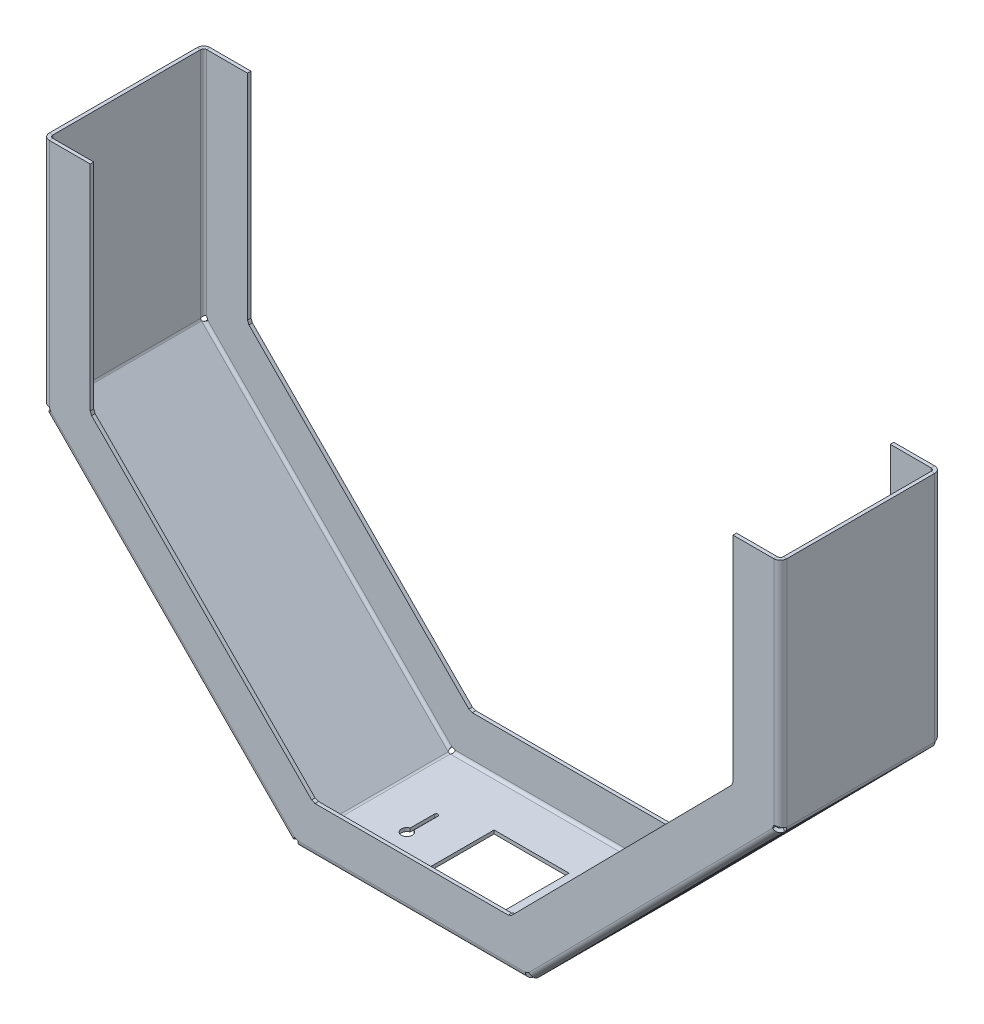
ISO-10303-21;
HEADER;
FILE_DESCRIPTION(('STEP AP214'),'2;1');
FILE_NAME('part.step','',(''),(''),'','','');
FILE_SCHEMA(('AUTOMOTIVE_DESIGN { 1 0 10303 214 1 1 1 1 }'));
ENDSEC;
DATA;
#1=APPLICATION_CONTEXT('core data for automotive mechanical design processes');
#2=APPLICATION_PROTOCOL_DEFINITION('international standard','automotive_design',2000,#1);
#3=PRODUCT_CONTEXT('',#1,'mechanical');
#4=PRODUCT('Part','Part','',(#3));
#5=PRODUCT_RELATED_PRODUCT_CATEGORY('part','',(#4));
#6=PRODUCT_DEFINITION_FORMATION('','',#4);
#7=PRODUCT_DEFINITION_CONTEXT('part definition',#1,'design');
#8=PRODUCT_DEFINITION('design','',#6,#7);
#9=PRODUCT_DEFINITION_SHAPE('','',#8);
#10=(LENGTH_UNIT() NAMED_UNIT(*) SI_UNIT(.MILLI.,.METRE.));
#11=(NAMED_UNIT(*) PLANE_ANGLE_UNIT() SI_UNIT($,.RADIAN.));
#12=(NAMED_UNIT(*) SI_UNIT($,.STERADIAN.) SOLID_ANGLE_UNIT());
#13=UNCERTAINTY_MEASURE_WITH_UNIT(LENGTH_MEASURE(1.E-05),#10,'distance_accuracy_value','');
#14=(GEOMETRIC_REPRESENTATION_CONTEXT(3) GLOBAL_UNCERTAINTY_ASSIGNED_CONTEXT((#13)) GLOBAL_UNIT_ASSIGNED_CONTEXT((#10,
#11,#12)) REPRESENTATION_CONTEXT('',''));
#15=CARTESIAN_POINT('',(0.,0.,0.));
#16=DIRECTION('',(0.,0.,1.));
#17=DIRECTION('',(1.,0.,0.));
#18=AXIS2_PLACEMENT_3D('',#15,#16,#17);
#19=CARTESIAN_POINT('',(421.999928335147,218.490614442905,139.7));
#20=DIRECTION('',(-1.,0.,0.));
#21=DIRECTION('',(0.,0.,1.));
#22=AXIS2_PLACEMENT_3D('',#19,#20,#21);
#23=PLANE('',#22);
#24=DIRECTION('',(0.,1.,0.));
#25=VECTOR('',#24,1.);
#26=CARTESIAN_POINT('',(421.999928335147,219.533380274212,5.57784));
#27=LINE('',#26,#25);
#28=CARTESIAN_POINT('',(421.999928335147,219.533380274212,5.57784));
#29=VERTEX_POINT('',#28);
#30=CARTESIAN_POINT('',(421.999928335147,421.690614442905,5.57784));
#31=VERTEX_POINT('',#30);
#32=EDGE_CURVE('E960',#29,#31,#27,.T.);
#33=ORIENTED_EDGE('',*,*,#32,.T.);
#34=DIRECTION('',(0.,0.,-1.));
#35=VECTOR('',#34,1.);
#36=CARTESIAN_POINT('',(421.999928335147,421.690614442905,139.7));
#37=LINE('',#36,#35);
#38=CARTESIAN_POINT('',(421.999928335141,421.690614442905,134.122160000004));
#39=VERTEX_POINT('',#38);
#40=EDGE_CURVE('E11',#39,#31,#37,.T.);
#41=ORIENTED_EDGE('',*,*,#40,.F.);
#42=DIRECTION('',(0.,1.,0.));
#43=VECTOR('',#42,1.);
#44=CARTESIAN_POINT('',(421.999928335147,219.533380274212,134.122160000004));
#45=LINE('',#44,#43);
#46=CARTESIAN_POINT('',(421.999928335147,219.533380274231,134.122160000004));
#47=VERTEX_POINT('',#46);
#48=EDGE_CURVE('E1217',#47,#39,#45,.T.);
#49=ORIENTED_EDGE('',*,*,#48,.F.);
#50=DIRECTION('',(0.,0.,-1.));
#51=VECTOR('',#50,1.);
#52=CARTESIAN_POINT('',(421.999928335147,219.533380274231,139.7));
#53=LINE('',#52,#51);
#54=EDGE_CURVE('E582',#47,#29,#53,.T.);
#55=ORIENTED_EDGE('',*,*,#54,.T.);
#56=EDGE_LOOP('',(#33,#41,#49,#55));
#57=FACE_BOUND('',#56,.T.);
#58=ADVANCED_FACE('F42',(#57),#23,.F.);
#59=CARTESIAN_POINT('',(418.962088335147,421.690614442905,139.7));
#60=DIRECTION('',(0.,1.,0.));
#61=DIRECTION('',(-1.,0.,0.));
#62=AXIS2_PLACEMENT_3D('',#59,#60,#61);
#63=PLANE('',#62);
#64=ORIENTED_EDGE('',*,*,#40,.T.);
#65=DIRECTION('',(-1.,0.,0.));
#66=VECTOR('',#65,1.);
#67=CARTESIAN_POINT('',(421.999928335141,421.690614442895,5.57784));
#68=LINE('',#67,#66);
#69=CARTESIAN_POINT('',(418.962088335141,421.690614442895,5.57784));
#70=VERTEX_POINT('',#69);
#71=EDGE_CURVE('E669',#31,#70,#68,.T.);
#72=ORIENTED_EDGE('',*,*,#71,.T.);
#73=DIRECTION('',(0.,0.,-1.));
#74=VECTOR('',#73,1.);
#75=CARTESIAN_POINT('',(418.962088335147,421.690614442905,139.7));
#76=LINE('',#75,#74);
#77=CARTESIAN_POINT('',(418.962088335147,421.690614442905,134.122160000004));
#78=VERTEX_POINT('',#77);
#79=EDGE_CURVE('E49',#78,#70,#76,.T.);
#80=ORIENTED_EDGE('',*,*,#79,.F.);
#81=DIRECTION('',(1.,0.,0.));
#82=VECTOR('',#81,1.);
#83=CARTESIAN_POINT('',(421.999928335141,421.690614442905,134.122160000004));
#84=LINE('',#83,#82);
#85=EDGE_CURVE('E666',#39,#78,#84,.F.);
#86=ORIENTED_EDGE('',*,*,#85,.F.);
#87=EDGE_LOOP('',(#64,#72,#80,#86));
#88=FACE_BOUND('',#87,.T.);
#89=ADVANCED_FACE('F664',(#88),#63,.T.);
#90=CARTESIAN_POINT('',(418.962088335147,218.490614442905,139.7));
#91=DIRECTION('',(-1.,0.,0.));
#92=DIRECTION('',(0.,0.,1.));
#93=AXIS2_PLACEMENT_3D('',#90,#91,#92);
#94=PLANE('',#93);
#95=ORIENTED_EDGE('',*,*,#79,.T.);
#96=DIRECTION('',(0.,1.,0.));
#97=VECTOR('',#96,1.);
#98=CARTESIAN_POINT('',(418.962088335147,219.533380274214,5.57784));
#99=LINE('',#98,#97);
#100=CARTESIAN_POINT('',(418.962088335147,219.533380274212,5.57784));
#101=VERTEX_POINT('',#100);
#102=EDGE_CURVE('E657',#101,#70,#99,.T.);
#103=ORIENTED_EDGE('',*,*,#102,.F.);
#104=DIRECTION('',(0.,0.,-1.));
#105=VECTOR('',#104,1.);
#106=CARTESIAN_POINT('',(418.962088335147,219.533380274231,139.7));
#107=LINE('',#106,#105);
#108=CARTESIAN_POINT('',(418.962088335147,219.533380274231,134.122160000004));
#109=VERTEX_POINT('',#108);
#110=EDGE_CURVE('E649',#109,#101,#107,.T.);
#111=ORIENTED_EDGE('',*,*,#110,.F.);
#112=DIRECTION('',(0.,1.,0.));
#113=VECTOR('',#112,1.);
#114=CARTESIAN_POINT('',(418.962088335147,219.533380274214,134.122160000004));
#115=LINE('',#114,#113);
#116=EDGE_CURVE('E659',#109,#78,#115,.T.);
#117=ORIENTED_EDGE('',*,*,#116,.T.);
#118=EDGE_LOOP('',(#95,#103,#111,#117));
#119=FACE_BOUND('',#118,.T.);
#120=ADVANCED_FACE('F655',(#119),#94,.T.);
#121=CARTESIAN_POINT('',(416.422088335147,219.533380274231,139.7));
#122=DIRECTION('',(0.,0.,-1.));
#123=DIRECTION('',(-1.,0.,0.));
#124=AXIS2_PLACEMENT_3D('',#121,#122,#123);
#125=CYLINDRICAL_SURFACE('',#124,2.54);
#126=ORIENTED_EDGE('',*,*,#110,.T.);
#127=CARTESIAN_POINT('',(416.422088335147,219.533380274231,5.57784));
#128=DIRECTION('',(0.,0.,-1.));
#129=DIRECTION('',(-1.,0.,0.));
#130=AXIS2_PLACEMENT_3D('',#127,#128,#129);
#131=CIRCLE('',#130,2.54);
#132=CARTESIAN_POINT('',(418.229388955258,217.748649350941,5.57784));
#133=VERTEX_POINT('',#132);
#134=EDGE_CURVE('E1194',#133,#101,#131,.F.);
#135=ORIENTED_EDGE('',*,*,#134,.F.);
#136=DIRECTION('',(0.,0.,-1.));
#137=VECTOR('',#136,1.);
#138=CARTESIAN_POINT('',(418.229388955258,217.748649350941,139.7));
#139=LINE('',#138,#137);
#140=CARTESIAN_POINT('',(418.229388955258,217.748649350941,134.122160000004));
#141=VERTEX_POINT('',#140);
#142=EDGE_CURVE('E646',#141,#133,#139,.T.);
#143=ORIENTED_EDGE('',*,*,#142,.F.);
#144=CARTESIAN_POINT('',(416.422088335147,219.533380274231,134.122160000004));
#145=DIRECTION('',(0.,0.,-1.));
#146=DIRECTION('',(-1.,0.,0.));
#147=AXIS2_PLACEMENT_3D('',#144,#145,#146);
#148=CIRCLE('',#147,2.54);
#149=EDGE_CURVE('E583',#141,#109,#148,.F.);
#150=ORIENTED_EDGE('',*,*,#149,.T.);
#151=EDGE_LOOP('',(#126,#135,#143,#150));
#152=FACE_BOUND('',#151,.T.);
#153=ADVANCED_FACE('F1246',(#152),#125,.F.);
#154=CARTESIAN_POINT('',(203.2,0.,139.7));
#155=DIRECTION('',(-0.711535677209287,0.702649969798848,0.));
#156=DIRECTION('',(-0.702649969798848,-0.711535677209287,0.));
#157=AXIS2_PLACEMENT_3D('',#154,#155,#156);
#158=PLANE('',#157);
#159=ORIENTED_EDGE('',*,*,#142,.T.);
#160=DIRECTION('',(0.702649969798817,0.711535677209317,0.));
#161=VECTOR('',#160,1.);
#162=CARTESIAN_POINT('',(203.945837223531,0.7552690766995,5.57784));
#163=LINE('',#162,#161);
#164=CARTESIAN_POINT('',(203.945837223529,0.755269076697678,5.57784));
#165=VERTEX_POINT('',#164);
#166=EDGE_CURVE('E1007',#165,#133,#163,.T.);
#167=ORIENTED_EDGE('',*,*,#166,.F.);
#168=DIRECTION('',(0.,0.,-1.));
#169=VECTOR('',#168,1.);
#170=CARTESIAN_POINT('',(203.945837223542,0.755269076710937,139.7));
#171=LINE('',#170,#169);
#172=CARTESIAN_POINT('',(203.945837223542,0.755269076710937,134.122160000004));
#173=VERTEX_POINT('',#172);
#174=EDGE_CURVE('E644',#173,#165,#171,.T.);
#175=ORIENTED_EDGE('',*,*,#174,.F.);
#176=DIRECTION('',(0.702649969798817,0.711535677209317,0.));
#177=VECTOR('',#176,1.);
#178=CARTESIAN_POINT('',(203.945837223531,0.7552690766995,134.122160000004));
#179=LINE('',#178,#177);
#180=EDGE_CURVE('E717',#173,#141,#179,.T.);
#181=ORIENTED_EDGE('',*,*,#180,.T.);
#182=EDGE_LOOP('',(#159,#167,#175,#181));
#183=FACE_BOUND('',#182,.T.);
#184=ADVANCED_FACE('F1376',(#183),#158,.T.);
#185=CARTESIAN_POINT('',(202.138536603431,2.54000000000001,139.7));
#186=DIRECTION('',(0.,0.,-1.));
#187=DIRECTION('',(-1.,0.,0.));
#188=AXIS2_PLACEMENT_3D('',#185,#186,#187);
#189=CYLINDRICAL_SURFACE('',#188,2.54);
#190=ORIENTED_EDGE('',*,*,#174,.T.);
#191=CARTESIAN_POINT('',(202.138536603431,2.54000000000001,5.57784));
#192=DIRECTION('',(0.,0.,-1.));
#193=DIRECTION('',(-1.,0.,0.));
#194=AXIS2_PLACEMENT_3D('',#191,#192,#193);
#195=CIRCLE('',#194,2.54);
#196=CARTESIAN_POINT('',(202.138536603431,0.,5.57784));
#197=VERTEX_POINT('',#196);
#198=EDGE_CURVE('E1199',#197,#165,#195,.F.);
#199=ORIENTED_EDGE('',*,*,#198,.F.);
#200=DIRECTION('',(0.,0.,-1.));
#201=VECTOR('',#200,1.);
#202=CARTESIAN_POINT('',(202.138536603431,0.,139.7));
#203=LINE('',#202,#201);
#204=CARTESIAN_POINT('',(202.138536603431,0.,134.122160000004));
#205=VERTEX_POINT('',#204);
#206=EDGE_CURVE('E641',#205,#197,#203,.T.);
#207=ORIENTED_EDGE('',*,*,#206,.F.);
#208=CARTESIAN_POINT('',(202.138536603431,2.54000000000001,134.122160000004));
#209=DIRECTION('',(0.,0.,-1.));
#210=DIRECTION('',(-1.,0.,0.));
#211=AXIS2_PLACEMENT_3D('',#208,#209,#210);
#212=CIRCLE('',#211,2.54);
#213=EDGE_CURVE('E587',#205,#173,#212,.F.);
#214=ORIENTED_EDGE('',*,*,#213,.T.);
#215=EDGE_LOOP('',(#190,#199,#207,#214));
#216=FACE_BOUND('',#215,.T.);
#217=ADVANCED_FACE('F1373',(#216),#189,.F.);
#218=CARTESIAN_POINT('',(0.,0.,139.7));
#219=DIRECTION('',(0.,1.,0.));
#220=DIRECTION('',(0.,0.,1.));
#221=AXIS2_PLACEMENT_3D('',#218,#219,#220);
#222=PLANE('',#221);
#223=CARTESIAN_POINT('',(170.3826876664,0.,57.8523494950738));
#224=DIRECTION('',(0.,1.,0.));
#225=DIRECTION('',(0.,0.,1.));
#226=AXIS2_PLACEMENT_3D('',#223,#224,#225);
#227=CIRCLE('',#226,1.58749999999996);
#228=CARTESIAN_POINT('',(171.9701876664,0.,57.8523494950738));
#229=VERTEX_POINT('',#228);
#230=CARTESIAN_POINT('',(168.7951876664,0.,57.8523494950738));
#231=VERTEX_POINT('',#230);
#232=EDGE_CURVE('E899',#229,#231,#227,.T.);
#233=ORIENTED_EDGE('',*,*,#232,.F.);
#234=DIRECTION('',(0.,0.,-1.));
#235=VECTOR('',#234,1.);
#236=CARTESIAN_POINT('',(171.9701876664,0.,139.7));
#237=LINE('',#236,#235);
#238=CARTESIAN_POINT('',(171.9701876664,0.,78.7622214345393));
#239=VERTEX_POINT('',#238);
#240=EDGE_CURVE('E888',#239,#229,#237,.T.);
#241=ORIENTED_EDGE('',*,*,#240,.F.);
#242=CARTESIAN_POINT('',(170.3826876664,0.,83.2523494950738));
#243=DIRECTION('',(0.,1.,0.));
#244=DIRECTION('',(0.,0.,1.));
#245=AXIS2_PLACEMENT_3D('',#242,#243,#244);
#246=CIRCLE('',#245,4.7625);
#247=CARTESIAN_POINT('',(168.7951876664,0.,78.7622214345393));
#248=VERTEX_POINT('',#247);
#249=EDGE_CURVE('E894',#248,#239,#246,.T.);
#250=ORIENTED_EDGE('',*,*,#249,.F.);
#251=DIRECTION('',(0.,0.,-1.));
#252=VECTOR('',#251,1.);
#253=CARTESIAN_POINT('',(168.7951876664,0.,139.7));
#254=LINE('',#253,#252);
#255=EDGE_CURVE('E896',#248,#231,#254,.T.);
#256=ORIENTED_EDGE('',*,*,#255,.T.);
#257=EDGE_LOOP('',(#233,#241,#250,#256));
#258=FACE_BOUND('',#257,.T.);
#259=CARTESIAN_POINT('',(40.9435563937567,0.,57.7501680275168));
#260=DIRECTION('',(0.,1.,0.));
#261=DIRECTION('',(0.,0.,1.));
#262=AXIS2_PLACEMENT_3D('',#259,#260,#261);
#263=CIRCLE('',#262,1.58750000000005);
#264=CARTESIAN_POINT('',(42.5310563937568,0.,57.7501680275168));
#265=VERTEX_POINT('',#264);
#266=CARTESIAN_POINT('',(39.3560563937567,0.,57.7501680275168));
#267=VERTEX_POINT('',#266);
#268=EDGE_CURVE('E929',#265,#267,#263,.T.);
#269=ORIENTED_EDGE('',*,*,#268,.F.);
#270=DIRECTION('',(0.,0.,-1.));
#271=VECTOR('',#270,1.);
#272=CARTESIAN_POINT('',(42.5310563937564,0.,139.7));
#273=LINE('',#272,#271);
#274=CARTESIAN_POINT('',(42.5310563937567,0.,78.6600399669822));
#275=VERTEX_POINT('',#274);
#276=EDGE_CURVE('E915',#275,#265,#273,.T.);
#277=ORIENTED_EDGE('',*,*,#276,.F.);
#278=CARTESIAN_POINT('',(40.9435563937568,0.,83.1501680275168));
#279=DIRECTION('',(0.,1.,0.));
#280=DIRECTION('',(0.,0.,1.));
#281=AXIS2_PLACEMENT_3D('',#278,#279,#280);
#282=CIRCLE('',#281,4.76249999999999);
#283=CARTESIAN_POINT('',(39.3560563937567,0.,78.6600399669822));
#284=VERTEX_POINT('',#283);
#285=EDGE_CURVE('E923',#284,#275,#282,.T.);
#286=ORIENTED_EDGE('',*,*,#285,.F.);
#287=DIRECTION('',(0.,0.,-1.));
#288=VECTOR('',#287,1.);
#289=CARTESIAN_POINT('',(39.3560563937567,0.,139.7));
#290=LINE('',#289,#288);
#291=EDGE_CURVE('E926',#284,#267,#290,.T.);
#292=ORIENTED_EDGE('',*,*,#291,.T.);
#293=EDGE_LOOP('',(#269,#277,#286,#292));
#294=FACE_BOUND('',#293,.T.);
#295=DIRECTION('',(0.,0.,1.));
#296=VECTOR('',#295,1.);
#297=CARTESIAN_POINT('',(77.261463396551,0.,139.7));
#298=LINE('',#297,#296);
#299=CARTESIAN_POINT('',(77.261463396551,0.,43.67784));
#300=VERTEX_POINT('',#299);
#301=CARTESIAN_POINT('',(77.261463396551,0.,108.77804));
#302=VERTEX_POINT('',#301);
#303=EDGE_CURVE('E958',#300,#302,#298,.T.);
#304=ORIENTED_EDGE('',*,*,#303,.F.);
#305=DIRECTION('',(-1.,0.,0.));
#306=VECTOR('',#305,1.);
#307=CARTESIAN_POINT('',(0.,0.,43.67784));
#308=LINE('',#307,#306);
#309=CARTESIAN_POINT('',(142.361663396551,0.,43.67784));
#310=VERTEX_POINT('',#309);
#311=EDGE_CURVE('E945',#310,#300,#308,.T.);
#312=ORIENTED_EDGE('',*,*,#311,.F.);
#313=DIRECTION('',(0.,0.,-1.));
#314=VECTOR('',#313,1.);
#315=CARTESIAN_POINT('',(142.361663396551,0.,139.7));
#316=LINE('',#315,#314);
#317=CARTESIAN_POINT('',(142.361663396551,0.,108.77804));
#318=VERTEX_POINT('',#317);
#319=EDGE_CURVE('E953',#318,#310,#316,.T.);
#320=ORIENTED_EDGE('',*,*,#319,.F.);
#321=DIRECTION('',(1.,0.,0.));
#322=VECTOR('',#321,1.);
#323=CARTESIAN_POINT('',(0.,0.,108.77804));
#324=LINE('',#323,#322);
#325=EDGE_CURVE('E956',#302,#318,#324,.T.);
#326=ORIENTED_EDGE('',*,*,#325,.F.);
#327=EDGE_LOOP('',(#304,#312,#320,#326));
#328=FACE_BOUND('',#327,.T.);
#329=ORIENTED_EDGE('',*,*,#206,.T.);
#330=DIRECTION('',(1.,0.,0.));
#331=VECTOR('',#330,1.);
#332=CARTESIAN_POINT('',(1.06146339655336,0.,5.57784));
#333=LINE('',#332,#331);
#334=CARTESIAN_POINT('',(1.06146339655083,0.,5.57784));
#335=VERTEX_POINT('',#334);
#336=EDGE_CURVE('E1053',#335,#197,#333,.T.);
#337=ORIENTED_EDGE('',*,*,#336,.F.);
#338=DIRECTION('',(0.,0.,-1.));
#339=VECTOR('',#338,1.);
#340=CARTESIAN_POINT('',(1.06146339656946,0.,139.7));
#341=LINE('',#340,#339);
#342=CARTESIAN_POINT('',(1.06146339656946,0.,134.122160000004));
#343=VERTEX_POINT('',#342);
#344=EDGE_CURVE('E639',#343,#335,#341,.T.);
#345=ORIENTED_EDGE('',*,*,#344,.F.);
#346=DIRECTION('',(1.,0.,0.));
#347=VECTOR('',#346,1.);
#348=CARTESIAN_POINT('',(1.06146339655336,0.,134.122160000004));
#349=LINE('',#348,#347);
#350=EDGE_CURVE('E761',#343,#205,#349,.T.);
#351=ORIENTED_EDGE('',*,*,#350,.T.);
#352=EDGE_LOOP('',(#329,#337,#345,#351));
#353=FACE_BOUND('',#352,.T.);
#354=ADVANCED_FACE('F1297',(#258,#294,#328,#353),#222,.T.);
#355=CARTESIAN_POINT('',(1.06146339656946,2.54,139.7));
#356=DIRECTION('',(0.,0.,-1.));
#357=DIRECTION('',(-1.,0.,0.));
#358=AXIS2_PLACEMENT_3D('',#355,#356,#357);
#359=CYLINDRICAL_SURFACE('',#358,2.54);
#360=ORIENTED_EDGE('',*,*,#344,.T.);
#361=CARTESIAN_POINT('',(1.06146339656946,2.54,5.57784));
#362=DIRECTION('',(0.,0.,-1.));
#363=DIRECTION('',(-1.,0.,0.));
#364=AXIS2_PLACEMENT_3D('',#361,#362,#363);
#365=CIRCLE('',#364,2.54);
#366=CARTESIAN_POINT('',(-0.745837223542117,0.755269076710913,5.57784));
#367=VERTEX_POINT('',#366);
#368=EDGE_CURVE('E1203',#367,#335,#365,.F.);
#369=ORIENTED_EDGE('',*,*,#368,.F.);
#370=DIRECTION('',(0.,0.,-1.));
#371=VECTOR('',#370,1.);
#372=CARTESIAN_POINT('',(-0.745837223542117,0.755269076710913,139.7));
#373=LINE('',#372,#371);
#374=CARTESIAN_POINT('',(-0.745837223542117,0.755269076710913,134.122160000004));
#375=VERTEX_POINT('',#374);
#376=EDGE_CURVE('E636',#375,#367,#373,.T.);
#377=ORIENTED_EDGE('',*,*,#376,.F.);
#378=CARTESIAN_POINT('',(1.06146339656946,2.54,134.122160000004));
#379=DIRECTION('',(0.,0.,-1.));
#380=DIRECTION('',(-1.,0.,0.));
#381=AXIS2_PLACEMENT_3D('',#378,#379,#380);
#382=CIRCLE('',#381,2.54);
#383=EDGE_CURVE('E591',#375,#343,#382,.F.);
#384=ORIENTED_EDGE('',*,*,#383,.T.);
#385=EDGE_LOOP('',(#360,#369,#377,#384));
#386=FACE_BOUND('',#385,.T.);
#387=ADVANCED_FACE('F1414',(#386),#359,.F.);
#388=CARTESIAN_POINT('',(0.,0.,139.7));
#389=DIRECTION('',(0.711535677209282,0.702649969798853,0.));
#390=DIRECTION('',(-0.702649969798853,0.711535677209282,0.));
#391=AXIS2_PLACEMENT_3D('',#388,#389,#390);
#392=PLANE('',#391);
#393=ORIENTED_EDGE('',*,*,#376,.T.);
#394=DIRECTION('',(0.702649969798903,-0.711535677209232,0.));
#395=VECTOR('',#394,1.);
#396=CARTESIAN_POINT('',(-215.029388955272,217.748649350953,5.57784));
#397=LINE('',#396,#395);
#398=CARTESIAN_POINT('',(-215.029388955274,217.748649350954,5.57784));
#399=VERTEX_POINT('',#398);
#400=EDGE_CURVE('E1099',#399,#367,#397,.T.);
#401=ORIENTED_EDGE('',*,*,#400,.F.);
#402=DIRECTION('',(0.,0.,-1.));
#403=VECTOR('',#402,1.);
#404=CARTESIAN_POINT('',(-215.029388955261,217.748649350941,139.7));
#405=LINE('',#404,#403);
#406=CARTESIAN_POINT('',(-215.029388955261,217.748649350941,134.122160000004));
#407=VERTEX_POINT('',#406);
#408=EDGE_CURVE('E634',#407,#399,#405,.T.);
#409=ORIENTED_EDGE('',*,*,#408,.F.);
#410=DIRECTION('',(0.702649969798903,-0.711535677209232,0.));
#411=VECTOR('',#410,1.);
#412=CARTESIAN_POINT('',(-215.029388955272,217.748649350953,134.122160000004));
#413=LINE('',#412,#411);
#414=EDGE_CURVE('E805',#407,#375,#413,.T.);
#415=ORIENTED_EDGE('',*,*,#414,.T.);
#416=EDGE_LOOP('',(#393,#401,#409,#415));
#417=FACE_BOUND('',#416,.T.);
#418=ADVANCED_FACE('F1418',(#417),#392,.T.);
#419=CARTESIAN_POINT('',(-2.16153154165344,-2.13453818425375,139.7));
#420=DIRECTION('',(0.711535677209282,0.702649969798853,0.));
#421=DIRECTION('',(-0.702649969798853,0.711535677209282,0.));
#422=AXIS2_PLACEMENT_3D('',#419,#420,#421);
#423=PLANE('',#422);
#424=DIRECTION('',(0.702649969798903,-0.711535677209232,0.));
#425=VECTOR('',#424,1.);
#426=CARTESIAN_POINT('',(-217.190920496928,215.614111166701,5.57784));
#427=LINE('',#426,#425);
#428=CARTESIAN_POINT('',(-217.190920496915,215.614111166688,5.57784));
#429=VERTEX_POINT('',#428);
#430=CARTESIAN_POINT('',(-2.90736876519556,-1.37926910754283,5.57784));
#431=VERTEX_POINT('',#430);
#432=EDGE_CURVE('E1096',#429,#431,#427,.T.);
#433=ORIENTED_EDGE('',*,*,#432,.T.);
#434=DIRECTION('',(0.,0.,-1.));
#435=VECTOR('',#434,1.);
#436=CARTESIAN_POINT('',(-2.90736876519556,-1.37926910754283,139.7));
#437=LINE('',#436,#435);
#438=CARTESIAN_POINT('',(-2.90736876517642,-1.37926910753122,134.122160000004));
#439=VERTEX_POINT('',#438);
#440=EDGE_CURVE('E616',#439,#431,#437,.T.);
#441=ORIENTED_EDGE('',*,*,#440,.F.);
#442=DIRECTION('',(0.702649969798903,-0.711535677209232,0.));
#443=VECTOR('',#442,1.);
#444=CARTESIAN_POINT('',(-217.190920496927,215.614111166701,134.122160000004));
#445=LINE('',#444,#443);
#446=CARTESIAN_POINT('',(-217.190920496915,215.614111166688,134.122160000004));
#447=VERTEX_POINT('',#446);
#448=EDGE_CURVE('E802',#447,#439,#445,.T.);
#449=ORIENTED_EDGE('',*,*,#448,.F.);
#450=DIRECTION('',(0.,0.,-1.));
#451=VECTOR('',#450,1.);
#452=CARTESIAN_POINT('',(-217.190920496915,215.614111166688,139.7));
#453=LINE('',#452,#451);
#454=EDGE_CURVE('E619',#447,#429,#453,.T.);
#455=ORIENTED_EDGE('',*,*,#454,.T.);
#456=EDGE_LOOP('',(#433,#441,#449,#455));
#457=FACE_BOUND('',#456,.T.);
#458=ADVANCED_FACE('F1421',(#457),#423,.F.);
#459=CARTESIAN_POINT('',(1.06146339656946,2.54,139.7));
#460=DIRECTION('',(0.,0.,-1.));
#461=DIRECTION('',(-1.,0.,0.));
#462=AXIS2_PLACEMENT_3D('',#459,#460,#461);
#463=CYLINDRICAL_SURFACE('',#462,5.57784);
#464=CARTESIAN_POINT('',(1.06146339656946,2.54,5.57784));
#465=DIRECTION('',(0.,0.,1.));
#466=DIRECTION('',(1.,0.,0.));
#467=AXIS2_PLACEMENT_3D('',#464,#465,#466);
#468=CIRCLE('',#467,5.57784);
#469=CARTESIAN_POINT('',(1.06146339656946,-3.03784,5.57784));
#470=VERTEX_POINT('',#469);
#471=EDGE_CURVE('E1202',#431,#470,#468,.T.);
#472=ORIENTED_EDGE('',*,*,#471,.T.);
#473=DIRECTION('',(0.,0.,-1.));
#474=VECTOR('',#473,1.);
#475=CARTESIAN_POINT('',(1.06146339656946,-3.03784,139.7));
#476=LINE('',#475,#474);
#477=CARTESIAN_POINT('',(1.061463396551,-3.03784000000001,134.122160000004));
#478=VERTEX_POINT('',#477);
#479=EDGE_CURVE('E613',#478,#470,#476,.T.);
#480=ORIENTED_EDGE('',*,*,#479,.F.);
#481=CARTESIAN_POINT('',(1.06146339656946,2.54,134.122160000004));
#482=DIRECTION('',(0.,0.,1.));
#483=DIRECTION('',(1.,0.,0.));
#484=AXIS2_PLACEMENT_3D('',#481,#482,#483);
#485=CIRCLE('',#484,5.57784);
#486=EDGE_CURVE('E588',#439,#478,#485,.T.);
#487=ORIENTED_EDGE('',*,*,#486,.F.);
#488=ORIENTED_EDGE('',*,*,#440,.T.);
#489=EDGE_LOOP('',(#472,#480,#487,#488));
#490=FACE_BOUND('',#489,.T.);
#491=ADVANCED_FACE('F1394',(#490),#463,.T.);
#492=CARTESIAN_POINT('',(0.,-3.03784,139.7));
#493=DIRECTION('',(0.,1.,0.));
#494=DIRECTION('',(0.,0.,1.));
#495=AXIS2_PLACEMENT_3D('',#492,#493,#494);
#496=PLANE('',#495);
#497=DIRECTION('',(0.,0.,1.));
#498=VECTOR('',#497,1.);
#499=CARTESIAN_POINT('',(171.9701876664,-3.03783999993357,57.8523494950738));
#500=LINE('',#499,#498);
#501=CARTESIAN_POINT('',(171.9701876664,-3.03784,57.8523494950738));
#502=VERTEX_POINT('',#501);
#503=CARTESIAN_POINT('',(171.9701876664,-3.03783999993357,78.7622214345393));
#504=VERTEX_POINT('',#503);
#505=EDGE_CURVE('E877',#502,#504,#500,.T.);
#506=ORIENTED_EDGE('',*,*,#505,.F.);
#507=CARTESIAN_POINT('',(170.3826876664,-3.03783999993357,57.8523494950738));
#508=DIRECTION('',(0.,-1.,0.));
#509=DIRECTION('',(0.,0.,-1.));
#510=AXIS2_PLACEMENT_3D('',#507,#508,#509);
#511=CIRCLE('',#510,1.58749999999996);
#512=CARTESIAN_POINT('',(168.7951876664,-3.03783999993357,57.8523494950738));
#513=VERTEX_POINT('',#512);
#514=EDGE_CURVE('E64',#513,#502,#511,.T.);
#515=ORIENTED_EDGE('',*,*,#514,.F.);
#516=DIRECTION('',(0.,0.,1.));
#517=VECTOR('',#516,1.);
#518=CARTESIAN_POINT('',(168.7951876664,-3.03783999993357,57.8523494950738));
#519=LINE('',#518,#517);
#520=CARTESIAN_POINT('',(168.7951876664,-3.03783999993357,78.7622214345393));
#521=VERTEX_POINT('',#520);
#522=EDGE_CURVE('E882',#513,#521,#519,.T.);
#523=ORIENTED_EDGE('',*,*,#522,.T.);
#524=CARTESIAN_POINT('',(170.3826876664,-3.03783999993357,83.2523494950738));
#525=DIRECTION('',(0.,-1.,0.));
#526=DIRECTION('',(0.,0.,-1.));
#527=AXIS2_PLACEMENT_3D('',#524,#525,#526);
#528=CIRCLE('',#527,4.7625);
#529=EDGE_CURVE('E879',#504,#521,#528,.T.);
#530=ORIENTED_EDGE('',*,*,#529,.F.);
#531=EDGE_LOOP('',(#506,#515,#523,#530));
#532=FACE_BOUND('',#531,.T.);
#533=DIRECTION('',(0.,0.,1.));
#534=VECTOR('',#533,1.);
#535=CARTESIAN_POINT('',(42.5310563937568,-3.03783999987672,57.7501680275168));
#536=LINE('',#535,#534);
#537=CARTESIAN_POINT('',(42.5310563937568,-3.03784,57.7501680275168));
#538=VERTEX_POINT('',#537);
#539=CARTESIAN_POINT('',(42.5310563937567,-3.03783999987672,78.6600399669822));
#540=VERTEX_POINT('',#539);
#541=EDGE_CURVE('E903',#538,#540,#536,.T.);
#542=ORIENTED_EDGE('',*,*,#541,.F.);
#543=CARTESIAN_POINT('',(40.9435563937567,-3.03783999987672,57.7501680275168));
#544=DIRECTION('',(0.,-1.,0.));
#545=DIRECTION('',(0.,0.,-1.));
#546=AXIS2_PLACEMENT_3D('',#543,#544,#545);
#547=CIRCLE('',#546,1.58750000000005);
#548=CARTESIAN_POINT('',(39.3560563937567,-3.03783999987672,57.7501680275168));
#549=VERTEX_POINT('',#548);
#550=EDGE_CURVE('E901',#549,#538,#547,.T.);
#551=ORIENTED_EDGE('',*,*,#550,.F.);
#552=DIRECTION('',(0.,0.,1.));
#553=VECTOR('',#552,1.);
#554=CARTESIAN_POINT('',(39.3560563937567,-3.03783999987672,57.7501680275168));
#555=LINE('',#554,#553);
#556=CARTESIAN_POINT('',(39.3560563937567,-3.03783999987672,78.6600399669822));
#557=VERTEX_POINT('',#556);
#558=EDGE_CURVE('E909',#549,#557,#555,.T.);
#559=ORIENTED_EDGE('',*,*,#558,.T.);
#560=CARTESIAN_POINT('',(40.9435563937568,-3.03783999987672,83.1501680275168));
#561=DIRECTION('',(0.,-1.,0.));
#562=DIRECTION('',(0.,0.,-1.));
#563=AXIS2_PLACEMENT_3D('',#560,#561,#562);
#564=CIRCLE('',#563,4.76249999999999);
#565=EDGE_CURVE('E906',#540,#557,#564,.T.);
#566=ORIENTED_EDGE('',*,*,#565,.F.);
#567=EDGE_LOOP('',(#542,#551,#559,#566));
#568=FACE_BOUND('',#567,.T.);
#569=DIRECTION('',(1.,0.,0.));
#570=VECTOR('',#569,1.);
#571=CARTESIAN_POINT('',(77.261463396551,-3.03784,43.67784));
#572=LINE('',#571,#570);
#573=CARTESIAN_POINT('',(77.261463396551,-3.03784,43.67784));
#574=VERTEX_POINT('',#573);
#575=CARTESIAN_POINT('',(142.361663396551,-3.03784,43.67784));
#576=VERTEX_POINT('',#575);
#577=EDGE_CURVE('E933',#574,#576,#572,.T.);
#578=ORIENTED_EDGE('',*,*,#577,.F.);
#579=DIRECTION('',(0.,0.,-1.));
#580=VECTOR('',#579,1.);
#581=CARTESIAN_POINT('',(77.261463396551,-3.03784,108.77804));
#582=LINE('',#581,#580);
#583=CARTESIAN_POINT('',(77.261463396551,-3.03784,108.77804));
#584=VERTEX_POINT('',#583);
#585=EDGE_CURVE('E931',#584,#574,#582,.T.);
#586=ORIENTED_EDGE('',*,*,#585,.F.);
#587=DIRECTION('',(-1.,0.,0.));
#588=VECTOR('',#587,1.);
#589=CARTESIAN_POINT('',(77.261463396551,-3.03784,108.77804));
#590=LINE('',#589,#588);
#591=CARTESIAN_POINT('',(142.361663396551,-3.03784,108.77804));
#592=VERTEX_POINT('',#591);
#593=EDGE_CURVE('E939',#592,#584,#590,.T.);
#594=ORIENTED_EDGE('',*,*,#593,.F.);
#595=DIRECTION('',(0.,0.,1.));
#596=VECTOR('',#595,1.);
#597=CARTESIAN_POINT('',(142.361663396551,-3.03784,108.77804));
#598=LINE('',#597,#596);
#599=EDGE_CURVE('E936',#576,#592,#598,.T.);
#600=ORIENTED_EDGE('',*,*,#599,.F.);
#601=EDGE_LOOP('',(#578,#586,#594,#600));
#602=FACE_BOUND('',#601,.T.);
#603=DIRECTION('',(1.,0.,0.));
#604=VECTOR('',#603,1.);
#605=CARTESIAN_POINT('',(1.061463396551,-3.03784000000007,5.57784));
#606=LINE('',#605,#604);
#607=CARTESIAN_POINT('',(202.138536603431,-3.03783999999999,5.57784));
#608=VERTEX_POINT('',#607);
#609=EDGE_CURVE('E1050',#470,#608,#606,.T.);
#610=ORIENTED_EDGE('',*,*,#609,.T.);
#611=DIRECTION('',(0.,0.,-1.));
#612=VECTOR('',#611,1.);
#613=CARTESIAN_POINT('',(202.138536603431,-3.03783999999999,139.7));
#614=LINE('',#613,#612);
#615=CARTESIAN_POINT('',(202.138536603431,-3.03783999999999,134.122160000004));
#616=VERTEX_POINT('',#615);
#617=EDGE_CURVE('E610',#616,#608,#614,.T.);
#618=ORIENTED_EDGE('',*,*,#617,.F.);
#619=DIRECTION('',(1.,0.,0.));
#620=VECTOR('',#619,1.);
#621=CARTESIAN_POINT('',(1.061463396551,-3.03784000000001,134.122160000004));
#622=LINE('',#621,#620);
#623=EDGE_CURVE('E758',#478,#616,#622,.T.);
#624=ORIENTED_EDGE('',*,*,#623,.F.);
#625=ORIENTED_EDGE('',*,*,#479,.T.);
#626=EDGE_LOOP('',(#610,#618,#624,#625));
#627=FACE_BOUND('',#626,.T.);
#628=ADVANCED_FACE('F1383',(#532,#568,#602,#627),#496,.F.);
#629=CARTESIAN_POINT('',(202.138536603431,2.54000000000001,139.7));
#630=DIRECTION('',(0.,0.,-1.));
#631=DIRECTION('',(-1.,0.,0.));
#632=AXIS2_PLACEMENT_3D('',#629,#630,#631);
#633=CYLINDRICAL_SURFACE('',#632,5.57784);
#634=CARTESIAN_POINT('',(202.138536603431,2.54000000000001,5.57784));
#635=DIRECTION('',(0.,0.,1.));
#636=DIRECTION('',(1.,0.,0.));
#637=AXIS2_PLACEMENT_3D('',#634,#635,#636);
#638=CIRCLE('',#637,5.57784);
#639=CARTESIAN_POINT('',(206.107368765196,-1.37926910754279,5.57784));
#640=VERTEX_POINT('',#639);
#641=EDGE_CURVE('E1198',#608,#640,#638,.T.);
#642=ORIENTED_EDGE('',*,*,#641,.T.);
#643=DIRECTION('',(0.,0.,-1.));
#644=VECTOR('',#643,1.);
#645=CARTESIAN_POINT('',(206.107368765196,-1.37926910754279,139.7));
#646=LINE('',#645,#644);
#647=CARTESIAN_POINT('',(206.107368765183,-1.37926910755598,134.122160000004));
#648=VERTEX_POINT('',#647);
#649=EDGE_CURVE('E607',#648,#640,#646,.T.);
#650=ORIENTED_EDGE('',*,*,#649,.F.);
#651=CARTESIAN_POINT('',(202.138536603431,2.54000000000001,134.122160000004));
#652=DIRECTION('',(0.,0.,1.));
#653=DIRECTION('',(1.,0.,0.));
#654=AXIS2_PLACEMENT_3D('',#651,#652,#653);
#655=CIRCLE('',#654,5.57784);
#656=EDGE_CURVE('E584',#616,#648,#655,.T.);
#657=ORIENTED_EDGE('',*,*,#656,.F.);
#658=ORIENTED_EDGE('',*,*,#617,.T.);
#659=EDGE_LOOP('',(#642,#650,#657,#658));
#660=FACE_BOUND('',#659,.T.);
#661=ADVANCED_FACE('F1386',(#660),#633,.T.);
#662=CARTESIAN_POINT('',(205.361531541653,-2.13453818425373,139.7));
#663=DIRECTION('',(-0.711535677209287,0.702649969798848,0.));
#664=DIRECTION('',(-0.702649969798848,-0.711535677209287,0.));
#665=AXIS2_PLACEMENT_3D('',#662,#663,#664);
#666=PLANE('',#665);
#667=DIRECTION('',(0.702649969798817,0.711535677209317,0.));
#668=VECTOR('',#667,1.);
#669=CARTESIAN_POINT('',(206.107368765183,-1.37926910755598,5.57784));
#670=LINE('',#669,#668);
#671=CARTESIAN_POINT('',(420.390920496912,215.614111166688,5.57784));
#672=VERTEX_POINT('',#671);
#673=EDGE_CURVE('E1005',#640,#672,#670,.T.);
#674=ORIENTED_EDGE('',*,*,#673,.T.);
#675=DIRECTION('',(0.,0.,-1.));
#676=VECTOR('',#675,1.);
#677=CARTESIAN_POINT('',(420.390920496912,215.614111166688,139.7));
#678=LINE('',#677,#676);
#679=CARTESIAN_POINT('',(420.390920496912,215.614111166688,134.122160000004));
#680=VERTEX_POINT('',#679);
#681=EDGE_CURVE('E604',#680,#672,#678,.T.);
#682=ORIENTED_EDGE('',*,*,#681,.F.);
#683=DIRECTION('',(0.702649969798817,0.711535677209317,0.));
#684=VECTOR('',#683,1.);
#685=CARTESIAN_POINT('',(206.107368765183,-1.37926910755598,134.122160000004));
#686=LINE('',#685,#684);
#687=EDGE_CURVE('E715',#648,#680,#686,.T.);
#688=ORIENTED_EDGE('',*,*,#687,.F.);
#689=ORIENTED_EDGE('',*,*,#649,.T.);
#690=EDGE_LOOP('',(#674,#682,#688,#689));
#691=FACE_BOUND('',#690,.T.);
#692=ADVANCED_FACE('F1267',(#691),#666,.F.);
#693=CARTESIAN_POINT('',(416.422088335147,219.533380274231,139.7));
#694=DIRECTION('',(0.,0.,-1.));
#695=DIRECTION('',(-1.,0.,0.));
#696=AXIS2_PLACEMENT_3D('',#693,#694,#695);
#697=CYLINDRICAL_SURFACE('',#696,5.57784);
#698=CARTESIAN_POINT('',(416.422088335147,219.533380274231,5.57784));
#699=DIRECTION('',(0.,0.,1.));
#700=DIRECTION('',(1.,0.,0.));
#701=AXIS2_PLACEMENT_3D('',#698,#699,#700);
#702=CIRCLE('',#701,5.57784);
#703=EDGE_CURVE('E1197',#672,#29,#702,.T.);
#704=ORIENTED_EDGE('',*,*,#703,.T.);
#705=ORIENTED_EDGE('',*,*,#54,.F.);
#706=CARTESIAN_POINT('',(416.422088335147,219.533380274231,134.122160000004));
#707=DIRECTION('',(0.,0.,1.));
#708=DIRECTION('',(1.,0.,0.));
#709=AXIS2_PLACEMENT_3D('',#706,#707,#708);
#710=CIRCLE('',#709,5.57784);
#711=EDGE_CURVE('E580',#680,#47,#710,.T.);
#712=ORIENTED_EDGE('',*,*,#711,.F.);
#713=ORIENTED_EDGE('',*,*,#681,.T.);
#714=EDGE_LOOP('',(#704,#705,#712,#713));
#715=FACE_BOUND('',#714,.T.);
#716=ADVANCED_FACE('F1263',(#715),#697,.T.);
#717=CARTESIAN_POINT('',(-213.22208833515,219.53338027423,139.7));
#718=DIRECTION('',(0.,0.,-1.));
#719=DIRECTION('',(-1.,0.,0.));
#720=AXIS2_PLACEMENT_3D('',#717,#718,#719);
#721=CYLINDRICAL_SURFACE('',#720,2.54);
#722=ORIENTED_EDGE('',*,*,#408,.T.);
#723=CARTESIAN_POINT('',(-213.22208833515,219.53338027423,5.57784));
#724=DIRECTION('',(0.,0.,-1.));
#725=DIRECTION('',(-1.,0.,0.));
#726=AXIS2_PLACEMENT_3D('',#723,#724,#725);
#727=CIRCLE('',#726,2.54);
#728=CARTESIAN_POINT('',(-215.76208833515,219.533380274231,5.57784));
#729=VERTEX_POINT('',#728);
#730=EDGE_CURVE('E1191',#729,#399,#727,.F.);
#731=ORIENTED_EDGE('',*,*,#730,.F.);
#732=DIRECTION('',(0.,0.,-1.));
#733=VECTOR('',#732,1.);
#734=CARTESIAN_POINT('',(-215.76208833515,219.53338027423,139.7));
#735=LINE('',#734,#733);
#736=CARTESIAN_POINT('',(-215.76208833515,219.53338027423,134.122160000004));
#737=VERTEX_POINT('',#736);
#738=EDGE_CURVE('E631',#737,#729,#735,.T.);
#739=ORIENTED_EDGE('',*,*,#738,.F.);
#740=CARTESIAN_POINT('',(-213.22208833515,219.53338027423,134.122160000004));
#741=DIRECTION('',(0.,0.,-1.));
#742=DIRECTION('',(-1.,0.,0.));
#743=AXIS2_PLACEMENT_3D('',#740,#741,#742);
#744=CIRCLE('',#743,2.54);
#745=EDGE_CURVE('E577',#737,#407,#744,.F.);
#746=ORIENTED_EDGE('',*,*,#745,.T.);
#747=EDGE_LOOP('',(#722,#731,#739,#746));
#748=FACE_BOUND('',#747,.T.);
#749=ADVANCED_FACE('F1423',(#748),#721,.F.);
#750=CARTESIAN_POINT('',(-215.76208833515,218.490614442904,139.7));
#751=DIRECTION('',(1.,0.,0.));
#752=DIRECTION('',(0.,0.,-1.));
#753=AXIS2_PLACEMENT_3D('',#750,#751,#752);
#754=PLANE('',#753);
#755=ORIENTED_EDGE('',*,*,#738,.T.);
#756=DIRECTION('',(0.,-1.,0.));
#757=VECTOR('',#756,1.);
#758=CARTESIAN_POINT('',(-215.76208833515,1946.51492912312,5.57784));
#759=LINE('',#758,#757);
#760=CARTESIAN_POINT('',(-215.76208833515,421.690614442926,5.57784));
#761=VERTEX_POINT('',#760);
#762=EDGE_CURVE('E1145',#761,#729,#759,.T.);
#763=ORIENTED_EDGE('',*,*,#762,.F.);
#764=DIRECTION('',(0.,0.,-1.));
#765=VECTOR('',#764,1.);
#766=CARTESIAN_POINT('',(-215.76208833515,421.690614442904,139.7));
#767=LINE('',#766,#765);
#768=CARTESIAN_POINT('',(-215.76208833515,421.690614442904,134.122160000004));
#769=VERTEX_POINT('',#768);
#770=EDGE_CURVE('E628',#769,#761,#767,.T.);
#771=ORIENTED_EDGE('',*,*,#770,.F.);
#772=DIRECTION('',(0.,-1.,0.));
#773=VECTOR('',#772,1.);
#774=CARTESIAN_POINT('',(-215.76208833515,1946.51492912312,134.122160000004));
#775=LINE('',#774,#773);
#776=EDGE_CURVE('E533',#769,#737,#775,.T.);
#777=ORIENTED_EDGE('',*,*,#776,.T.);
#778=EDGE_LOOP('',(#755,#763,#771,#777));
#779=FACE_BOUND('',#778,.T.);
#780=ADVANCED_FACE('F1426',(#779),#754,.T.);
#781=CARTESIAN_POINT('',(-218.79992833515,421.690614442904,139.7));
#782=DIRECTION('',(0.,1.,0.));
#783=DIRECTION('',(0.,0.,1.));
#784=AXIS2_PLACEMENT_3D('',#781,#782,#783);
#785=PLANE('',#784);
#786=ORIENTED_EDGE('',*,*,#770,.T.);
#787=DIRECTION('',(1.,0.,0.));
#788=VECTOR('',#787,1.);
#789=CARTESIAN_POINT('',(-218.79992833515,421.690614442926,5.57784));
#790=LINE('',#789,#788);
#791=CARTESIAN_POINT('',(-218.79992833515,421.690614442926,5.57784));
#792=VERTEX_POINT('',#791);
#793=EDGE_CURVE('E1162',#792,#761,#790,.T.);
#794=ORIENTED_EDGE('',*,*,#793,.F.);
#795=DIRECTION('',(0.,0.,-1.));
#796=VECTOR('',#795,1.);
#797=CARTESIAN_POINT('',(-218.79992833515,421.690614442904,139.7));
#798=LINE('',#797,#796);
#799=CARTESIAN_POINT('',(-218.79992833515,421.690614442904,134.122160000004));
#800=VERTEX_POINT('',#799);
#801=EDGE_CURVE('E625',#800,#792,#798,.T.);
#802=ORIENTED_EDGE('',*,*,#801,.F.);
#803=DIRECTION('',(-1.,0.,0.));
#804=VECTOR('',#803,1.);
#805=CARTESIAN_POINT('',(-218.79992833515,421.69061444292,134.122160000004));
#806=LINE('',#805,#804);
#807=EDGE_CURVE('E551',#800,#769,#806,.F.);
#808=ORIENTED_EDGE('',*,*,#807,.T.);
#809=EDGE_LOOP('',(#786,#794,#802,#808));
#810=FACE_BOUND('',#809,.T.);
#811=ADVANCED_FACE('F1430',(#810),#785,.T.);
#812=CARTESIAN_POINT('',(-218.79992833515,218.490614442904,139.7));
#813=DIRECTION('',(1.,0.,0.));
#814=DIRECTION('',(0.,0.,-1.));
#815=AXIS2_PLACEMENT_3D('',#812,#813,#814);
#816=PLANE('',#815);
#817=DIRECTION('',(0.,-1.,0.));
#818=VECTOR('',#817,1.);
#819=CARTESIAN_POINT('',(-218.79992833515,1946.51492912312,5.57784));
#820=LINE('',#819,#818);
#821=CARTESIAN_POINT('',(-218.79992833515,219.53338027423,5.57784));
#822=VERTEX_POINT('',#821);
#823=EDGE_CURVE('E1142',#792,#822,#820,.T.);
#824=ORIENTED_EDGE('',*,*,#823,.T.);
#825=DIRECTION('',(0.,0.,-1.));
#826=VECTOR('',#825,1.);
#827=CARTESIAN_POINT('',(-218.79992833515,219.53338027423,139.7));
#828=LINE('',#827,#826);
#829=CARTESIAN_POINT('',(-218.79992833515,219.533380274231,134.122160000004));
#830=VERTEX_POINT('',#829);
#831=EDGE_CURVE('E622',#830,#822,#828,.T.);
#832=ORIENTED_EDGE('',*,*,#831,.F.);
#833=DIRECTION('',(0.,-1.,0.));
#834=VECTOR('',#833,1.);
#835=CARTESIAN_POINT('',(-218.79992833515,1946.51492912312,134.122160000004));
#836=LINE('',#835,#834);
#837=EDGE_CURVE('E523',#800,#830,#836,.T.);
#838=ORIENTED_EDGE('',*,*,#837,.F.);
#839=ORIENTED_EDGE('',*,*,#801,.T.);
#840=EDGE_LOOP('',(#824,#832,#838,#839));
#841=FACE_BOUND('',#840,.T.);
#842=ADVANCED_FACE('F1434',(#841),#816,.F.);
#843=CARTESIAN_POINT('',(-213.22208833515,219.53338027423,139.7));
#844=DIRECTION('',(0.,0.,-1.));
#845=DIRECTION('',(-1.,0.,0.));
#846=AXIS2_PLACEMENT_3D('',#843,#844,#845);
#847=CYLINDRICAL_SURFACE('',#846,5.57784);
#848=CARTESIAN_POINT('',(-213.22208833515,219.53338027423,5.57784));
#849=DIRECTION('',(0.,0.,1.));
#850=DIRECTION('',(1.,0.,0.));
#851=AXIS2_PLACEMENT_3D('',#848,#849,#850);
#852=CIRCLE('',#851,5.57784);
#853=EDGE_CURVE('E1206',#822,#429,#852,.T.);
#854=ORIENTED_EDGE('',*,*,#853,.T.);
#855=ORIENTED_EDGE('',*,*,#454,.F.);
#856=CARTESIAN_POINT('',(-213.22208833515,219.53338027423,134.122160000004));
#857=DIRECTION('',(0.,0.,1.));
#858=DIRECTION('',(1.,0.,0.));
#859=AXIS2_PLACEMENT_3D('',#856,#857,#858);
#860=CIRCLE('',#859,5.57784);
#861=EDGE_CURVE('E592',#830,#447,#860,.T.);
#862=ORIENTED_EDGE('',*,*,#861,.F.);
#863=ORIENTED_EDGE('',*,*,#831,.T.);
#864=EDGE_LOOP('',(#854,#855,#862,#863));
#865=FACE_BOUND('',#864,.T.);
#866=ADVANCED_FACE('F1438',(#865),#847,.T.);
#867=CARTESIAN_POINT('',(418.962088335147,219.533380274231,134.122160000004));
#868=DIRECTION('',(0.,0.,1.));
#869=DIRECTION('',(1.,0.,0.));
#870=AXIS2_PLACEMENT_3D('',#867,#868,#869);
#871=PLANE('',#870);
#872=ORIENTED_EDGE('',*,*,#711,.T.);
#873=DIRECTION('',(1.,0.,0.));
#874=VECTOR('',#873,1.);
#875=CARTESIAN_POINT('',(421.999928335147,219.533380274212,134.122160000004));
#876=LINE('',#875,#874);
#877=EDGE_CURVE('E686',#47,#109,#876,.F.);
#878=ORIENTED_EDGE('',*,*,#877,.T.);
#879=ORIENTED_EDGE('',*,*,#149,.F.);
#880=DIRECTION('',(0.711535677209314,-0.70264996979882,0.));
#881=VECTOR('',#880,1.);
#882=CARTESIAN_POINT('',(420.390920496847,215.614111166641,134.122160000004));
#883=LINE('',#882,#881);
#884=EDGE_CURVE('E727',#680,#141,#883,.F.);
#885=ORIENTED_EDGE('',*,*,#884,.F.);
#886=EDGE_LOOP('',(#872,#878,#879,#885));
#887=FACE_BOUND('',#886,.T.);
#888=ADVANCED_FACE('F1242',(#887),#871,.T.);
#889=CARTESIAN_POINT('',(416.422088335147,219.533380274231,134.122160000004));
#890=DIRECTION('',(0.,0.,-1.));
#891=DIRECTION('',(-1.,0.,0.));
#892=AXIS2_PLACEMENT_3D('',#889,#890,#891);
#893=PLANE('',#892);
#894=DIRECTION('',(-1.,0.,0.));
#895=VECTOR('',#894,1.);
#896=CARTESIAN_POINT('',(-218.79992833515,219.533380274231,134.122160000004));
#897=LINE('',#896,#895);
#898=EDGE_CURVE('E543',#830,#737,#897,.F.);
#899=ORIENTED_EDGE('',*,*,#898,.F.);
#900=ORIENTED_EDGE('',*,*,#861,.T.);
#901=DIRECTION('',(-0.711535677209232,-0.702649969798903,0.));
#902=VECTOR('',#901,1.);
#903=CARTESIAN_POINT('',(-217.190920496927,215.614111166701,134.122160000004));
#904=LINE('',#903,#902);
#905=EDGE_CURVE('E516',#447,#407,#904,.F.);
#906=ORIENTED_EDGE('',*,*,#905,.T.);
#907=ORIENTED_EDGE('',*,*,#745,.F.);
#908=EDGE_LOOP('',(#899,#900,#906,#907));
#909=FACE_BOUND('',#908,.T.);
#910=ADVANCED_FACE('F1679',(#909),#893,.F.);
#911=CARTESIAN_POINT('',(203.945837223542,0.755269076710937,134.122160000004));
#912=DIRECTION('',(0.,0.,1.));
#913=DIRECTION('',(1.,0.,0.));
#914=AXIS2_PLACEMENT_3D('',#911,#912,#913);
#915=PLANE('',#914);
#916=DIRECTION('',(0.711535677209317,-0.702649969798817,0.));
#917=VECTOR('',#916,1.);
#918=CARTESIAN_POINT('',(206.107368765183,-1.37926910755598,134.122160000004));
#919=LINE('',#918,#917);
#920=EDGE_CURVE('E735',#648,#173,#919,.F.);
#921=ORIENTED_EDGE('',*,*,#920,.T.);
#922=ORIENTED_EDGE('',*,*,#213,.F.);
#923=DIRECTION('',(0.,-1.,0.));
#924=VECTOR('',#923,1.);
#925=CARTESIAN_POINT('',(202.138536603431,-3.0378399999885,134.122160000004));
#926=LINE('',#925,#924);
#927=EDGE_CURVE('E771',#616,#205,#926,.F.);
#928=ORIENTED_EDGE('',*,*,#927,.F.);
#929=ORIENTED_EDGE('',*,*,#656,.T.);
#930=EDGE_LOOP('',(#921,#922,#928,#929));
#931=FACE_BOUND('',#930,.T.);
#932=ADVANCED_FACE('F1369',(#931),#915,.T.);
#933=CARTESIAN_POINT('',(1.06146339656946,0.,134.122160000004));
#934=DIRECTION('',(0.,0.,1.));
#935=DIRECTION('',(1.,0.,0.));
#936=AXIS2_PLACEMENT_3D('',#933,#934,#935);
#937=PLANE('',#936);
#938=DIRECTION('',(0.,-1.,0.));
#939=VECTOR('',#938,1.);
#940=CARTESIAN_POINT('',(1.061463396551,-3.03784000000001,134.122160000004));
#941=LINE('',#940,#939);
#942=EDGE_CURVE('E779',#478,#343,#941,.F.);
#943=ORIENTED_EDGE('',*,*,#942,.T.);
#944=ORIENTED_EDGE('',*,*,#383,.F.);
#945=DIRECTION('',(-0.711535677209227,-0.702649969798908,0.));
#946=VECTOR('',#945,1.);
#947=CARTESIAN_POINT('',(-2.90736876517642,-1.37926910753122,134.122160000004));
#948=LINE('',#947,#946);
#949=EDGE_CURVE('E815',#439,#375,#948,.F.);
#950=ORIENTED_EDGE('',*,*,#949,.F.);
#951=ORIENTED_EDGE('',*,*,#486,.T.);
#952=EDGE_LOOP('',(#943,#944,#950,#951));
#953=FACE_BOUND('',#952,.T.);
#954=ADVANCED_FACE('F1504',(#953),#937,.T.);
#955=CARTESIAN_POINT('',(-177.66208833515,421.690614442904,139.7));
#956=DIRECTION('',(-1.,0.,1.17397271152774E-13));
#957=DIRECTION('',(0.,-1.,0.));
#958=AXIS2_PLACEMENT_3D('',#955,#956,#957);
#959=PLANE('',#958);
#960=DIRECTION('',(1.17397271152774E-13,0.,1.));
#961=VECTOR('',#960,1.);
#962=CARTESIAN_POINT('',(-177.66208833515,235.848174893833,139.7));
#963=LINE('',#962,#961);
#964=CARTESIAN_POINT('',(-177.66208833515,235.848174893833,139.7));
#965=VERTEX_POINT('',#964);
#966=CARTESIAN_POINT('',(-177.66208833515,235.848174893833,136.66216));
#967=VERTEX_POINT('',#966);
#968=EDGE_CURVE('E500',#965,#967,#963,.F.);
#969=ORIENTED_EDGE('',*,*,#968,.T.);
#970=DIRECTION('',(0.,1.,0.));
#971=VECTOR('',#970,1.);
#972=CARTESIAN_POINT('',(-177.66208833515,421.690614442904,136.66216));
#973=LINE('',#972,#971);
#974=CARTESIAN_POINT('',(-177.66208833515,421.690614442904,136.66216));
#975=VERTEX_POINT('',#974);
#976=EDGE_CURVE('E562',#975,#967,#973,.F.);
#977=ORIENTED_EDGE('',*,*,#976,.F.);
#978=DIRECTION('',(1.17397271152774E-13,0.,1.));
#979=VECTOR('',#978,1.);
#980=CARTESIAN_POINT('',(-177.66208833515,421.690614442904,139.7));
#981=LINE('',#980,#979);
#982=CARTESIAN_POINT('',(-177.66208833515,421.690614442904,139.7));
#983=VERTEX_POINT('',#982);
#984=EDGE_CURVE('E573',#983,#975,#981,.F.);
#985=ORIENTED_EDGE('',*,*,#984,.F.);
#986=DIRECTION('',(0.,-1.,0.));
#987=VECTOR('',#986,1.);
#988=CARTESIAN_POINT('',(-177.66208833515,421.690614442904,139.7));
#989=LINE('',#988,#987);
#990=EDGE_CURVE('E553',#983,#965,#989,.T.);
#991=ORIENTED_EDGE('',*,*,#990,.T.);
#992=EDGE_LOOP('',(#969,#977,#985,#991));
#993=FACE_BOUND('',#992,.T.);
#994=ADVANCED_FACE('F1542',(#993),#959,.F.);
#995=CARTESIAN_POINT('',(-177.66208833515,421.690614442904,139.7));
#996=DIRECTION('',(4.53396357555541E-13,1.,0.));
#997=DIRECTION('',(-1.,4.53396357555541E-13,1.17397271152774E-13));
#998=AXIS2_PLACEMENT_3D('',#995,#996,#997);
#999=PLANE('',#998);
#1000=ORIENTED_EDGE('',*,*,#984,.T.);
#1001=DIRECTION('',(1.,0.,-1.17397271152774E-13));
#1002=VECTOR('',#1001,1.);
#1003=CARTESIAN_POINT('',(-177.66208833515,421.690614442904,136.66216));
#1004=LINE('',#1003,#1002);
#1005=CARTESIAN_POINT('',(-213.222088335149,421.69061444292,136.662160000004));
#1006=VERTEX_POINT('',#1005);
#1007=EDGE_CURVE('E559',#975,#1006,#1004,.F.);
#1008=ORIENTED_EDGE('',*,*,#1007,.T.);
#1009=DIRECTION('',(1.17397271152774E-13,0.,1.));
#1010=VECTOR('',#1009,1.);
#1011=CARTESIAN_POINT('',(-213.222088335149,421.690614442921,139.700000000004));
#1012=LINE('',#1011,#1010);
#1013=CARTESIAN_POINT('',(-213.222088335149,421.69061444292,139.700000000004));
#1014=VERTEX_POINT('',#1013);
#1015=EDGE_CURVE('E570',#1014,#1006,#1012,.F.);
#1016=ORIENTED_EDGE('',*,*,#1015,.F.);
#1017=DIRECTION('',(-1.,4.53396357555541E-13,1.17397271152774E-13));
#1018=VECTOR('',#1017,1.);
#1019=CARTESIAN_POINT('',(-177.66208833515,421.690614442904,139.7));
#1020=LINE('',#1019,#1018);
#1021=EDGE_CURVE('E565',#983,#1014,#1020,.T.);
#1022=ORIENTED_EDGE('',*,*,#1021,.F.);
#1023=EDGE_LOOP('',(#1000,#1008,#1016,#1022));
#1024=FACE_BOUND('',#1023,.T.);
#1025=ADVANCED_FACE('F1538',(#1024),#999,.T.);
#1026=CARTESIAN_POINT('',(-177.66208833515,421.690614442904,136.66216));
#1027=DIRECTION('',(1.17397271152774E-13,0.,1.));
#1028=DIRECTION('',(1.,0.,-1.17397271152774E-13));
#1029=AXIS2_PLACEMENT_3D('',#1026,#1027,#1028);
#1030=PLANE('',#1029);
#1031=DIRECTION('',(0.,1.,0.));
#1032=VECTOR('',#1031,1.);
#1033=CARTESIAN_POINT('',(-213.222088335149,421.690614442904,136.662160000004));
#1034=LINE('',#1033,#1032);
#1035=CARTESIAN_POINT('',(-213.222088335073,221.249453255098,136.662160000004));
#1036=VERTEX_POINT('',#1035);
#1037=EDGE_CURVE('E556',#1006,#1036,#1034,.F.);
#1038=ORIENTED_EDGE('',*,*,#1037,.F.);
#1039=ORIENTED_EDGE('',*,*,#1007,.F.);
#1040=ORIENTED_EDGE('',*,*,#976,.T.);
#1041=DIRECTION('',(0.379779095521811,-0.925077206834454,0.));
#1042=VECTOR('',#1041,1.);
#1043=CARTESIAN_POINT('',(-205355.695274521,500014.598721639,136.662159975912));
#1044=LINE('',#1043,#1042);
#1045=CARTESIAN_POINT('',(-176.456289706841,232.911054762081,136.66216));
#1046=VERTEX_POINT('',#1045);
#1047=EDGE_CURVE('E504',#967,#1046,#1044,.T.);
#1048=ORIENTED_EDGE('',*,*,#1047,.T.);
#1049=DIRECTION('',(-0.702649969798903,0.711535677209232,0.));
#1050=VECTOR('',#1049,1.);
#1051=CARTESIAN_POINT('',(-187.91987965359,244.519613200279,136.66216));
#1052=LINE('',#1051,#1050);
#1053=CARTESIAN_POINT('',(14.7130100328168,39.3242291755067,136.66216));
#1054=VERTEX_POINT('',#1053);
#1055=EDGE_CURVE('E519',#1046,#1054,#1052,.F.);
#1056=ORIENTED_EDGE('',*,*,#1055,.T.);
#1057=DIRECTION('',(0.922672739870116,-0.385583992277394,0.));
#1058=VECTOR('',#1057,1.);
#1059=CARTESIAN_POINT('',(-499985.139512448,208988.750112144,136.66215997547));
#1060=LINE('',#1059,#1058);
#1061=CARTESIAN_POINT('',(17.642495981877,38.1000000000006,136.66216));
#1062=VERTEX_POINT('',#1061);
#1063=EDGE_CURVE('E843',#1054,#1062,#1060,.T.);
#1064=ORIENTED_EDGE('',*,*,#1063,.T.);
#1065=DIRECTION('',(-1.,0.,0.));
#1066=VECTOR('',#1065,1.);
#1067=CARTESIAN_POINT('',(1.06146339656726,38.0999999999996,136.66216));
#1068=LINE('',#1067,#1066);
#1069=CARTESIAN_POINT('',(185.557504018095,38.1000000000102,136.66216));
#1070=VERTEX_POINT('',#1069);
#1071=EDGE_CURVE('E787',#1062,#1070,#1068,.F.);
#1072=ORIENTED_EDGE('',*,*,#1071,.T.);
#1073=DIRECTION('',(0.922672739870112,0.385583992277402,0.));
#1074=VECTOR('',#1073,1.);
#1075=CARTESIAN_POINT('',(-500014.860487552,-208995.141986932,136.66215997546));
#1076=LINE('',#1075,#1074);
#1077=CARTESIAN_POINT('',(188.48698996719,39.3242291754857,136.66216));
#1078=VERTEX_POINT('',#1077);
#1079=EDGE_CURVE('E856',#1070,#1078,#1076,.T.);
#1080=ORIENTED_EDGE('',*,*,#1079,.T.);
#1081=DIRECTION('',(-0.702649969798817,-0.711535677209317,0.));
#1082=VECTOR('',#1081,1.);
#1083=CARTESIAN_POINT('',(176.836327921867,27.5262329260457,136.66216));
#1084=LINE('',#1083,#1082);
#1085=CARTESIAN_POINT('',(379.656289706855,232.911054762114,136.66216));
#1086=VERTEX_POINT('',#1085);
#1087=EDGE_CURVE('E743',#1078,#1086,#1084,.F.);
#1088=ORIENTED_EDGE('',*,*,#1087,.T.);
#1089=DIRECTION('',(-0.379779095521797,-0.92507720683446,0.));
#1090=VECTOR('',#1089,1.);
#1091=CARTESIAN_POINT('',(205552.901948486,500000.,136.662159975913));
#1092=LINE('',#1091,#1090);
#1093=CARTESIAN_POINT('',(380.862088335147,235.848174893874,136.66216));
#1094=VERTEX_POINT('',#1093);
#1095=EDGE_CURVE('E1354',#1094,#1086,#1092,.T.);
#1096=ORIENTED_EDGE('',*,*,#1095,.F.);
#1097=DIRECTION('',(0.,-1.,0.));
#1098=VECTOR('',#1097,1.);
#1099=CARTESIAN_POINT('',(380.862088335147,219.533380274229,136.66216));
#1100=LINE('',#1099,#1098);
#1101=CARTESIAN_POINT('',(380.862088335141,421.690614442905,136.66216));
#1102=VERTEX_POINT('',#1101);
#1103=EDGE_CURVE('E692',#1094,#1102,#1100,.F.);
#1104=ORIENTED_EDGE('',*,*,#1103,.T.);
#1105=DIRECTION('',(-1.,0.,-1.17397271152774E-13));
#1106=VECTOR('',#1105,1.);
#1107=CARTESIAN_POINT('',(380.862088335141,421.690614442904,136.66216));
#1108=LINE('',#1107,#1106);
#1109=CARTESIAN_POINT('',(416.42208833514,421.690614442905,136.662160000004));
#1110=VERTEX_POINT('',#1109);
#1111=EDGE_CURVE('E695',#1110,#1102,#1108,.T.);
#1112=ORIENTED_EDGE('',*,*,#1111,.F.);
#1113=DIRECTION('',(0.,-1.,0.));
#1114=VECTOR('',#1113,1.);
#1115=CARTESIAN_POINT('',(416.422088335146,219.53338027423,136.662160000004));
#1116=LINE('',#1115,#1114);
#1117=CARTESIAN_POINT('',(416.422088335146,221.249453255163,136.662160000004));
#1118=VERTEX_POINT('',#1117);
#1119=EDGE_CURVE('E677',#1118,#1110,#1116,.F.);
#1120=ORIENTED_EDGE('',*,*,#1119,.F.);
#1121=DIRECTION('',(-0.379779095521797,-0.92507720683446,0.));
#1122=VECTOR('',#1121,1.);
#1123=CARTESIAN_POINT('',(205588.461948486,499985.401278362,136.662159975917));
#1124=LINE('',#1123,#1122);
#1125=CARTESIAN_POINT('',(415.216289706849,218.312333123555,136.662160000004));
#1126=VERTEX_POINT('',#1125);
#1127=EDGE_CURVE('E1237',#1118,#1126,#1124,.T.);
#1128=ORIENTED_EDGE('',*,*,#1127,.T.);
#1129=DIRECTION('',(-0.702649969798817,-0.711535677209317,0.));
#1130=VECTOR('',#1129,1.);
#1131=CARTESIAN_POINT('',(202.13853660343,2.54000000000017,136.662160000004));
#1132=LINE('',#1131,#1130);
#1133=CARTESIAN_POINT('',(203.347477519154,3.76422917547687,136.662160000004));
#1134=VERTEX_POINT('',#1133);
#1135=EDGE_CURVE('E740',#1134,#1126,#1132,.F.);
#1136=ORIENTED_EDGE('',*,*,#1135,.F.);
#1137=DIRECTION('',(0.922672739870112,0.385583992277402,0.));
#1138=VECTOR('',#1137,1.);
#1139=CARTESIAN_POINT('',(-500000.,-209030.701986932,136.662159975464));
#1140=LINE('',#1139,#1138);
#1141=CARTESIAN_POINT('',(200.417991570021,2.53999999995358,136.662160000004));
#1142=VERTEX_POINT('',#1141);
#1143=EDGE_CURVE('E854',#1142,#1134,#1140,.T.);
#1144=ORIENTED_EDGE('',*,*,#1143,.F.);
#1145=DIRECTION('',(-1.,0.,0.));
#1146=VECTOR('',#1145,1.);
#1147=CARTESIAN_POINT('',(1.0614633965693,2.5400000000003,136.662160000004));
#1148=LINE('',#1147,#1146);
#1149=CARTESIAN_POINT('',(2.7820084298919,2.54000000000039,136.662160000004));
#1150=VERTEX_POINT('',#1149);
#1151=EDGE_CURVE('E784',#1150,#1142,#1148,.F.);
#1152=ORIENTED_EDGE('',*,*,#1151,.F.);
#1153=DIRECTION('',(0.922672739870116,-0.385583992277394,0.));
#1154=VECTOR('',#1153,1.);
#1155=CARTESIAN_POINT('',(-500000.,208953.190112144,136.662159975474));
#1156=LINE('',#1155,#1154);
#1157=CARTESIAN_POINT('',(-0.147477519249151,3.7642291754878,136.662160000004));
#1158=VERTEX_POINT('',#1157);
#1159=EDGE_CURVE('E840',#1158,#1150,#1156,.T.);
#1160=ORIENTED_EDGE('',*,*,#1159,.F.);
#1161=DIRECTION('',(-0.702649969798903,0.711535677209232,0.));
#1162=VECTOR('',#1161,1.);
#1163=CARTESIAN_POINT('',(-213.222088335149,219.533380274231,136.662160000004));
#1164=LINE('',#1163,#1162);
#1165=CARTESIAN_POINT('',(-212.016289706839,218.312333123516,136.662160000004));
#1166=VERTEX_POINT('',#1165);
#1167=EDGE_CURVE('E532',#1166,#1158,#1164,.F.);
#1168=ORIENTED_EDGE('',*,*,#1167,.F.);
#1169=DIRECTION('',(0.379779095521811,-0.925077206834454,0.));
#1170=VECTOR('',#1169,1.);
#1171=CARTESIAN_POINT('',(-205391.255274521,500000.,136.662159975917));
#1172=LINE('',#1171,#1170);
#1173=EDGE_CURVE('E1471',#1036,#1166,#1172,.T.);
#1174=ORIENTED_EDGE('',*,*,#1173,.F.);
#1175=EDGE_LOOP('',(#1038,#1039,#1040,#1048,#1056,#1064,#1072,#1080,#1088,#1096,#1104,#1112,
#1120,#1128,#1136,#1144,#1152,#1160,#1168,#1174));
#1176=FACE_BOUND('',#1175,.T.);
#1177=ADVANCED_FACE('F1359',(#1176),#1030,.F.);
#1178=CARTESIAN_POINT('',(-177.66208833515,421.690614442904,139.7));
#1179=DIRECTION('',(1.17397271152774E-13,0.,1.));
#1180=DIRECTION('',(1.,0.,-1.17397271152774E-13));
#1181=AXIS2_PLACEMENT_3D('',#1178,#1179,#1180);
#1182=PLANE('',#1181);
#1183=DIRECTION('',(0.,-1.,0.));
#1184=VECTOR('',#1183,1.);
#1185=CARTESIAN_POINT('',(-213.222088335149,421.690614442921,139.700000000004));
#1186=LINE('',#1185,#1184);
#1187=CARTESIAN_POINT('',(-213.222088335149,221.24945325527,139.700000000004));
#1188=VERTEX_POINT('',#1187);
#1189=EDGE_CURVE('E564',#1014,#1188,#1186,.T.);
#1190=ORIENTED_EDGE('',*,*,#1189,.T.);
#1191=DIRECTION('',(0.379779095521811,-0.925077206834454,0.));
#1192=VECTOR('',#1191,1.);
#1193=CARTESIAN_POINT('',(-205391.255274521,500000.,139.699999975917));
#1194=LINE('',#1193,#1192);
#1195=CARTESIAN_POINT('',(-212.01628970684,218.312333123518,139.700000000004));
#1196=VERTEX_POINT('',#1195);
#1197=EDGE_CURVE('E833',#1188,#1196,#1194,.T.);
#1198=ORIENTED_EDGE('',*,*,#1197,.T.);
#1199=DIRECTION('',(0.702649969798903,-0.711535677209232,0.));
#1200=VECTOR('',#1199,1.);
#1201=CARTESIAN_POINT('',(-213.22208833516,219.533380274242,139.700000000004));
#1202=LINE('',#1201,#1200);
#1203=CARTESIAN_POINT('',(-0.147477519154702,3.7642291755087,139.700000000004));
#1204=VERTEX_POINT('',#1203);
#1205=EDGE_CURVE('E515',#1196,#1204,#1202,.T.);
#1206=ORIENTED_EDGE('',*,*,#1205,.T.);
#1207=DIRECTION('',(0.922672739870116,-0.385583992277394,0.));
#1208=VECTOR('',#1207,1.);
#1209=CARTESIAN_POINT('',(-500000.,208953.190112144,139.699999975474));
#1210=LINE('',#1209,#1208);
#1211=CARTESIAN_POINT('',(2.78200842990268,2.53999999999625,139.700000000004));
#1212=VERTEX_POINT('',#1211);
#1213=EDGE_CURVE('E830',#1204,#1212,#1210,.T.);
#1214=ORIENTED_EDGE('',*,*,#1213,.T.);
#1215=DIRECTION('',(1.,0.,0.));
#1216=VECTOR('',#1215,1.);
#1217=CARTESIAN_POINT('',(1.06146339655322,2.54000000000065,139.700000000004));
#1218=LINE('',#1217,#1216);
#1219=CARTESIAN_POINT('',(200.417991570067,2.54000000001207,139.700000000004));
#1220=VERTEX_POINT('',#1219);
#1221=EDGE_CURVE('E789',#1212,#1220,#1218,.T.);
#1222=ORIENTED_EDGE('',*,*,#1221,.T.);
#1223=DIRECTION('',(0.922672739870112,0.385583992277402,0.));
#1224=VECTOR('',#1223,1.);
#1225=CARTESIAN_POINT('',(-500000.,-209030.701986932,139.699999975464));
#1226=LINE('',#1225,#1224);
#1227=CARTESIAN_POINT('',(203.347477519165,3.76422917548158,139.700000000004));
#1228=VERTEX_POINT('',#1227);
#1229=EDGE_CURVE('E852',#1220,#1228,#1226,.T.);
#1230=ORIENTED_EDGE('',*,*,#1229,.T.);
#1231=DIRECTION('',(0.702649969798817,0.711535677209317,0.));
#1232=VECTOR('',#1231,1.);
#1233=CARTESIAN_POINT('',(202.138536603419,2.53999999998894,139.700000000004));
#1234=LINE('',#1233,#1232);
#1235=CARTESIAN_POINT('',(415.216289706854,218.312333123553,139.700000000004));
#1236=VERTEX_POINT('',#1235);
#1237=EDGE_CURVE('E745',#1228,#1236,#1234,.T.);
#1238=ORIENTED_EDGE('',*,*,#1237,.T.);
#1239=DIRECTION('',(-0.379779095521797,-0.92507720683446,0.));
#1240=VECTOR('',#1239,1.);
#1241=CARTESIAN_POINT('',(205588.461948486,499985.401278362,139.699999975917));
#1242=LINE('',#1241,#1240);
#1243=CARTESIAN_POINT('',(416.422088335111,221.249453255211,139.700000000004));
#1244=VERTEX_POINT('',#1243);
#1245=EDGE_CURVE('E846',#1244,#1236,#1242,.T.);
#1246=ORIENTED_EDGE('',*,*,#1245,.F.);
#1247=DIRECTION('',(0.,1.,0.));
#1248=VECTOR('',#1247,1.);
#1249=CARTESIAN_POINT('',(416.422088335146,219.533380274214,139.700000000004));
#1250=LINE('',#1249,#1248);
#1251=CARTESIAN_POINT('',(416.42208833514,421.690614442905,139.700000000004));
#1252=VERTEX_POINT('',#1251);
#1253=EDGE_CURVE('E701',#1244,#1252,#1250,.T.);
#1254=ORIENTED_EDGE('',*,*,#1253,.T.);
#1255=DIRECTION('',(-1.,0.,-1.17397271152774E-13));
#1256=VECTOR('',#1255,1.);
#1257=CARTESIAN_POINT('',(380.862088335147,421.690614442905,139.7));
#1258=LINE('',#1257,#1256);
#1259=CARTESIAN_POINT('',(380.862088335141,421.690614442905,139.7));
#1260=VERTEX_POINT('',#1259);
#1261=EDGE_CURVE('E694',#1252,#1260,#1258,.T.);
#1262=ORIENTED_EDGE('',*,*,#1261,.T.);
#1263=DIRECTION('',(0.,1.,0.));
#1264=VECTOR('',#1263,1.);
#1265=CARTESIAN_POINT('',(380.862088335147,219.533380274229,139.7));
#1266=LINE('',#1265,#1264);
#1267=CARTESIAN_POINT('',(380.862088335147,235.848174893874,139.7));
#1268=VERTEX_POINT('',#1267);
#1269=EDGE_CURVE('E688',#1268,#1260,#1266,.T.);
#1270=ORIENTED_EDGE('',*,*,#1269,.F.);
#1271=DIRECTION('',(-0.379779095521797,-0.92507720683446,0.));
#1272=VECTOR('',#1271,1.);
#1273=CARTESIAN_POINT('',(205552.901948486,500000.,139.699999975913));
#1274=LINE('',#1273,#1272);
#1275=CARTESIAN_POINT('',(379.656289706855,232.911054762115,139.7));
#1276=VERTEX_POINT('',#1275);
#1277=EDGE_CURVE('E841',#1268,#1276,#1274,.T.);
#1278=ORIENTED_EDGE('',*,*,#1277,.T.);
#1279=DIRECTION('',(0.702649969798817,0.711535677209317,0.));
#1280=VECTOR('',#1279,1.);
#1281=CARTESIAN_POINT('',(176.836327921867,27.5262329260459,139.7));
#1282=LINE('',#1281,#1280);
#1283=CARTESIAN_POINT('',(188.48698996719,39.3242291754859,139.7));
#1284=VERTEX_POINT('',#1283);
#1285=EDGE_CURVE('E737',#1284,#1276,#1282,.T.);
#1286=ORIENTED_EDGE('',*,*,#1285,.F.);
#1287=DIRECTION('',(0.922672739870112,0.385583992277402,0.));
#1288=VECTOR('',#1287,1.);
#1289=CARTESIAN_POINT('',(-500014.860487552,-208995.141986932,139.69999997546));
#1290=LINE('',#1289,#1288);
#1291=CARTESIAN_POINT('',(185.557504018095,38.1000000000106,139.7));
#1292=VERTEX_POINT('',#1291);
#1293=EDGE_CURVE('E858',#1292,#1284,#1290,.T.);
#1294=ORIENTED_EDGE('',*,*,#1293,.F.);
#1295=DIRECTION('',(1.,0.,0.));
#1296=VECTOR('',#1295,1.);
#1297=CARTESIAN_POINT('',(1.06146339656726,38.1,139.7));
#1298=LINE('',#1297,#1296);
#1299=CARTESIAN_POINT('',(17.642495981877,38.1000000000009,139.7));
#1300=VERTEX_POINT('',#1299);
#1301=EDGE_CURVE('E781',#1300,#1292,#1298,.T.);
#1302=ORIENTED_EDGE('',*,*,#1301,.F.);
#1303=DIRECTION('',(0.922672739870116,-0.385583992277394,0.));
#1304=VECTOR('',#1303,1.);
#1305=CARTESIAN_POINT('',(-499985.139512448,208988.750112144,139.69999997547));
#1306=LINE('',#1305,#1304);
#1307=CARTESIAN_POINT('',(14.713010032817,39.324229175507,139.7));
#1308=VERTEX_POINT('',#1307);
#1309=EDGE_CURVE('E511',#1308,#1300,#1306,.T.);
#1310=ORIENTED_EDGE('',*,*,#1309,.F.);
#1311=DIRECTION('',(0.702649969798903,-0.711535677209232,0.));
#1312=VECTOR('',#1311,1.);
#1313=CARTESIAN_POINT('',(-187.919879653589,244.519613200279,139.7));
#1314=LINE('',#1313,#1312);
#1315=CARTESIAN_POINT('',(-176.45628970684,232.911054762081,139.7));
#1316=VERTEX_POINT('',#1315);
#1317=EDGE_CURVE('E507',#1316,#1308,#1314,.T.);
#1318=ORIENTED_EDGE('',*,*,#1317,.F.);
#1319=DIRECTION('',(0.379779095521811,-0.925077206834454,0.));
#1320=VECTOR('',#1319,1.);
#1321=CARTESIAN_POINT('',(-205355.695274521,500014.598721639,139.699999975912));
#1322=LINE('',#1321,#1320);
#1323=EDGE_CURVE('E492',#965,#1316,#1322,.T.);
#1324=ORIENTED_EDGE('',*,*,#1323,.F.);
#1325=ORIENTED_EDGE('',*,*,#990,.F.);
#1326=ORIENTED_EDGE('',*,*,#1021,.T.);
#1327=EDGE_LOOP('',(#1190,#1198,#1206,#1214,#1222,#1230,#1238,#1246,#1254,#1262,#1270,#1278,
#1286,#1294,#1302,#1310,#1318,#1324,#1325,#1326));
#1328=FACE_BOUND('',#1327,.T.);
#1329=ADVANCED_FACE('F509',(#1328),#1182,.T.);
#1330=CARTESIAN_POINT('',(-213.22208833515,421.690614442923,134.122160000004));
#1331=DIRECTION('',(0.,-1.,-4.57411886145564E-13));
#1332=DIRECTION('',(0.,4.57411886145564E-13,-1.));
#1333=AXIS2_PLACEMENT_3D('',#1330,#1331,#1332);
#1334=PLANE('',#1333);
#1335=ORIENTED_EDGE('',*,*,#1015,.T.);
#1336=CARTESIAN_POINT('',(-213.22208833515,421.69061444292,134.122160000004));
#1337=DIRECTION('',(0.,-1.,0.));
#1338=DIRECTION('',(0.,0.,-1.));
#1339=AXIS2_PLACEMENT_3D('',#1336,#1337,#1338);
#1340=CIRCLE('',#1339,2.54);
#1341=EDGE_CURVE('E536',#1006,#769,#1340,.T.);
#1342=ORIENTED_EDGE('',*,*,#1341,.T.);
#1343=ORIENTED_EDGE('',*,*,#807,.F.);
#1344=CARTESIAN_POINT('',(-213.22208833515,421.690614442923,134.122160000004));
#1345=DIRECTION('',(0.,1.,4.57411886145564E-13));
#1346=DIRECTION('',(0.,-4.57411886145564E-13,1.));
#1347=AXIS2_PLACEMENT_3D('',#1344,#1345,#1346);
#1348=CIRCLE('',#1347,5.57784);
#1349=EDGE_CURVE('E546',#1014,#800,#1348,.F.);
#1350=ORIENTED_EDGE('',*,*,#1349,.F.);
#1351=EDGE_LOOP('',(#1335,#1342,#1343,#1350));
#1352=FACE_BOUND('',#1351,.T.);
#1353=ADVANCED_FACE('F1534',(#1352),#1334,.F.);
#1354=CARTESIAN_POINT('',(-213.22208833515,217.817307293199,128.544320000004));
#1355=CARTESIAN_POINT('',(-213.22208833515,217.817307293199,129.556933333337));
#1356=CARTESIAN_POINT('',(-213.22208833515,217.817307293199,130.569546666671));
#1357=CARTESIAN_POINT('',(-213.22208833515,217.817307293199,131.582160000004));
#1358=CARTESIAN_POINT('',(-224.37776833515,217.817307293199,128.544320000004));
#1359=CARTESIAN_POINT('',(-222.352541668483,217.817307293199,129.556933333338));
#1360=CARTESIAN_POINT('',(-220.327315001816,217.817307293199,130.569546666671));
#1361=CARTESIAN_POINT('',(-218.30208833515,217.817307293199,131.582160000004));
#1362=CARTESIAN_POINT('',(-224.37776833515,221.249453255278,139.700000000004));
#1363=CARTESIAN_POINT('',(-222.352541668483,221.249453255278,138.687386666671));
#1364=CARTESIAN_POINT('',(-220.327315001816,221.249453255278,137.674773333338));
#1365=CARTESIAN_POINT('',(-218.30208833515,221.249453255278,136.662160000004));
#1366=CARTESIAN_POINT('',(-213.22208833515,221.249453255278,139.700000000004));
#1367=CARTESIAN_POINT('',(-213.22208833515,221.249453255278,138.687386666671));
#1368=CARTESIAN_POINT('',(-213.22208833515,221.249453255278,137.674773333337));
#1369=CARTESIAN_POINT('',(-213.22208833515,221.249453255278,136.662160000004));
#1370=CARTESIAN_POINT('',(-202.06640833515,221.249453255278,139.700000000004));
#1371=CARTESIAN_POINT('',(-204.091635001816,221.249453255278,138.687386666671));
#1372=CARTESIAN_POINT('',(-206.116861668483,221.249453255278,137.674773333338));
#1373=CARTESIAN_POINT('',(-208.14208833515,221.249453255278,136.662160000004));
#1374=CARTESIAN_POINT('',(-202.06640833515,217.817307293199,128.544320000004));
#1375=CARTESIAN_POINT('',(-204.091635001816,217.817307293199,129.556933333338));
#1376=CARTESIAN_POINT('',(-206.116861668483,217.817307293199,130.569546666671));
#1377=CARTESIAN_POINT('',(-208.14208833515,217.817307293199,131.582160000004));
#1378=CARTESIAN_POINT('',(-213.22208833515,217.817307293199,128.544320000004));
#1379=CARTESIAN_POINT('',(-213.22208833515,217.817307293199,129.556933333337));
#1380=CARTESIAN_POINT('',(-213.22208833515,217.817307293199,130.569546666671));
#1381=CARTESIAN_POINT('',(-213.22208833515,217.817307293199,131.582160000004));
#1382=(BOUNDED_SURFACE() B_SPLINE_SURFACE(3,3,((#1354,#1355,#1356,#1357),(#1358,#1359,#1360,
#1361),(#1362,#1363,#1364,#1365),(#1366,#1367,#1368,#1369),(#1370,#1371,#1372,#1373),(#1374,
#1375,#1376,#1377),(#1378,#1379,#1380,#1381)),.UNSPECIFIED.,.T.,.F.,
.F.) B_SPLINE_SURFACE_WITH_KNOTS((4,3,4),(4,4),(0.,0.5,1.),(0.,1.),
.UNSPECIFIED.) GEOMETRIC_REPRESENTATION_ITEM() RATIONAL_B_SPLINE_SURFACE(((1.,1.,1.,1.),
(0.333333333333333,0.333333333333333,0.333333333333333,0.333333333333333),(0.333333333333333,
0.333333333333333,0.333333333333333,0.333333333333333),(1.,1.,1.,1.),(0.333333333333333,
0.333333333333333,0.333333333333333,0.333333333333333),(0.333333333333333,0.333333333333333,
0.333333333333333,0.333333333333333),(1.,1.,1.,1.))) REPRESENTATION_ITEM('') SURFACE());
#1383=CARTESIAN_POINT('',(-213.22208833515,219.533380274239,134.122160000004));
#1384=DIRECTION('',(0.,-0.955787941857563,0.294056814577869));
#1385=DIRECTION('',(0.,-0.294056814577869,-0.955787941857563));
#1386=AXIS2_PLACEMENT_3D('',#1383,#1384,#1385);
#1387=ELLIPSE('',#1386,5.83585516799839,5.57784);
#1388=EDGE_CURVE('E537',#830,#1188,#1387,.F.);
#1389=CARTESIAN_POINT('',(-213.22208833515,219.533380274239,134.122160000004));
#1390=DIRECTION('',(0.,-0.828610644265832,0.559825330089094));
#1391=DIRECTION('',(0.,-0.559825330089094,-0.828610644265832));
#1392=AXIS2_PLACEMENT_3D('',#1389,#1390,#1391);
#1393=ELLIPSE('',#1392,3.06537215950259,2.54);
#1394=EDGE_CURVE('E540',#737,#1036,#1393,.F.);
#1395=DIRECTION('',(1.17397271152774E-13,0.,1.));
#1396=VECTOR('',#1395,1.);
#1397=CARTESIAN_POINT('',(-213.222088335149,221.24945325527,139.700000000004));
#1398=LINE('',#1397,#1396);
#1399=EDGE_CURVE('E558',#1188,#1036,#1398,.F.);
#1400=ORIENTED_EDGE('',*,*,#1388,.F.);
#1401=ORIENTED_EDGE('',*,*,#898,.T.);
#1402=ORIENTED_EDGE('',*,*,#1394,.T.);
#1403=ORIENTED_EDGE('',*,*,#1399,.F.);
#1404=EDGE_LOOP('',(#1400,#1401,#1402,#1403));
#1405=FACE_BOUND('',#1404,.T.);
#1406=ADVANCED_FACE('F1653',(#1405),#1382,.F.);
#1407=CARTESIAN_POINT('',(-213.22208833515,1946.51492912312,134.122160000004));
#1408=DIRECTION('',(0.,-1.,0.));
#1409=DIRECTION('',(0.,0.,-1.));
#1410=AXIS2_PLACEMENT_3D('',#1407,#1408,#1409);
#1411=CYLINDRICAL_SURFACE('',#1410,2.54);
#1412=ORIENTED_EDGE('',*,*,#776,.F.);
#1413=ORIENTED_EDGE('',*,*,#1341,.F.);
#1414=ORIENTED_EDGE('',*,*,#1037,.T.);
#1415=ORIENTED_EDGE('',*,*,#1394,.F.);
#1416=EDGE_LOOP('',(#1412,#1413,#1414,#1415));
#1417=FACE_BOUND('',#1416,.T.);
#1418=ADVANCED_FACE('F1532',(#1417),#1411,.F.);
#1419=CARTESIAN_POINT('',(-213.22208833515,1946.51492912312,134.122160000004));
#1420=DIRECTION('',(0.,-1.,0.));
#1421=DIRECTION('',(0.,0.,-1.));
#1422=AXIS2_PLACEMENT_3D('',#1419,#1420,#1421);
#1423=CYLINDRICAL_SURFACE('',#1422,5.57784);
#1424=ORIENTED_EDGE('',*,*,#837,.T.);
#1425=ORIENTED_EDGE('',*,*,#1388,.T.);
#1426=ORIENTED_EDGE('',*,*,#1189,.F.);
#1427=ORIENTED_EDGE('',*,*,#1349,.T.);
#1428=EDGE_LOOP('',(#1424,#1425,#1426,#1427));
#1429=FACE_BOUND('',#1428,.T.);
#1430=ADVANCED_FACE('F1650',(#1429),#1423,.T.);
#1431=CARTESIAN_POINT('',(-187.919879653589,244.519613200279,139.7));
#1432=DIRECTION('',(-0.711535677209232,-0.702649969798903,1.17397271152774E-13));
#1433=DIRECTION('',(0.702649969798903,-0.711535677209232,0.));
#1434=AXIS2_PLACEMENT_3D('',#1431,#1432,#1433);
#1435=PLANE('',#1434);
#1436=DIRECTION('',(0.,0.,1.));
#1437=VECTOR('',#1436,1.);
#1438=CARTESIAN_POINT('',(14.713010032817,39.324229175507,139.7));
#1439=LINE('',#1438,#1437);
#1440=EDGE_CURVE('E520',#1308,#1054,#1439,.F.);
#1441=ORIENTED_EDGE('',*,*,#1440,.T.);
#1442=ORIENTED_EDGE('',*,*,#1055,.F.);
#1443=DIRECTION('',(0.,0.,1.));
#1444=VECTOR('',#1443,1.);
#1445=CARTESIAN_POINT('',(-176.45628970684,232.911054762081,139.7));
#1446=LINE('',#1445,#1444);
#1447=EDGE_CURVE('E497',#1316,#1046,#1446,.F.);
#1448=ORIENTED_EDGE('',*,*,#1447,.F.);
#1449=ORIENTED_EDGE('',*,*,#1317,.T.);
#1450=EDGE_LOOP('',(#1441,#1442,#1448,#1449));
#1451=FACE_BOUND('',#1450,.T.);
#1452=ADVANCED_FACE('F518',(#1451),#1435,.F.);
#1453=CARTESIAN_POINT('',(-212.016289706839,218.312333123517,139.700000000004));
#1454=CARTESIAN_POINT('',(-212.016289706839,218.312333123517,138.687386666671));
#1455=CARTESIAN_POINT('',(-212.016289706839,218.312333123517,137.674773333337));
#1456=CARTESIAN_POINT('',(-212.016289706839,218.312333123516,136.662160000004));
#1457=CARTESIAN_POINT('',(-219.953954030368,210.473794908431,139.700000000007));
#1458=CARTESIAN_POINT('',(-218.5129330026,211.8968203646,138.687386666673));
#1459=CARTESIAN_POINT('',(-217.071911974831,213.319845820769,137.674773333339));
#1460=CARTESIAN_POINT('',(-215.630890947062,214.742871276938,136.662160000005));
#1461=CARTESIAN_POINT('',(-222.365551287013,212.915889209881,128.544320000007));
#1462=CARTESIAN_POINT('',(-220.924530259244,214.33891466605,129.55693333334));
#1463=CARTESIAN_POINT('',(-219.483509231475,215.76194012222,130.569546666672));
#1464=CARTESIAN_POINT('',(-218.042488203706,217.184965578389,131.582160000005));
#1465=CARTESIAN_POINT('',(-214.427886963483,220.754427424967,128.544320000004));
#1466=CARTESIAN_POINT('',(-214.427886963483,220.754427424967,129.556933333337));
#1467=CARTESIAN_POINT('',(-214.427886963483,220.754427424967,130.569546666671));
#1468=CARTESIAN_POINT('',(-214.427886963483,220.754427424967,131.582160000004));
#1469=CARTESIAN_POINT('',(-206.490222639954,228.592965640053,128.544320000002));
#1470=CARTESIAN_POINT('',(-207.931243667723,227.169940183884,129.556933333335));
#1471=CARTESIAN_POINT('',(-209.372264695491,225.746914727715,130.569546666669));
#1472=CARTESIAN_POINT('',(-210.81328572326,224.323889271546,131.582160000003));
#1473=CARTESIAN_POINT('',(-204.078625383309,226.150871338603,139.700000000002));
#1474=CARTESIAN_POINT('',(-205.519646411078,224.727845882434,138.687386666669));
#1475=CARTESIAN_POINT('',(-206.960667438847,223.304820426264,137.674773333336));
#1476=CARTESIAN_POINT('',(-208.401688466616,221.881794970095,136.662160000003));
#1477=CARTESIAN_POINT('',(-212.016289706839,218.312333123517,139.700000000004));
#1478=CARTESIAN_POINT('',(-212.016289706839,218.312333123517,138.687386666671));
#1479=CARTESIAN_POINT('',(-212.016289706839,218.312333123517,137.674773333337));
#1480=CARTESIAN_POINT('',(-212.016289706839,218.312333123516,136.662160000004));
#1481=(BOUNDED_SURFACE() B_SPLINE_SURFACE(3,3,((#1453,#1454,#1455,#1456),(#1457,#1458,#1459,
#1460),(#1461,#1462,#1463,#1464),(#1465,#1466,#1467,#1468),(#1469,#1470,#1471,#1472),(#1473,
#1474,#1475,#1476),(#1477,#1478,#1479,#1480)),.UNSPECIFIED.,.T.,.F.,
.F.) B_SPLINE_SURFACE_WITH_KNOTS((4,3,4),(4,4),(0.,0.5,1.),(0.,1.),
.UNSPECIFIED.) GEOMETRIC_REPRESENTATION_ITEM() RATIONAL_B_SPLINE_SURFACE(((1.,1.,1.,1.),
(0.333333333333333,0.333333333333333,0.333333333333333,0.333333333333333),(0.333333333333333,
0.333333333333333,0.333333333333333,0.333333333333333),(1.,1.,1.,1.),(0.333333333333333,
0.333333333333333,0.333333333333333,0.333333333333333),(0.333333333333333,0.333333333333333,
0.333333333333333,0.333333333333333),(1.,1.,1.,1.))) REPRESENTATION_ITEM('') SURFACE());
#1482=DIRECTION('',(0.,0.,1.));
#1483=VECTOR('',#1482,1.);
#1484=CARTESIAN_POINT('',(-212.016289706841,218.312333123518,139.700000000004));
#1485=LINE('',#1484,#1483);
#1486=EDGE_CURVE('E521',#1196,#1166,#1485,.F.);
#1487=CARTESIAN_POINT('',(-213.222088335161,219.533380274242,134.122160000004));
#1488=DIRECTION('',(-0.58222324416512,0.589586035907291,0.559825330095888));
#1489=DIRECTION('',(0.393361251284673,-0.398335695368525,0.828610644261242));
#1490=AXIS2_PLACEMENT_3D('',#1487,#1488,#1489);
#1491=ELLIPSE('',#1490,3.06537215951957,2.54);
#1492=EDGE_CURVE('E808',#1166,#407,#1491,.F.);
#1493=CARTESIAN_POINT('',(-213.222088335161,219.533380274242,134.122160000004));
#1494=DIRECTION('',(-0.671584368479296,0.680077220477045,0.294056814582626));
#1495=DIRECTION('',(0.206619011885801,-0.209231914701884,0.9557879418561));
#1496=AXIS2_PLACEMENT_3D('',#1493,#1494,#1495);
#1497=ELLIPSE('',#1496,5.83585516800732,5.57784);
#1498=EDGE_CURVE('E818',#1196,#447,#1497,.F.);
#1499=ORIENTED_EDGE('',*,*,#1486,.T.);
#1500=ORIENTED_EDGE('',*,*,#1492,.T.);
#1501=ORIENTED_EDGE('',*,*,#905,.F.);
#1502=ORIENTED_EDGE('',*,*,#1498,.F.);
#1503=EDGE_LOOP('',(#1499,#1500,#1501,#1502));
#1504=FACE_BOUND('',#1503,.T.);
#1505=ADVANCED_FACE('F1485',(#1504),#1481,.F.);
#1506=CARTESIAN_POINT('',(2.27040431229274,1.3157708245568,128.544320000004));
#1507=CARTESIAN_POINT('',(2.27040431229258,1.31577082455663,129.556933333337));
#1508=CARTESIAN_POINT('',(2.27040431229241,1.31577082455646,130.569546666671));
#1509=CARTESIAN_POINT('',(2.27040431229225,1.3157708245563,131.582160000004));
#1510=CARTESIAN_POINT('',(-5.66726001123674,-6.52276739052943,128.544320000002));
#1511=CARTESIAN_POINT('',(-4.22623898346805,-5.09974193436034,129.556933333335));
#1512=CARTESIAN_POINT('',(-2.78521795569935,-3.67671647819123,130.569546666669));
#1513=CARTESIAN_POINT('',(-1.34419692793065,-2.25369102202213,131.582160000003));
#1514=CARTESIAN_POINT('',(-8.08514184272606,-4.07430903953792,139.700000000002));
#1515=CARTESIAN_POINT('',(-6.64412081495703,-2.65128358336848,138.687386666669));
#1516=CARTESIAN_POINT('',(-5.20309978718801,-1.22825812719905,137.674773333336));
#1517=CARTESIAN_POINT('',(-3.76207875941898,0.194767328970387,136.662160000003));
#1518=CARTESIAN_POINT('',(-0.147477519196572,3.76422917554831,139.700000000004));
#1519=CARTESIAN_POINT('',(-0.147477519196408,3.76422917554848,138.687386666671));
#1520=CARTESIAN_POINT('',(-0.147477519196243,3.76422917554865,137.674773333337));
#1521=CARTESIAN_POINT('',(-0.147477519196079,3.76422917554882,136.662160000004));
#1522=CARTESIAN_POINT('',(7.79018680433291,11.6027673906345,139.700000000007));
#1523=CARTESIAN_POINT('',(6.34916577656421,10.1797419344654,138.687386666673));
#1524=CARTESIAN_POINT('',(4.90814474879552,8.75671647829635,137.674773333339));
#1525=CARTESIAN_POINT('',(3.46712372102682,7.33369102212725,136.662160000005));
#1526=CARTESIAN_POINT('',(10.2080686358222,9.15430903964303,128.544320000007));
#1527=CARTESIAN_POINT('',(8.7670476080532,7.7312835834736,129.55693333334));
#1528=CARTESIAN_POINT('',(7.32602658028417,6.30825812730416,130.569546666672));
#1529=CARTESIAN_POINT('',(5.88500555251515,4.88523267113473,131.582160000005));
#1530=CARTESIAN_POINT('',(2.27040431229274,1.3157708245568,128.544320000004));
#1531=CARTESIAN_POINT('',(2.27040431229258,1.31577082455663,129.556933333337));
#1532=CARTESIAN_POINT('',(2.27040431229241,1.31577082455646,130.569546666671));
#1533=CARTESIAN_POINT('',(2.27040431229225,1.3157708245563,131.582160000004));
#1534=(BOUNDED_SURFACE() B_SPLINE_SURFACE(3,3,((#1506,#1507,#1508,#1509),(#1510,#1511,#1512,
#1513),(#1514,#1515,#1516,#1517),(#1518,#1519,#1520,#1521),(#1522,#1523,#1524,#1525),(#1526,
#1527,#1528,#1529),(#1530,#1531,#1532,#1533)),.UNSPECIFIED.,.T.,.F.,
.F.) B_SPLINE_SURFACE_WITH_KNOTS((4,3,4),(4,4),(0.,0.5,1.),(0.,1.),
.UNSPECIFIED.) GEOMETRIC_REPRESENTATION_ITEM() RATIONAL_B_SPLINE_SURFACE(((1.,1.,1.,1.),
(0.333333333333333,0.333333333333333,0.333333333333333,0.333333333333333),(0.333333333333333,
0.333333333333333,0.333333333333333,0.333333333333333),(1.,1.,1.,1.),(0.333333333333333,
0.333333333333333,0.333333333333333,0.333333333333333),(0.333333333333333,0.333333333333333,
0.333333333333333,0.333333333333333),(1.,1.,1.,1.))) REPRESENTATION_ITEM('') SURFACE());
#1535=CARTESIAN_POINT('',(1.06146339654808,2.54000000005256,134.122160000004));
#1536=DIRECTION('',(0.671432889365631,-0.679923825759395,0.29475662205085));
#1537=DIRECTION('',(0.207110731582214,-0.209729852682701,-0.955572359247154));
#1538=AXIS2_PLACEMENT_3D('',#1535,#1536,#1537);
#1539=ELLIPSE('',#1538,5.83717177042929,5.57784);
#1540=EDGE_CURVE('E809',#439,#1204,#1539,.F.);
#1541=CARTESIAN_POINT('',(1.06146339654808,2.54000000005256,134.122160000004));
#1542=DIRECTION('',(0.581747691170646,-0.58910446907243,0.560825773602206));
#1543=DIRECTION('',(0.394064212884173,-0.399047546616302,-0.827933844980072));
#1544=AXIS2_PLACEMENT_3D('',#1541,#1542,#1543);
#1545=ELLIPSE('',#1544,3.06787796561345,2.54);
#1546=EDGE_CURVE('E812',#375,#1158,#1545,.F.);
#1547=DIRECTION('',(0.,0.,1.));
#1548=VECTOR('',#1547,1.);
#1549=CARTESIAN_POINT('',(-0.147477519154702,3.7642291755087,139.700000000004));
#1550=LINE('',#1549,#1548);
#1551=EDGE_CURVE('E526',#1204,#1158,#1550,.F.);
#1552=ORIENTED_EDGE('',*,*,#1540,.F.);
#1553=ORIENTED_EDGE('',*,*,#949,.T.);
#1554=ORIENTED_EDGE('',*,*,#1546,.T.);
#1555=ORIENTED_EDGE('',*,*,#1551,.F.);
#1556=EDGE_LOOP('',(#1552,#1553,#1554,#1555));
#1557=FACE_BOUND('',#1556,.T.);
#1558=ADVANCED_FACE('F1507',(#1557),#1534,.F.);
#1559=CARTESIAN_POINT('',(-213.222088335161,219.533380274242,134.122160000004));
#1560=DIRECTION('',(0.702649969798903,-0.711535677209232,0.));
#1561=DIRECTION('',(0.,0.,-1.));
#1562=AXIS2_PLACEMENT_3D('',#1559,#1560,#1561);
#1563=CYLINDRICAL_SURFACE('',#1562,2.54);
#1564=ORIENTED_EDGE('',*,*,#414,.F.);
#1565=ORIENTED_EDGE('',*,*,#1492,.F.);
#1566=ORIENTED_EDGE('',*,*,#1167,.T.);
#1567=ORIENTED_EDGE('',*,*,#1546,.F.);
#1568=EDGE_LOOP('',(#1564,#1565,#1566,#1567));
#1569=FACE_BOUND('',#1568,.T.);
#1570=ADVANCED_FACE('F1481',(#1569),#1563,.F.);
#1571=CARTESIAN_POINT('',(-213.222088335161,219.533380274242,134.122160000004));
#1572=DIRECTION('',(0.702649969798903,-0.711535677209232,0.));
#1573=DIRECTION('',(0.,0.,-1.));
#1574=AXIS2_PLACEMENT_3D('',#1571,#1572,#1573);
#1575=CYLINDRICAL_SURFACE('',#1574,5.57784);
#1576=ORIENTED_EDGE('',*,*,#448,.T.);
#1577=ORIENTED_EDGE('',*,*,#1540,.T.);
#1578=ORIENTED_EDGE('',*,*,#1205,.F.);
#1579=ORIENTED_EDGE('',*,*,#1498,.T.);
#1580=EDGE_LOOP('',(#1576,#1577,#1578,#1579));
#1581=FACE_BOUND('',#1580,.T.);
#1582=ADVANCED_FACE('F1508',(#1581),#1575,.T.);
#1583=CARTESIAN_POINT('',(1.06146339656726,38.1,139.7));
#1584=DIRECTION('',(0.,-1.,1.17397271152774E-13));
#1585=DIRECTION('',(1.,0.,0.));
#1586=AXIS2_PLACEMENT_3D('',#1583,#1584,#1585);
#1587=PLANE('',#1586);
#1588=DIRECTION('',(0.,1.17397271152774E-13,1.));
#1589=VECTOR('',#1588,1.);
#1590=CARTESIAN_POINT('',(185.557504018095,38.1000000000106,139.7));
#1591=LINE('',#1590,#1589);
#1592=EDGE_CURVE('E799',#1292,#1070,#1591,.F.);
#1593=ORIENTED_EDGE('',*,*,#1592,.T.);
#1594=ORIENTED_EDGE('',*,*,#1071,.F.);
#1595=DIRECTION('',(0.,1.17397271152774E-13,1.));
#1596=VECTOR('',#1595,1.);
#1597=CARTESIAN_POINT('',(17.642495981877,38.1000000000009,139.7));
#1598=LINE('',#1597,#1596);
#1599=EDGE_CURVE('E796',#1300,#1062,#1598,.F.);
#1600=ORIENTED_EDGE('',*,*,#1599,.F.);
#1601=ORIENTED_EDGE('',*,*,#1301,.T.);
#1602=EDGE_LOOP('',(#1593,#1594,#1600,#1601));
#1603=FACE_BOUND('',#1602,.T.);
#1604=ADVANCED_FACE('F1549',(#1603),#1587,.F.);
#1605=CARTESIAN_POINT('',(2.7820084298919,2.54000000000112,139.700000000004));
#1606=CARTESIAN_POINT('',(2.7820084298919,2.54000000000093,138.687386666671));
#1607=CARTESIAN_POINT('',(2.7820084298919,2.54000000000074,137.674773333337));
#1608=CARTESIAN_POINT('',(2.7820084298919,2.54000000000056,136.662160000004));
#1609=CARTESIAN_POINT('',(2.78200842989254,-8.61567999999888,139.700000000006));
#1610=CARTESIAN_POINT('',(2.78200842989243,-6.5904533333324,138.687386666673));
#1611=CARTESIAN_POINT('',(2.78200842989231,-4.56522666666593,137.674773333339));
#1612=CARTESIAN_POINT('',(2.78200842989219,-2.53999999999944,136.662160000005));
#1613=CARTESIAN_POINT('',(-0.65908163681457,-8.61568000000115,128.544320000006));
#1614=CARTESIAN_POINT('',(-0.659081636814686,-6.5904533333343,129.556933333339));
#1615=CARTESIAN_POINT('',(-0.659081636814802,-4.56522666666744,130.569546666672));
#1616=CARTESIAN_POINT('',(-0.659081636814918,-2.54000000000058,131.582160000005));
#1617=CARTESIAN_POINT('',(-0.659081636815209,2.53999999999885,128.544320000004));
#1618=CARTESIAN_POINT('',(-0.659081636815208,2.53999999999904,129.556933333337));
#1619=CARTESIAN_POINT('',(-0.659081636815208,2.53999999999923,130.569546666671));
#1620=CARTESIAN_POINT('',(-0.659081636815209,2.53999999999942,131.582160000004));
#1621=CARTESIAN_POINT('',(-0.659081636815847,13.6956799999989,128.544320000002));
#1622=CARTESIAN_POINT('',(-0.659081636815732,11.6704533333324,129.556933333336));
#1623=CARTESIAN_POINT('',(-0.659081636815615,9.6452266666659,130.56954666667));
#1624=CARTESIAN_POINT('',(-0.659081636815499,7.61999999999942,131.582160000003));
#1625=CARTESIAN_POINT('',(2.78200842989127,13.6956800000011,139.700000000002));
#1626=CARTESIAN_POINT('',(2.78200842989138,11.6704533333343,138.687386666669));
#1627=CARTESIAN_POINT('',(2.7820084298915,9.64522666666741,137.674773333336));
#1628=CARTESIAN_POINT('',(2.78200842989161,7.62000000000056,136.662160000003));
#1629=CARTESIAN_POINT('',(2.7820084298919,2.54000000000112,139.700000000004));
#1630=CARTESIAN_POINT('',(2.7820084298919,2.54000000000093,138.687386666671));
#1631=CARTESIAN_POINT('',(2.7820084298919,2.54000000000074,137.674773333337));
#1632=CARTESIAN_POINT('',(2.7820084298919,2.54000000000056,136.662160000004));
#1633=(BOUNDED_SURFACE() B_SPLINE_SURFACE(3,3,((#1605,#1606,#1607,#1608),(#1609,#1610,#1611,
#1612),(#1613,#1614,#1615,#1616),(#1617,#1618,#1619,#1620),(#1621,#1622,#1623,#1624),(#1625,
#1626,#1627,#1628),(#1629,#1630,#1631,#1632)),.UNSPECIFIED.,.T.,.F.,
.F.) B_SPLINE_SURFACE_WITH_KNOTS((4,3,4),(4,4),(0.,0.5,1.),(0.,1.),
.UNSPECIFIED.) GEOMETRIC_REPRESENTATION_ITEM() RATIONAL_B_SPLINE_SURFACE(((1.,1.,1.,1.),
(0.333333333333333,0.333333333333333,0.333333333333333,0.333333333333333),(0.333333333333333,
0.333333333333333,0.333333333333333,0.333333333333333),(1.,1.,1.,1.),(0.333333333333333,
0.333333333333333,0.333333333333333,0.333333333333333),(0.333333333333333,0.333333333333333,
0.333333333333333,0.333333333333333),(1.,1.,1.,1.))) REPRESENTATION_ITEM('') SURFACE());
#1634=DIRECTION('',(0.,1.17397271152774E-13,1.));
#1635=VECTOR('',#1634,1.);
#1636=CARTESIAN_POINT('',(2.78200842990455,2.54000000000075,139.700000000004));
#1637=LINE('',#1636,#1635);
#1638=EDGE_CURVE('E793',#1212,#1150,#1637,.F.);
#1639=CARTESIAN_POINT('',(1.06146339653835,2.53999999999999,134.122160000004));
#1640=DIRECTION('',(-0.827933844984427,0.,0.560825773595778));
#1641=DIRECTION('',(0.560825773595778,1.85749455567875E-13,0.827933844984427));
#1642=AXIS2_PLACEMENT_3D('',#1639,#1640,#1641);
#1643=ELLIPSE('',#1642,3.06787796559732,2.54);
#1644=EDGE_CURVE('E764',#1150,#343,#1643,.F.);
#1645=CARTESIAN_POINT('',(1.06146339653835,2.53999999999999,134.122160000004));
#1646=DIRECTION('',(-0.955572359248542,0.,0.294756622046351));
#1647=DIRECTION('',(0.294756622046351,1.94151856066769E-13,0.955572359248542));
#1648=AXIS2_PLACEMENT_3D('',#1645,#1646,#1647);
#1649=ELLIPSE('',#1648,5.83717177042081,5.57784);
#1650=EDGE_CURVE('E774',#1212,#478,#1649,.F.);
#1651=ORIENTED_EDGE('',*,*,#1638,.T.);
#1652=ORIENTED_EDGE('',*,*,#1644,.T.);
#1653=ORIENTED_EDGE('',*,*,#942,.F.);
#1654=ORIENTED_EDGE('',*,*,#1650,.F.);
#1655=EDGE_LOOP('',(#1651,#1652,#1653,#1654));
#1656=FACE_BOUND('',#1655,.T.);
#1657=ADVANCED_FACE('F1492',(#1656),#1633,.F.);
#1658=CARTESIAN_POINT('',(203.8590816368,2.54000000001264,128.544320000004));
#1659=CARTESIAN_POINT('',(203.8590816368,2.54000000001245,129.556933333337));
#1660=CARTESIAN_POINT('',(203.8590816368,2.54000000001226,130.569546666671));
#1661=CARTESIAN_POINT('',(203.8590816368,2.54000000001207,131.582160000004));
#1662=CARTESIAN_POINT('',(203.8590816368,-8.61567999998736,128.544320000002));
#1663=CARTESIAN_POINT('',(203.8590816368,-6.59045333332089,129.556933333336));
#1664=CARTESIAN_POINT('',(203.8590816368,-4.56522666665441,130.56954666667));
#1665=CARTESIAN_POINT('',(203.8590816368,-2.53999999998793,131.582160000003));
#1666=CARTESIAN_POINT('',(200.417991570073,-8.61567999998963,139.700000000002));
#1667=CARTESIAN_POINT('',(200.417991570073,-6.59045333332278,138.687386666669));
#1668=CARTESIAN_POINT('',(200.417991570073,-4.56522666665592,137.674773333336));
#1669=CARTESIAN_POINT('',(200.417991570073,-2.53999999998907,136.662160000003));
#1670=CARTESIAN_POINT('',(200.417991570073,2.54000000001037,139.700000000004));
#1671=CARTESIAN_POINT('',(200.417991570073,2.54000000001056,138.687386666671));
#1672=CARTESIAN_POINT('',(200.417991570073,2.54000000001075,137.674773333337));
#1673=CARTESIAN_POINT('',(200.417991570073,2.54000000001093,136.662160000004));
#1674=CARTESIAN_POINT('',(200.417991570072,13.6956800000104,139.700000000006));
#1675=CARTESIAN_POINT('',(200.417991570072,11.6704533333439,138.687386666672));
#1676=CARTESIAN_POINT('',(200.417991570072,9.64522666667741,137.674773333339));
#1677=CARTESIAN_POINT('',(200.417991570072,7.62000000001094,136.662160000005));
#1678=CARTESIAN_POINT('',(203.859081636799,13.6956800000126,128.544320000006));
#1679=CARTESIAN_POINT('',(203.859081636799,11.6704533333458,129.556933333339));
#1680=CARTESIAN_POINT('',(203.859081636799,9.64522666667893,130.569546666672));
#1681=CARTESIAN_POINT('',(203.859081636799,7.62000000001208,131.582160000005));
#1682=CARTESIAN_POINT('',(203.8590816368,2.54000000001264,128.544320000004));
#1683=CARTESIAN_POINT('',(203.8590816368,2.54000000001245,129.556933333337));
#1684=CARTESIAN_POINT('',(203.8590816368,2.54000000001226,130.569546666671));
#1685=CARTESIAN_POINT('',(203.8590816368,2.54000000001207,131.582160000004));
#1686=(BOUNDED_SURFACE() B_SPLINE_SURFACE(3,3,((#1658,#1659,#1660,#1661),(#1662,#1663,#1664,
#1665),(#1666,#1667,#1668,#1669),(#1670,#1671,#1672,#1673),(#1674,#1675,#1676,#1677),(#1678,
#1679,#1680,#1681),(#1682,#1683,#1684,#1685)),.UNSPECIFIED.,.T.,.F.,
.F.) B_SPLINE_SURFACE_WITH_KNOTS((4,3,4),(4,4),(0.,0.5,1.),(0.,1.),
.UNSPECIFIED.) GEOMETRIC_REPRESENTATION_ITEM() RATIONAL_B_SPLINE_SURFACE(((1.,1.,1.,1.),
(0.333333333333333,0.333333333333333,0.333333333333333,0.333333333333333),(0.333333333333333,
0.333333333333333,0.333333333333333,0.333333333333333),(1.,1.,1.,1.),(0.333333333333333,
0.333333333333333,0.333333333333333,0.333333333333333),(0.333333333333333,0.333333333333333,
0.333333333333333,0.333333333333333),(1.,1.,1.,1.))) REPRESENTATION_ITEM('') SURFACE());
#1687=CARTESIAN_POINT('',(202.138536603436,2.5400000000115,134.122160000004));
#1688=DIRECTION('',(0.955572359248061,0.,0.29475662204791));
#1689=DIRECTION('',(0.29475662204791,1.94302828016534E-13,-0.955572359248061));
#1690=AXIS2_PLACEMENT_3D('',#1687,#1688,#1689);
#1691=ELLIPSE('',#1690,5.83717177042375,5.57784);
#1692=EDGE_CURVE('E765',#616,#1220,#1691,.F.);
#1693=CARTESIAN_POINT('',(202.138536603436,2.5400000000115,134.122160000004));
#1694=DIRECTION('',(0.827933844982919,0.,0.560825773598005));
#1695=DIRECTION('',(0.560825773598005,1.85820136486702E-13,-0.827933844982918));
#1696=AXIS2_PLACEMENT_3D('',#1693,#1694,#1695);
#1697=ELLIPSE('',#1696,3.06787796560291,2.54);
#1698=EDGE_CURVE('E768',#205,#1142,#1697,.F.);
#1699=DIRECTION('',(0.,1.17397271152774E-13,1.));
#1700=VECTOR('',#1699,1.);
#1701=CARTESIAN_POINT('',(200.417991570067,2.54000000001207,139.700000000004));
#1702=LINE('',#1701,#1700);
#1703=EDGE_CURVE('E786',#1220,#1142,#1702,.F.);
#1704=ORIENTED_EDGE('',*,*,#1692,.F.);
#1705=ORIENTED_EDGE('',*,*,#927,.T.);
#1706=ORIENTED_EDGE('',*,*,#1698,.T.);
#1707=ORIENTED_EDGE('',*,*,#1703,.F.);
#1708=EDGE_LOOP('',(#1704,#1705,#1706,#1707));
#1709=FACE_BOUND('',#1708,.T.);
#1710=ADVANCED_FACE('F1501',(#1709),#1686,.F.);
#1711=CARTESIAN_POINT('',(1.06146339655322,2.53999999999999,134.122160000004));
#1712=DIRECTION('',(1.,0.,0.));
#1713=DIRECTION('',(0.,0.,-1.));
#1714=AXIS2_PLACEMENT_3D('',#1711,#1712,#1713);
#1715=CYLINDRICAL_SURFACE('',#1714,2.54);
#1716=ORIENTED_EDGE('',*,*,#350,.F.);
#1717=ORIENTED_EDGE('',*,*,#1644,.F.);
#1718=ORIENTED_EDGE('',*,*,#1151,.T.);
#1719=ORIENTED_EDGE('',*,*,#1698,.F.);
#1720=EDGE_LOOP('',(#1716,#1717,#1718,#1719));
#1721=FACE_BOUND('',#1720,.T.);
#1722=ADVANCED_FACE('F1489',(#1721),#1715,.F.);
#1723=CARTESIAN_POINT('',(1.06146339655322,2.53999999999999,134.122160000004));
#1724=DIRECTION('',(1.,0.,0.));
#1725=DIRECTION('',(0.,0.,-1.));
#1726=AXIS2_PLACEMENT_3D('',#1723,#1724,#1725);
#1727=CYLINDRICAL_SURFACE('',#1726,5.57784);
#1728=ORIENTED_EDGE('',*,*,#623,.T.);
#1729=ORIENTED_EDGE('',*,*,#1692,.T.);
#1730=ORIENTED_EDGE('',*,*,#1221,.F.);
#1731=ORIENTED_EDGE('',*,*,#1650,.T.);
#1732=EDGE_LOOP('',(#1728,#1729,#1730,#1731));
#1733=FACE_BOUND('',#1732,.T.);
#1734=ADVANCED_FACE('F1495',(#1733),#1727,.T.);
#1735=CARTESIAN_POINT('',(176.836327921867,27.5262329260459,139.7));
#1736=DIRECTION('',(0.711535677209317,-0.702649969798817,1.17397271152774E-13));
#1737=DIRECTION('',(0.702649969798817,0.711535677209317,0.));
#1738=AXIS2_PLACEMENT_3D('',#1735,#1736,#1737);
#1739=PLANE('',#1738);
#1740=DIRECTION('',(0.,0.,1.));
#1741=VECTOR('',#1740,1.);
#1742=CARTESIAN_POINT('',(379.656289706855,232.911054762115,139.7));
#1743=LINE('',#1742,#1741);
#1744=EDGE_CURVE('E755',#1276,#1086,#1743,.F.);
#1745=ORIENTED_EDGE('',*,*,#1744,.T.);
#1746=ORIENTED_EDGE('',*,*,#1087,.F.);
#1747=DIRECTION('',(0.,0.,1.));
#1748=VECTOR('',#1747,1.);
#1749=CARTESIAN_POINT('',(188.48698996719,39.3242291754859,139.7));
#1750=LINE('',#1749,#1748);
#1751=EDGE_CURVE('E752',#1284,#1078,#1750,.F.);
#1752=ORIENTED_EDGE('',*,*,#1751,.F.);
#1753=ORIENTED_EDGE('',*,*,#1285,.T.);
#1754=EDGE_LOOP('',(#1745,#1746,#1752,#1753));
#1755=FACE_BOUND('',#1754,.T.);
#1756=ADVANCED_FACE('F1560',(#1755),#1739,.F.);
#1757=CARTESIAN_POINT('',(203.347477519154,3.76422917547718,139.700000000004));
#1758=CARTESIAN_POINT('',(203.347477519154,3.76422917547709,138.687386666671));
#1759=CARTESIAN_POINT('',(203.347477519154,3.76422917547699,137.674773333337));
#1760=CARTESIAN_POINT('',(203.347477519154,3.76422917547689,136.662160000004));
#1761=CARTESIAN_POINT('',(211.285141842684,-4.07430903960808,139.700000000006));
#1762=CARTESIAN_POINT('',(209.844120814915,-2.65128358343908,138.687386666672));
#1763=CARTESIAN_POINT('',(208.403099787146,-1.22825812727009,137.674773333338));
#1764=CARTESIAN_POINT('',(206.962078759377,0.194767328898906,136.662160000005));
#1765=CARTESIAN_POINT('',(208.867260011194,-6.52276739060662,128.544320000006));
#1766=CARTESIAN_POINT('',(207.426238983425,-5.09974193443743,129.556933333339));
#1767=CARTESIAN_POINT('',(205.985217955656,-3.67671647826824,130.569546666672));
#1768=CARTESIAN_POINT('',(204.544196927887,-2.25369102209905,131.582160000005));
#1769=CARTESIAN_POINT('',(200.929595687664,1.31577082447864,128.544320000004));
#1770=CARTESIAN_POINT('',(200.929595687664,1.31577082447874,129.556933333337));
#1771=CARTESIAN_POINT('',(200.929595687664,1.31577082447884,130.569546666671));
#1772=CARTESIAN_POINT('',(200.929595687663,1.31577082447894,131.582160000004));
#1773=CARTESIAN_POINT('',(192.991931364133,9.15430903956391,128.544320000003));
#1774=CARTESIAN_POINT('',(194.432952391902,7.73128358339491,129.556933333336));
#1775=CARTESIAN_POINT('',(195.873973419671,6.30825812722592,130.56954666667));
#1776=CARTESIAN_POINT('',(197.31499444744,4.88523267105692,131.582160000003));
#1777=CARTESIAN_POINT('',(195.409813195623,11.6027673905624,139.700000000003));
#1778=CARTESIAN_POINT('',(196.850834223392,10.1797419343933,138.68738666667));
#1779=CARTESIAN_POINT('',(198.291855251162,8.75671647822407,137.674773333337));
#1780=CARTESIAN_POINT('',(199.732876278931,7.33369102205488,136.662160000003));
#1781=CARTESIAN_POINT('',(203.347477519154,3.76422917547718,139.700000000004));
#1782=CARTESIAN_POINT('',(203.347477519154,3.76422917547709,138.687386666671));
#1783=CARTESIAN_POINT('',(203.347477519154,3.76422917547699,137.674773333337));
#1784=CARTESIAN_POINT('',(203.347477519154,3.76422917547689,136.662160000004));
#1785=(BOUNDED_SURFACE() B_SPLINE_SURFACE(3,3,((#1757,#1758,#1759,#1760),(#1761,#1762,#1763,
#1764),(#1765,#1766,#1767,#1768),(#1769,#1770,#1771,#1772),(#1773,#1774,#1775,#1776),(#1777,
#1778,#1779,#1780),(#1781,#1782,#1783,#1784)),.UNSPECIFIED.,.T.,.F.,
.F.) B_SPLINE_SURFACE_WITH_KNOTS((4,3,4),(4,4),(0.,0.5,1.),(0.,1.),
.UNSPECIFIED.) GEOMETRIC_REPRESENTATION_ITEM() RATIONAL_B_SPLINE_SURFACE(((1.,1.,1.,1.),
(0.333333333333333,0.333333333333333,0.333333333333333,0.333333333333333),(0.333333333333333,
0.333333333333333,0.333333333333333,0.333333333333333),(1.,1.,1.,1.),(0.333333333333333,
0.333333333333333,0.333333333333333,0.333333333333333),(0.333333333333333,0.333333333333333,
0.333333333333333,0.333333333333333),(1.,1.,1.,1.))) REPRESENTATION_ITEM('') SURFACE());
#1786=DIRECTION('',(0.,0.,1.));
#1787=VECTOR('',#1786,1.);
#1788=CARTESIAN_POINT('',(203.347477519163,3.76422917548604,139.700000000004));
#1789=LINE('',#1788,#1787);
#1790=EDGE_CURVE('E749',#1228,#1134,#1789,.F.);
#1791=CARTESIAN_POINT('',(202.138536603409,2.53999999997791,134.122160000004));
#1792=DIRECTION('',(-0.581747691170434,-0.589104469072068,0.560825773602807));
#1793=DIRECTION('',(0.394064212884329,0.399047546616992,0.827933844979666));
#1794=AXIS2_PLACEMENT_3D('',#1791,#1792,#1793);
#1795=ELLIPSE('',#1794,3.06787796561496,2.54);
#1796=EDGE_CURVE('E720',#1134,#173,#1795,.F.);
#1797=CARTESIAN_POINT('',(202.138536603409,2.53999999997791,134.122160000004));
#1798=DIRECTION('',(-0.671432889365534,-0.679923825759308,0.294756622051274));
#1799=DIRECTION('',(0.207110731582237,0.209729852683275,0.955572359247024));
#1800=AXIS2_PLACEMENT_3D('',#1797,#1798,#1799);
#1801=ELLIPSE('',#1800,5.83717177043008,5.57784);
#1802=EDGE_CURVE('E730',#1228,#648,#1801,.F.);
#1803=ORIENTED_EDGE('',*,*,#1790,.T.);
#1804=ORIENTED_EDGE('',*,*,#1796,.T.);
#1805=ORIENTED_EDGE('',*,*,#920,.F.);
#1806=ORIENTED_EDGE('',*,*,#1802,.F.);
#1807=EDGE_LOOP('',(#1803,#1804,#1805,#1806));
#1808=FACE_BOUND('',#1807,.T.);
#1809=ADVANCED_FACE('F1367',(#1808),#1785,.F.);
#1810=CARTESIAN_POINT('',(417.6278869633,220.754427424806,128.544320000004));
#1811=CARTESIAN_POINT('',(417.6278869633,220.754427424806,129.556933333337));
#1812=CARTESIAN_POINT('',(417.6278869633,220.754427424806,130.569546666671));
#1813=CARTESIAN_POINT('',(417.6278869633,220.754427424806,131.582160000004));
#1814=CARTESIAN_POINT('',(425.56555128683,212.915889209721,128.544320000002));
#1815=CARTESIAN_POINT('',(424.124530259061,214.33891466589,129.556933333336));
#1816=CARTESIAN_POINT('',(422.683509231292,215.761940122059,130.56954666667));
#1817=CARTESIAN_POINT('',(421.242488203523,217.184965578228,131.582160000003));
#1818=CARTESIAN_POINT('',(423.153954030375,210.473794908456,139.700000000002));
#1819=CARTESIAN_POINT('',(421.712933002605,211.896820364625,138.687386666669));
#1820=CARTESIAN_POINT('',(420.271911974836,213.319845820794,137.674773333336));
#1821=CARTESIAN_POINT('',(418.830890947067,214.742871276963,136.662160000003));
#1822=CARTESIAN_POINT('',(415.216289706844,218.312333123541,139.700000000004));
#1823=CARTESIAN_POINT('',(415.216289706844,218.312333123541,138.687386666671));
#1824=CARTESIAN_POINT('',(415.216289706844,218.312333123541,137.674773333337));
#1825=CARTESIAN_POINT('',(415.216289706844,218.312333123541,136.662160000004));
#1826=CARTESIAN_POINT('',(407.278625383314,226.150871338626,139.700000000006));
#1827=CARTESIAN_POINT('',(408.719646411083,224.727845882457,138.687386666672));
#1828=CARTESIAN_POINT('',(410.160667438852,223.304820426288,137.674773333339));
#1829=CARTESIAN_POINT('',(411.601688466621,221.881794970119,136.662160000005));
#1830=CARTESIAN_POINT('',(409.690222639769,228.592965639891,128.544320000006));
#1831=CARTESIAN_POINT('',(411.131243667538,227.169940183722,129.556933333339));
#1832=CARTESIAN_POINT('',(412.572264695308,225.746914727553,130.569546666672));
#1833=CARTESIAN_POINT('',(414.013285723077,224.323889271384,131.582160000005));
#1834=CARTESIAN_POINT('',(417.6278869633,220.754427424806,128.544320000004));
#1835=CARTESIAN_POINT('',(417.6278869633,220.754427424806,129.556933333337));
#1836=CARTESIAN_POINT('',(417.6278869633,220.754427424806,130.569546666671));
#1837=CARTESIAN_POINT('',(417.6278869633,220.754427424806,131.582160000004));
#1838=(BOUNDED_SURFACE() B_SPLINE_SURFACE(3,3,((#1810,#1811,#1812,#1813),(#1814,#1815,#1816,
#1817),(#1818,#1819,#1820,#1821),(#1822,#1823,#1824,#1825),(#1826,#1827,#1828,#1829),(#1830,
#1831,#1832,#1833),(#1834,#1835,#1836,#1837)),.UNSPECIFIED.,.T.,.F.,
.F.) B_SPLINE_SURFACE_WITH_KNOTS((4,3,4),(4,4),(0.,0.5,1.),(0.,1.),
.UNSPECIFIED.) GEOMETRIC_REPRESENTATION_ITEM() RATIONAL_B_SPLINE_SURFACE(((1.,1.,1.,1.),
(0.333333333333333,0.333333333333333,0.333333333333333,0.333333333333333),(0.333333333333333,
0.333333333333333,0.333333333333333,0.333333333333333),(1.,1.,1.,1.),(0.333333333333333,
0.333333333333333,0.333333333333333,0.333333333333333),(0.333333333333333,0.333333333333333,
0.333333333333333,0.333333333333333),(1.,1.,1.,1.))) REPRESENTATION_ITEM('') SURFACE());
#1839=CARTESIAN_POINT('',(416.422088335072,219.533380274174,134.122160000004));
#1840=DIRECTION('',(0.671584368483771,0.680077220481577,0.294056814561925));
#1841=DIRECTION('',(0.206619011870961,0.209231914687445,-0.955787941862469));
#1842=AXIS2_PLACEMENT_3D('',#1839,#1840,#1841);
#1843=ELLIPSE('',#1842,5.83585516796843,5.57784);
#1844=EDGE_CURVE('E721',#680,#1236,#1843,.F.);
#1845=CARTESIAN_POINT('',(416.422088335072,219.533380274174,134.122160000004));
#1846=DIRECTION('',(0.582223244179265,0.589586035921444,0.559825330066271));
#1847=DIRECTION('',(0.393361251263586,0.398335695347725,-0.828610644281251));
#1848=AXIS2_PLACEMENT_3D('',#1845,#1846,#1847);
#1849=ELLIPSE('',#1848,3.06537215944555,2.54);
#1850=EDGE_CURVE('E724',#141,#1126,#1849,.F.);
#1851=DIRECTION('',(0.,0.,1.));
#1852=VECTOR('',#1851,1.);
#1853=CARTESIAN_POINT('',(415.216289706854,218.312333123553,139.700000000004));
#1854=LINE('',#1853,#1852);
#1855=EDGE_CURVE('E742',#1236,#1126,#1854,.F.);
#1856=ORIENTED_EDGE('',*,*,#1844,.F.);
#1857=ORIENTED_EDGE('',*,*,#884,.T.);
#1858=ORIENTED_EDGE('',*,*,#1850,.T.);
#1859=ORIENTED_EDGE('',*,*,#1855,.F.);
#1860=EDGE_LOOP('',(#1856,#1857,#1858,#1859));
#1861=FACE_BOUND('',#1860,.T.);
#1862=ADVANCED_FACE('F1259',(#1861),#1838,.F.);
#1863=CARTESIAN_POINT('',(202.138536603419,2.5399999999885,134.122160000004));
#1864=DIRECTION('',(0.702649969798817,0.711535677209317,0.));
#1865=DIRECTION('',(0.,0.,-1.));
#1866=AXIS2_PLACEMENT_3D('',#1863,#1864,#1865);
#1867=CYLINDRICAL_SURFACE('',#1866,2.54);
#1868=ORIENTED_EDGE('',*,*,#180,.F.);
#1869=ORIENTED_EDGE('',*,*,#1796,.F.);
#1870=ORIENTED_EDGE('',*,*,#1135,.T.);
#1871=ORIENTED_EDGE('',*,*,#1850,.F.);
#1872=EDGE_LOOP('',(#1868,#1869,#1870,#1871));
#1873=FACE_BOUND('',#1872,.T.);
#1874=ADVANCED_FACE('F1253',(#1873),#1867,.F.);
#1875=CARTESIAN_POINT('',(202.138536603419,2.5399999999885,134.122160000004));
#1876=DIRECTION('',(0.702649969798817,0.711535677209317,0.));
#1877=DIRECTION('',(0.,0.,-1.));
#1878=AXIS2_PLACEMENT_3D('',#1875,#1876,#1877);
#1879=CYLINDRICAL_SURFACE('',#1878,5.57784);
#1880=ORIENTED_EDGE('',*,*,#687,.T.);
#1881=ORIENTED_EDGE('',*,*,#1844,.T.);
#1882=ORIENTED_EDGE('',*,*,#1237,.F.);
#1883=ORIENTED_EDGE('',*,*,#1802,.T.);
#1884=EDGE_LOOP('',(#1880,#1881,#1882,#1883));
#1885=FACE_BOUND('',#1884,.T.);
#1886=ADVANCED_FACE('F1363',(#1885),#1879,.T.);
#1887=CARTESIAN_POINT('',(380.862088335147,421.690614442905,139.7));
#1888=DIRECTION('',(0.,1.,0.));
#1889=DIRECTION('',(-1.,0.,-1.17397271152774E-13));
#1890=AXIS2_PLACEMENT_3D('',#1887,#1888,#1889);
#1891=PLANE('',#1890);
#1892=DIRECTION('',(-1.17397271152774E-13,0.,1.));
#1893=VECTOR('',#1892,1.);
#1894=CARTESIAN_POINT('',(416.42208833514,421.690614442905,139.700000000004));
#1895=LINE('',#1894,#1893);
#1896=EDGE_CURVE('E709',#1252,#1110,#1895,.F.);
#1897=ORIENTED_EDGE('',*,*,#1896,.T.);
#1898=ORIENTED_EDGE('',*,*,#1111,.T.);
#1899=DIRECTION('',(-1.17397271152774E-13,0.,1.));
#1900=VECTOR('',#1899,1.);
#1901=CARTESIAN_POINT('',(380.862088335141,421.690614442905,139.7));
#1902=LINE('',#1901,#1900);
#1903=EDGE_CURVE('E706',#1260,#1102,#1902,.F.);
#1904=ORIENTED_EDGE('',*,*,#1903,.F.);
#1905=ORIENTED_EDGE('',*,*,#1261,.F.);
#1906=EDGE_LOOP('',(#1897,#1898,#1904,#1905));
#1907=FACE_BOUND('',#1906,.T.);
#1908=ADVANCED_FACE('F1230',(#1907),#1891,.T.);
#1909=CARTESIAN_POINT('',(380.862088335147,219.533380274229,139.7));
#1910=DIRECTION('',(1.,0.,1.17397271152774E-13));
#1911=DIRECTION('',(0.,1.,0.));
#1912=AXIS2_PLACEMENT_3D('',#1909,#1910,#1911);
#1913=PLANE('',#1912);
#1914=ORIENTED_EDGE('',*,*,#1903,.T.);
#1915=ORIENTED_EDGE('',*,*,#1103,.F.);
#1916=DIRECTION('',(-1.17397271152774E-13,0.,1.));
#1917=VECTOR('',#1916,1.);
#1918=CARTESIAN_POINT('',(380.862088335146,235.848174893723,139.7));
#1919=LINE('',#1918,#1917);
#1920=EDGE_CURVE('E698',#1268,#1094,#1919,.F.);
#1921=ORIENTED_EDGE('',*,*,#1920,.F.);
#1922=ORIENTED_EDGE('',*,*,#1269,.T.);
#1923=EDGE_LOOP('',(#1914,#1915,#1921,#1922));
#1924=FACE_BOUND('',#1923,.T.);
#1925=ADVANCED_FACE('F1567',(#1924),#1913,.F.);
#1926=CARTESIAN_POINT('',(416.422088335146,221.249453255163,139.700000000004));
#1927=CARTESIAN_POINT('',(416.422088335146,221.249453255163,138.687386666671));
#1928=CARTESIAN_POINT('',(416.422088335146,221.249453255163,137.674773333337));
#1929=CARTESIAN_POINT('',(416.422088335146,221.249453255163,136.662160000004));
#1930=CARTESIAN_POINT('',(427.577768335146,221.249453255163,139.700000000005));
#1931=CARTESIAN_POINT('',(425.55254166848,221.249453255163,138.687386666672));
#1932=CARTESIAN_POINT('',(423.527315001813,221.249453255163,137.674773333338));
#1933=CARTESIAN_POINT('',(421.502088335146,221.249453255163,136.662160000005));
#1934=CARTESIAN_POINT('',(427.577768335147,217.817307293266,128.544320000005));
#1935=CARTESIAN_POINT('',(425.552541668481,217.817307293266,129.556933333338));
#1936=CARTESIAN_POINT('',(423.527315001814,217.817307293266,130.569546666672));
#1937=CARTESIAN_POINT('',(421.502088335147,217.817307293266,131.582160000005));
#1938=CARTESIAN_POINT('',(416.422088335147,217.817307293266,128.544320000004));
#1939=CARTESIAN_POINT('',(416.422088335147,217.817307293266,129.556933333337));
#1940=CARTESIAN_POINT('',(416.422088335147,217.817307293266,130.569546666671));
#1941=CARTESIAN_POINT('',(416.422088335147,217.817307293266,131.582160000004));
#1942=CARTESIAN_POINT('',(405.266408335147,217.817307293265,128.544320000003));
#1943=CARTESIAN_POINT('',(407.291635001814,217.817307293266,129.556933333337));
#1944=CARTESIAN_POINT('',(409.31686166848,217.817307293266,130.56954666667));
#1945=CARTESIAN_POINT('',(411.342088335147,217.817307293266,131.582160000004));
#1946=CARTESIAN_POINT('',(405.266408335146,221.249453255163,139.700000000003));
#1947=CARTESIAN_POINT('',(407.291635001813,221.249453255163,138.68738666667));
#1948=CARTESIAN_POINT('',(409.31686166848,221.249453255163,137.674773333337));
#1949=CARTESIAN_POINT('',(411.342088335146,221.249453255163,136.662160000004));
#1950=CARTESIAN_POINT('',(416.422088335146,221.249453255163,139.700000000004));
#1951=CARTESIAN_POINT('',(416.422088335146,221.249453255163,138.687386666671));
#1952=CARTESIAN_POINT('',(416.422088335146,221.249453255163,137.674773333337));
#1953=CARTESIAN_POINT('',(416.422088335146,221.249453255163,136.662160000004));
#1954=(BOUNDED_SURFACE() B_SPLINE_SURFACE(3,3,((#1926,#1927,#1928,#1929),(#1930,#1931,#1932,
#1933),(#1934,#1935,#1936,#1937),(#1938,#1939,#1940,#1941),(#1942,#1943,#1944,#1945),(#1946,
#1947,#1948,#1949),(#1950,#1951,#1952,#1953)),.UNSPECIFIED.,.T.,.F.,
.F.) B_SPLINE_SURFACE_WITH_KNOTS((4,3,4),(4,4),(0.,0.5,1.),(0.,1.),
.UNSPECIFIED.) GEOMETRIC_REPRESENTATION_ITEM() RATIONAL_B_SPLINE_SURFACE(((1.,1.,1.,1.),
(0.333333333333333,0.333333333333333,0.333333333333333,0.333333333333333),(0.333333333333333,
0.333333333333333,0.333333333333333,0.333333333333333),(1.,1.,1.,1.),(0.333333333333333,
0.333333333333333,0.333333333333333,0.333333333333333),(0.333333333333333,0.333333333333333,
0.333333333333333,0.333333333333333),(1.,1.,1.,1.))) REPRESENTATION_ITEM('') SURFACE());
#1955=DIRECTION('',(-1.17397271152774E-13,0.,1.));
#1956=VECTOR('',#1955,1.);
#1957=CARTESIAN_POINT('',(416.422088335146,221.249453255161,139.700000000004));
#1958=LINE('',#1957,#1956);
#1959=EDGE_CURVE('E712',#1244,#1118,#1958,.F.);
#1960=CARTESIAN_POINT('',(416.422088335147,219.533380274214,134.122160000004));
#1961=DIRECTION('',(0.,-0.828610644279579,0.559825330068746));
#1962=DIRECTION('',(0.,0.559825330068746,0.828610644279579));
#1963=AXIS2_PLACEMENT_3D('',#1960,#1961,#1962);
#1964=ELLIPSE('',#1963,3.06537215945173,2.54);
#1965=EDGE_CURVE('E680',#1118,#109,#1964,.F.);
#1966=CARTESIAN_POINT('',(416.422088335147,219.533380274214,134.122160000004));
#1967=DIRECTION('',(0.,-0.955787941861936,0.294056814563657));
#1968=DIRECTION('',(0.,0.294056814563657,0.955787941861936));
#1969=AXIS2_PLACEMENT_3D('',#1966,#1967,#1968);
#1970=ELLIPSE('',#1969,5.83585516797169,5.57784);
#1971=EDGE_CURVE('E1221',#1244,#47,#1970,.F.);
#1972=ORIENTED_EDGE('',*,*,#1959,.T.);
#1973=ORIENTED_EDGE('',*,*,#1965,.T.);
#1974=ORIENTED_EDGE('',*,*,#877,.F.);
#1975=ORIENTED_EDGE('',*,*,#1971,.F.);
#1976=EDGE_LOOP('',(#1972,#1973,#1974,#1975));
#1977=FACE_BOUND('',#1976,.T.);
#1978=ADVANCED_FACE('F1240',(#1977),#1954,.F.);
#1979=CARTESIAN_POINT('',(416.422088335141,421.690614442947,134.122160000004));
#1980=DIRECTION('',(0.,-1.,-7.53230811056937E-12));
#1981=DIRECTION('',(0.,7.53230811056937E-12,-1.));
#1982=AXIS2_PLACEMENT_3D('',#1979,#1980,#1981);
#1983=PLANE('',#1982);
#1984=CARTESIAN_POINT('',(416.422088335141,421.690614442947,134.122160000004));
#1985=DIRECTION('',(0.,1.,7.53230811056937E-12));
#1986=DIRECTION('',(0.,-7.53230811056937E-12,1.));
#1987=AXIS2_PLACEMENT_3D('',#1984,#1985,#1986);
#1988=CIRCLE('',#1987,5.57784);
#1989=EDGE_CURVE('E684',#39,#1252,#1988,.F.);
#1990=ORIENTED_EDGE('',*,*,#1989,.F.);
#1991=ORIENTED_EDGE('',*,*,#85,.T.);
#1992=CARTESIAN_POINT('',(416.422088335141,421.690614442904,134.122160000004));
#1993=DIRECTION('',(0.,1.,0.));
#1994=DIRECTION('',(-1.,0.,0.));
#1995=AXIS2_PLACEMENT_3D('',#1992,#1993,#1994);
#1996=CIRCLE('',#1995,2.54);
#1997=EDGE_CURVE('E672',#78,#1110,#1996,.F.);
#1998=ORIENTED_EDGE('',*,*,#1997,.T.);
#1999=ORIENTED_EDGE('',*,*,#1896,.F.);
#2000=EDGE_LOOP('',(#1990,#1991,#1998,#1999));
#2001=FACE_BOUND('',#2000,.T.);
#2002=ADVANCED_FACE('F682',(#2001),#1983,.F.);
#2003=CARTESIAN_POINT('',(416.422088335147,219.533380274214,134.122160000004));
#2004=DIRECTION('',(0.,1.,0.));
#2005=DIRECTION('',(0.,0.,-1.));
#2006=AXIS2_PLACEMENT_3D('',#2003,#2004,#2005);
#2007=CYLINDRICAL_SURFACE('',#2006,2.54);
#2008=ORIENTED_EDGE('',*,*,#116,.F.);
#2009=ORIENTED_EDGE('',*,*,#1965,.F.);
#2010=ORIENTED_EDGE('',*,*,#1119,.T.);
#2011=ORIENTED_EDGE('',*,*,#1997,.F.);
#2012=EDGE_LOOP('',(#2008,#2009,#2010,#2011));
#2013=FACE_BOUND('',#2012,.T.);
#2014=ADVANCED_FACE('F673',(#2013),#2007,.F.);
#2015=CARTESIAN_POINT('',(416.422088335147,219.533380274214,134.122160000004));
#2016=DIRECTION('',(0.,1.,0.));
#2017=DIRECTION('',(0.,0.,-1.));
#2018=AXIS2_PLACEMENT_3D('',#2015,#2016,#2017);
#2019=CYLINDRICAL_SURFACE('',#2018,5.57784);
#2020=ORIENTED_EDGE('',*,*,#48,.T.);
#2021=ORIENTED_EDGE('',*,*,#1989,.T.);
#2022=ORIENTED_EDGE('',*,*,#1253,.F.);
#2023=ORIENTED_EDGE('',*,*,#1971,.T.);
#2024=EDGE_LOOP('',(#2020,#2021,#2022,#2023));
#2025=FACE_BOUND('',#2024,.T.);
#2026=ADVANCED_FACE('F1226',(#2025),#2019,.T.);
#2027=CARTESIAN_POINT('',(418.229388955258,217.748649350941,5.57784));
#2028=DIRECTION('',(0.,0.,-1.));
#2029=DIRECTION('',(-1.,0.,0.));
#2030=AXIS2_PLACEMENT_3D('',#2027,#2028,#2029);
#2031=PLANE('',#2030);
#2032=DIRECTION('',(-1.,0.,0.));
#2033=VECTOR('',#2032,1.);
#2034=CARTESIAN_POINT('',(421.999928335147,219.533380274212,5.57784));
#2035=LINE('',#2034,#2033);
#2036=EDGE_CURVE('E976',#29,#101,#2035,.T.);
#2037=ORIENTED_EDGE('',*,*,#2036,.F.);
#2038=ORIENTED_EDGE('',*,*,#703,.F.);
#2039=DIRECTION('',(-0.711535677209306,0.702649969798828,0.));
#2040=VECTOR('',#2039,1.);
#2041=CARTESIAN_POINT('',(420.390920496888,215.614111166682,5.57784));
#2042=LINE('',#2041,#2040);
#2043=EDGE_CURVE('E1017',#672,#133,#2042,.T.);
#2044=ORIENTED_EDGE('',*,*,#2043,.T.);
#2045=ORIENTED_EDGE('',*,*,#134,.T.);
#2046=EDGE_LOOP('',(#2037,#2038,#2044,#2045));
#2047=FACE_BOUND('',#2046,.T.);
#2048=ADVANCED_FACE('F1329',(#2047),#2031,.T.);
#2049=CARTESIAN_POINT('',(202.138536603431,0.,5.57784));
#2050=DIRECTION('',(0.,0.,-1.));
#2051=DIRECTION('',(-1.,0.,0.));
#2052=AXIS2_PLACEMENT_3D('',#2049,#2050,#2051);
#2053=PLANE('',#2052);
#2054=DIRECTION('',(0.,1.,0.));
#2055=VECTOR('',#2054,1.);
#2056=CARTESIAN_POINT('',(202.138536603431,-3.03783999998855,5.57784));
#2057=LINE('',#2056,#2055);
#2058=EDGE_CURVE('E1063',#608,#197,#2057,.T.);
#2059=ORIENTED_EDGE('',*,*,#2058,.T.);
#2060=ORIENTED_EDGE('',*,*,#198,.T.);
#2061=DIRECTION('',(-0.711535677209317,0.702649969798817,0.));
#2062=VECTOR('',#2061,1.);
#2063=CARTESIAN_POINT('',(206.107368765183,-1.37926910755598,5.57784));
#2064=LINE('',#2063,#2062);
#2065=EDGE_CURVE('E1025',#640,#165,#2064,.T.);
#2066=ORIENTED_EDGE('',*,*,#2065,.F.);
#2067=ORIENTED_EDGE('',*,*,#641,.F.);
#2068=EDGE_LOOP('',(#2059,#2060,#2066,#2067));
#2069=FACE_BOUND('',#2068,.T.);
#2070=ADVANCED_FACE('F1379',(#2069),#2053,.T.);
#2071=CARTESIAN_POINT('',(-0.745837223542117,0.755269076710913,5.57784));
#2072=DIRECTION('',(0.,0.,-1.));
#2073=DIRECTION('',(-1.,0.,0.));
#2074=AXIS2_PLACEMENT_3D('',#2071,#2072,#2073);
#2075=PLANE('',#2074);
#2076=DIRECTION('',(0.71153567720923,0.702649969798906,0.));
#2077=VECTOR('',#2076,1.);
#2078=CARTESIAN_POINT('',(-2.9073687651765,-1.37926910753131,5.57784));
#2079=LINE('',#2078,#2077);
#2080=EDGE_CURVE('E1109',#431,#367,#2079,.T.);
#2081=ORIENTED_EDGE('',*,*,#2080,.T.);
#2082=ORIENTED_EDGE('',*,*,#368,.T.);
#2083=DIRECTION('',(0.,1.,0.));
#2084=VECTOR('',#2083,1.);
#2085=CARTESIAN_POINT('',(1.061463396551,-3.03784000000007,5.57784));
#2086=LINE('',#2085,#2084);
#2087=EDGE_CURVE('E1071',#470,#335,#2086,.T.);
#2088=ORIENTED_EDGE('',*,*,#2087,.F.);
#2089=ORIENTED_EDGE('',*,*,#471,.F.);
#2090=EDGE_LOOP('',(#2081,#2082,#2088,#2089));
#2091=FACE_BOUND('',#2090,.T.);
#2092=ADVANCED_FACE('F1302',(#2091),#2075,.T.);
#2093=CARTESIAN_POINT('',(-217.190920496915,215.614111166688,5.57784));
#2094=DIRECTION('',(0.,0.,-1.));
#2095=DIRECTION('',(-1.,0.,0.));
#2096=AXIS2_PLACEMENT_3D('',#2093,#2094,#2095);
#2097=PLANE('',#2096);
#2098=DIRECTION('',(1.,0.,0.));
#2099=VECTOR('',#2098,1.);
#2100=CARTESIAN_POINT('',(-218.79992833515,219.533380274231,5.57784));
#2101=LINE('',#2100,#2099);
#2102=EDGE_CURVE('E1154',#822,#729,#2101,.T.);
#2103=ORIENTED_EDGE('',*,*,#2102,.T.);
#2104=ORIENTED_EDGE('',*,*,#730,.T.);
#2105=DIRECTION('',(0.711535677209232,0.702649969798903,0.));
#2106=VECTOR('',#2105,1.);
#2107=CARTESIAN_POINT('',(-217.190920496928,215.614111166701,5.57784));
#2108=LINE('',#2107,#2106);
#2109=EDGE_CURVE('E1117',#429,#399,#2108,.T.);
#2110=ORIENTED_EDGE('',*,*,#2109,.F.);
#2111=ORIENTED_EDGE('',*,*,#853,.F.);
#2112=EDGE_LOOP('',(#2103,#2104,#2110,#2111));
#2113=FACE_BOUND('',#2112,.T.);
#2114=ADVANCED_FACE('F1513',(#2113),#2097,.T.);
#2115=CARTESIAN_POINT('',(-177.66208833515,421.690614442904,0.));
#2116=DIRECTION('',(-1.,0.,0.));
#2117=DIRECTION('',(0.,-1.,0.));
#2118=AXIS2_PLACEMENT_3D('',#2115,#2116,#2117);
#2119=PLANE('',#2118);
#2120=DIRECTION('',(0.,0.,1.));
#2121=VECTOR('',#2120,1.);
#2122=CARTESIAN_POINT('',(-177.66208833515,235.848174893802,0.));
#2123=LINE('',#2122,#2121);
#2124=CARTESIAN_POINT('',(-177.662088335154,235.848174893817,0.));
#2125=VERTEX_POINT('',#2124);
#2126=CARTESIAN_POINT('',(-177.662088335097,235.848174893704,3.03784));
#2127=VERTEX_POINT('',#2126);
#2128=EDGE_CURVE('E1189',#2125,#2127,#2123,.T.);
#2129=ORIENTED_EDGE('',*,*,#2128,.F.);
#2130=DIRECTION('',(0.,-1.,0.));
#2131=VECTOR('',#2130,1.);
#2132=CARTESIAN_POINT('',(-177.66208833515,421.690614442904,0.));
#2133=LINE('',#2132,#2131);
#2134=CARTESIAN_POINT('',(-177.66208833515,421.690614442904,0.));
#2135=VERTEX_POINT('',#2134);
#2136=EDGE_CURVE('E1164',#2135,#2125,#2133,.T.);
#2137=ORIENTED_EDGE('',*,*,#2136,.F.);
#2138=DIRECTION('',(0.,0.,1.));
#2139=VECTOR('',#2138,1.);
#2140=CARTESIAN_POINT('',(-177.66208833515,421.690614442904,0.));
#2141=LINE('',#2140,#2139);
#2142=CARTESIAN_POINT('',(-177.66208833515,421.690614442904,3.03784));
#2143=VERTEX_POINT('',#2142);
#2144=EDGE_CURVE('E1187',#2135,#2143,#2141,.T.);
#2145=ORIENTED_EDGE('',*,*,#2144,.T.);
#2146=DIRECTION('',(0.,1.,0.));
#2147=VECTOR('',#2146,1.);
#2148=CARTESIAN_POINT('',(-177.66208833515,421.690614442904,3.03784));
#2149=LINE('',#2148,#2147);
#2150=EDGE_CURVE('E1174',#2143,#2127,#2149,.F.);
#2151=ORIENTED_EDGE('',*,*,#2150,.T.);
#2152=EDGE_LOOP('',(#2129,#2137,#2145,#2151));
#2153=FACE_BOUND('',#2152,.T.);
#2154=ADVANCED_FACE('F2156',(#2153),#2119,.F.);
#2155=CARTESIAN_POINT('',(-177.66208833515,421.690614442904,0.));
#2156=DIRECTION('',(4.5339635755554E-13,1.,0.));
#2157=DIRECTION('',(-1.,4.5339635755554E-13,0.));
#2158=AXIS2_PLACEMENT_3D('',#2155,#2156,#2157);
#2159=PLANE('',#2158);
#2160=ORIENTED_EDGE('',*,*,#2144,.F.);
#2161=DIRECTION('',(-1.,4.5339635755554E-13,0.));
#2162=VECTOR('',#2161,1.);
#2163=CARTESIAN_POINT('',(-177.66208833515,421.690614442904,0.));
#2164=LINE('',#2163,#2162);
#2165=CARTESIAN_POINT('',(-213.22208833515,421.690614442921,0.));
#2166=VERTEX_POINT('',#2165);
#2167=EDGE_CURVE('E1178',#2135,#2166,#2164,.T.);
#2168=ORIENTED_EDGE('',*,*,#2167,.T.);
#2169=DIRECTION('',(0.,0.,1.));
#2170=VECTOR('',#2169,1.);
#2171=CARTESIAN_POINT('',(-213.22208833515,421.690614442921,0.));
#2172=LINE('',#2171,#2170);
#2173=CARTESIAN_POINT('',(-213.22208833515,421.690614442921,3.03784));
#2174=VERTEX_POINT('',#2173);
#2175=EDGE_CURVE('E1185',#2166,#2174,#2172,.T.);
#2176=ORIENTED_EDGE('',*,*,#2175,.T.);
#2177=DIRECTION('',(1.,0.,0.));
#2178=VECTOR('',#2177,1.);
#2179=CARTESIAN_POINT('',(-177.66208833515,421.690614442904,3.03784));
#2180=LINE('',#2179,#2178);
#2181=EDGE_CURVE('E1171',#2143,#2174,#2180,.F.);
#2182=ORIENTED_EDGE('',*,*,#2181,.F.);
#2183=EDGE_LOOP('',(#2160,#2168,#2176,#2182));
#2184=FACE_BOUND('',#2183,.T.);
#2185=ADVANCED_FACE('F2147',(#2184),#2159,.T.);
#2186=CARTESIAN_POINT('',(-177.66208833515,421.690614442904,3.03784));
#2187=DIRECTION('',(0.,0.,1.));
#2188=DIRECTION('',(1.,0.,0.));
#2189=AXIS2_PLACEMENT_3D('',#2186,#2187,#2188);
#2190=PLANE('',#2189);
#2191=DIRECTION('',(0.,1.,0.));
#2192=VECTOR('',#2191,1.);
#2193=CARTESIAN_POINT('',(-213.22208833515,421.690614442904,3.03784));
#2194=LINE('',#2193,#2192);
#2195=CARTESIAN_POINT('',(-213.22208833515,221.249453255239,3.03784));
#2196=VERTEX_POINT('',#2195);
#2197=EDGE_CURVE('E1167',#2174,#2196,#2194,.F.);
#2198=ORIENTED_EDGE('',*,*,#2197,.T.);
#2199=DIRECTION('',(0.379779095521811,-0.925077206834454,0.));
#2200=VECTOR('',#2199,1.);
#2201=CARTESIAN_POINT('',(-205391.255274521,500000.,3.03784));
#2202=LINE('',#2201,#2200);
#2203=CARTESIAN_POINT('',(-212.016289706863,218.312333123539,3.03784));
#2204=VERTEX_POINT('',#2203);
#2205=EDGE_CURVE('E503',#2196,#2204,#2202,.T.);
#2206=ORIENTED_EDGE('',*,*,#2205,.T.);
#2207=DIRECTION('',(-0.702649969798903,0.711535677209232,0.));
#2208=VECTOR('',#2207,1.);
#2209=CARTESIAN_POINT('',(-213.22208833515,219.53338027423,3.03784));
#2210=LINE('',#2209,#2208);
#2211=CARTESIAN_POINT('',(-0.147477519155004,3.764229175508,3.03784));
#2212=VERTEX_POINT('',#2211);
#2213=EDGE_CURVE('E1122',#2204,#2212,#2210,.F.);
#2214=ORIENTED_EDGE('',*,*,#2213,.T.);
#2215=DIRECTION('',(-0.922672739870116,0.385583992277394,0.));
#2216=VECTOR('',#2215,1.);
#2217=CARTESIAN_POINT('',(500000.,-208945.784915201,3.0378400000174));
#2218=LINE('',#2217,#2216);
#2219=CARTESIAN_POINT('',(2.78200842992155,2.5400000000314,3.03784));
#2220=VERTEX_POINT('',#2219);
#2221=EDGE_CURVE('E860',#2220,#2212,#2218,.T.);
#2222=ORIENTED_EDGE('',*,*,#2221,.F.);
#2223=DIRECTION('',(-1.,0.,0.));
#2224=VECTOR('',#2223,1.);
#2225=CARTESIAN_POINT('',(1.0614633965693,2.53999999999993,3.03784));
#2226=LINE('',#2225,#2224);
#2227=CARTESIAN_POINT('',(200.417991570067,2.54000000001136,3.03784));
#2228=VERTEX_POINT('',#2227);
#2229=EDGE_CURVE('E1076',#2220,#2228,#2226,.F.);
#2230=ORIENTED_EDGE('',*,*,#2229,.T.);
#2231=DIRECTION('',(-0.922672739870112,-0.385583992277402,0.));
#2232=VECTOR('',#2231,1.);
#2233=CARTESIAN_POINT('',(500000.,208868.273040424,3.03784000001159));
#2234=LINE('',#2233,#2232);
#2235=CARTESIAN_POINT('',(203.34747751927,3.76422917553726,3.03784));
#2236=VERTEX_POINT('',#2235);
#2237=EDGE_CURVE('E868',#2236,#2228,#2234,.T.);
#2238=ORIENTED_EDGE('',*,*,#2237,.F.);
#2239=DIRECTION('',(-0.702649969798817,-0.711535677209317,0.));
#2240=VECTOR('',#2239,1.);
#2241=CARTESIAN_POINT('',(202.138536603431,2.53999999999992,3.03784));
#2242=LINE('',#2241,#2240);
#2243=CARTESIAN_POINT('',(415.216289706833,218.312333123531,3.03784));
#2244=VERTEX_POINT('',#2243);
#2245=EDGE_CURVE('E1030',#2236,#2244,#2242,.F.);
#2246=ORIENTED_EDGE('',*,*,#2245,.T.);
#2247=DIRECTION('',(-0.379779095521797,-0.92507720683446,0.));
#2248=VECTOR('',#2247,1.);
#2249=CARTESIAN_POINT('',(205594.455274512,500000.,3.03784));
#2250=LINE('',#2249,#2248);
#2251=CARTESIAN_POINT('',(416.422088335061,221.249453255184,3.03784));
#2252=VERTEX_POINT('',#2251);
#2253=EDGE_CURVE('E1340',#2252,#2244,#2250,.T.);
#2254=ORIENTED_EDGE('',*,*,#2253,.F.);
#2255=DIRECTION('',(0.,-1.,0.));
#2256=VECTOR('',#2255,1.);
#2257=CARTESIAN_POINT('',(416.422088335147,219.53338027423,3.03784));
#2258=LINE('',#2257,#2256);
#2259=CARTESIAN_POINT('',(416.422088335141,421.690614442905,3.03784));
#2260=VERTEX_POINT('',#2259);
#2261=EDGE_CURVE('E983',#2252,#2260,#2258,.F.);
#2262=ORIENTED_EDGE('',*,*,#2261,.T.);
#2263=DIRECTION('',(-1.,0.,0.));
#2264=VECTOR('',#2263,1.);
#2265=CARTESIAN_POINT('',(380.862088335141,421.690614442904,3.03784));
#2266=LINE('',#2265,#2264);
#2267=CARTESIAN_POINT('',(380.862088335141,421.690614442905,3.03784));
#2268=VERTEX_POINT('',#2267);
#2269=EDGE_CURVE('E985',#2260,#2268,#2266,.T.);
#2270=ORIENTED_EDGE('',*,*,#2269,.T.);
#2271=DIRECTION('',(0.,-1.,0.));
#2272=VECTOR('',#2271,1.);
#2273=CARTESIAN_POINT('',(380.862088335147,219.533380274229,3.03784));
#2274=LINE('',#2273,#2272);
#2275=CARTESIAN_POINT('',(380.862088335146,235.848174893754,3.03784));
#2276=VERTEX_POINT('',#2275);
#2277=EDGE_CURVE('E980',#2276,#2268,#2274,.F.);
#2278=ORIENTED_EDGE('',*,*,#2277,.F.);
#2279=DIRECTION('',(-0.379779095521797,-0.92507720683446,0.));
#2280=VECTOR('',#2279,1.);
#2281=CARTESIAN_POINT('',(205558.895274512,500014.598721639,3.03784));
#2282=LINE('',#2281,#2280);
#2283=CARTESIAN_POINT('',(379.656289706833,232.911054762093,3.03784));
#2284=VERTEX_POINT('',#2283);
#2285=EDGE_CURVE('E1342',#2276,#2284,#2282,.T.);
#2286=ORIENTED_EDGE('',*,*,#2285,.T.);
#2287=DIRECTION('',(-0.702649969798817,-0.711535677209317,0.));
#2288=VECTOR('',#2287,1.);
#2289=CARTESIAN_POINT('',(176.836327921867,27.5262329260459,3.03784));
#2290=LINE('',#2289,#2288);
#2291=CARTESIAN_POINT('',(188.48698996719,39.3242291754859,3.03784));
#2292=VERTEX_POINT('',#2291);
#2293=EDGE_CURVE('E1034',#2292,#2284,#2290,.F.);
#2294=ORIENTED_EDGE('',*,*,#2293,.F.);
#2295=DIRECTION('',(-0.922672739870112,-0.385583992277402,0.));
#2296=VECTOR('',#2295,1.);
#2297=CARTESIAN_POINT('',(499985.139512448,208903.833040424,3.03784000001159));
#2298=LINE('',#2297,#2296);
#2299=CARTESIAN_POINT('',(185.557504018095,38.1000000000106,3.03784));
#2300=VERTEX_POINT('',#2299);
#2301=EDGE_CURVE('E870',#2292,#2300,#2298,.T.);
#2302=ORIENTED_EDGE('',*,*,#2301,.T.);
#2303=DIRECTION('',(-1.,0.,0.));
#2304=VECTOR('',#2303,1.);
#2305=CARTESIAN_POINT('',(1.06146339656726,38.1,3.03784));
#2306=LINE('',#2305,#2304);
#2307=CARTESIAN_POINT('',(17.642495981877,38.1000000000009,3.03784));
#2308=VERTEX_POINT('',#2307);
#2309=EDGE_CURVE('E1080',#2308,#2300,#2306,.F.);
#2310=ORIENTED_EDGE('',*,*,#2309,.F.);
#2311=DIRECTION('',(-0.922672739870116,0.385583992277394,0.));
#2312=VECTOR('',#2311,1.);
#2313=CARTESIAN_POINT('',(500014.860487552,-208910.224915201,3.0378400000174));
#2314=LINE('',#2313,#2312);
#2315=CARTESIAN_POINT('',(14.713010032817,39.324229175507,3.03784));
#2316=VERTEX_POINT('',#2315);
#2317=EDGE_CURVE('E862',#2308,#2316,#2314,.T.);
#2318=ORIENTED_EDGE('',*,*,#2317,.T.);
#2319=DIRECTION('',(-0.702649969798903,0.711535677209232,0.));
#2320=VECTOR('',#2319,1.);
#2321=CARTESIAN_POINT('',(-187.919879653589,244.519613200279,3.03784));
#2322=LINE('',#2321,#2320);
#2323=CARTESIAN_POINT('',(-176.456289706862,232.911054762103,3.03784));
#2324=VERTEX_POINT('',#2323);
#2325=EDGE_CURVE('E1126',#2324,#2316,#2322,.F.);
#2326=ORIENTED_EDGE('',*,*,#2325,.F.);
#2327=DIRECTION('',(0.379779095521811,-0.925077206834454,0.));
#2328=VECTOR('',#2327,1.);
#2329=CARTESIAN_POINT('',(-205355.695274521,500014.598721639,3.03784));
#2330=LINE('',#2329,#2328);
#2331=EDGE_CURVE('E1343',#2127,#2324,#2330,.T.);
#2332=ORIENTED_EDGE('',*,*,#2331,.F.);
#2333=ORIENTED_EDGE('',*,*,#2150,.F.);
#2334=ORIENTED_EDGE('',*,*,#2181,.T.);
#2335=EDGE_LOOP('',(#2198,#2206,#2214,#2222,#2230,#2238,#2246,#2254,#2262,#2270,#2278,#2286,
#2294,#2302,#2310,#2318,#2326,#2332,#2333,#2334));
#2336=FACE_BOUND('',#2335,.T.);
#2337=ADVANCED_FACE('F1283',(#2336),#2190,.T.);
#2338=CARTESIAN_POINT('',(-177.66208833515,421.690614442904,0.));
#2339=DIRECTION('',(0.,0.,1.));
#2340=DIRECTION('',(1.,0.,0.));
#2341=AXIS2_PLACEMENT_3D('',#2338,#2339,#2340);
#2342=PLANE('',#2341);
#2343=DIRECTION('',(0.,-1.,0.));
#2344=VECTOR('',#2343,1.);
#2345=CARTESIAN_POINT('',(-213.22208833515,421.690614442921,0.));
#2346=LINE('',#2345,#2344);
#2347=CARTESIAN_POINT('',(-213.222088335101,221.249453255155,0.));
#2348=VERTEX_POINT('',#2347);
#2349=EDGE_CURVE('E1177',#2166,#2348,#2346,.T.);
#2350=ORIENTED_EDGE('',*,*,#2349,.F.);
#2351=ORIENTED_EDGE('',*,*,#2167,.F.);
#2352=ORIENTED_EDGE('',*,*,#2136,.T.);
#2353=DIRECTION('',(0.379779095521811,-0.925077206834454,0.));
#2354=VECTOR('',#2353,1.);
#2355=CARTESIAN_POINT('',(-205355.695274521,500014.598721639,0.));
#2356=LINE('',#2355,#2354);
#2357=CARTESIAN_POINT('',(-176.456289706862,232.911054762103,0.));
#2358=VERTEX_POINT('',#2357);
#2359=EDGE_CURVE('E1348',#2125,#2358,#2356,.T.);
#2360=ORIENTED_EDGE('',*,*,#2359,.T.);
#2361=DIRECTION('',(0.702649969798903,-0.711535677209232,0.));
#2362=VECTOR('',#2361,1.);
#2363=CARTESIAN_POINT('',(-187.919879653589,244.519613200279,0.));
#2364=LINE('',#2363,#2362);
#2365=CARTESIAN_POINT('',(14.713010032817,39.324229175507,0.));
#2366=VERTEX_POINT('',#2365);
#2367=EDGE_CURVE('E1120',#2358,#2366,#2364,.T.);
#2368=ORIENTED_EDGE('',*,*,#2367,.T.);
#2369=DIRECTION('',(-0.922672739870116,0.385583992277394,0.));
#2370=VECTOR('',#2369,1.);
#2371=CARTESIAN_POINT('',(500014.860487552,-208910.224915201,1.73985450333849E-11));
#2372=LINE('',#2371,#2370);
#2373=CARTESIAN_POINT('',(17.642495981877,38.1000000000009,0.));
#2374=VERTEX_POINT('',#2373);
#2375=EDGE_CURVE('E864',#2374,#2366,#2372,.T.);
#2376=ORIENTED_EDGE('',*,*,#2375,.F.);
#2377=DIRECTION('',(1.,0.,0.));
#2378=VECTOR('',#2377,1.);
#2379=CARTESIAN_POINT('',(1.06146339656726,38.1,0.));
#2380=LINE('',#2379,#2378);
#2381=CARTESIAN_POINT('',(185.557504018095,38.1000000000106,0.));
#2382=VERTEX_POINT('',#2381);
#2383=EDGE_CURVE('E1074',#2374,#2382,#2380,.T.);
#2384=ORIENTED_EDGE('',*,*,#2383,.T.);
#2385=DIRECTION('',(-0.922672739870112,-0.385583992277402,0.));
#2386=VECTOR('',#2385,1.);
#2387=CARTESIAN_POINT('',(499985.139512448,208903.833040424,1.15943772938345E-11));
#2388=LINE('',#2387,#2386);
#2389=CARTESIAN_POINT('',(188.48698996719,39.3242291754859,0.));
#2390=VERTEX_POINT('',#2389);
#2391=EDGE_CURVE('E872',#2390,#2382,#2388,.T.);
#2392=ORIENTED_EDGE('',*,*,#2391,.F.);
#2393=DIRECTION('',(0.702649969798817,0.711535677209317,0.));
#2394=VECTOR('',#2393,1.);
#2395=CARTESIAN_POINT('',(176.836327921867,27.5262329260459,0.));
#2396=LINE('',#2395,#2394);
#2397=CARTESIAN_POINT('',(379.656289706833,232.911054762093,0.));
#2398=VERTEX_POINT('',#2397);
#2399=EDGE_CURVE('E1028',#2390,#2398,#2396,.T.);
#2400=ORIENTED_EDGE('',*,*,#2399,.T.);
#2401=DIRECTION('',(-0.379779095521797,-0.92507720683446,0.));
#2402=VECTOR('',#2401,1.);
#2403=CARTESIAN_POINT('',(205558.895274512,500014.598721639,0.));
#2404=LINE('',#2403,#2402);
#2405=CARTESIAN_POINT('',(380.862088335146,235.848174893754,0.));
#2406=VERTEX_POINT('',#2405);
#2407=EDGE_CURVE('E1345',#2406,#2398,#2404,.T.);
#2408=ORIENTED_EDGE('',*,*,#2407,.F.);
#2409=DIRECTION('',(0.,1.,0.));
#2410=VECTOR('',#2409,1.);
#2411=CARTESIAN_POINT('',(380.862088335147,219.533380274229,0.));
#2412=LINE('',#2411,#2410);
#2413=CARTESIAN_POINT('',(380.862088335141,421.690614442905,0.));
#2414=VERTEX_POINT('',#2413);
#2415=EDGE_CURVE('E978',#2406,#2414,#2412,.T.);
#2416=ORIENTED_EDGE('',*,*,#2415,.T.);
#2417=DIRECTION('',(-1.,0.,0.));
#2418=VECTOR('',#2417,1.);
#2419=CARTESIAN_POINT('',(380.862088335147,421.690614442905,0.));
#2420=LINE('',#2419,#2418);
#2421=CARTESIAN_POINT('',(416.422088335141,421.690614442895,0.));
#2422=VERTEX_POINT('',#2421);
#2423=EDGE_CURVE('E984',#2422,#2414,#2420,.T.);
#2424=ORIENTED_EDGE('',*,*,#2423,.F.);
#2425=DIRECTION('',(0.,1.,0.));
#2426=VECTOR('',#2425,1.);
#2427=CARTESIAN_POINT('',(416.422088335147,219.533380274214,0.));
#2428=LINE('',#2427,#2426);
#2429=CARTESIAN_POINT('',(416.422088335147,221.249453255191,0.));
#2430=VERTEX_POINT('',#2429);
#2431=EDGE_CURVE('E992',#2430,#2422,#2428,.T.);
#2432=ORIENTED_EDGE('',*,*,#2431,.F.);
#2433=DIRECTION('',(-0.379779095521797,-0.92507720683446,0.));
#2434=VECTOR('',#2433,1.);
#2435=CARTESIAN_POINT('',(205594.455274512,500000.,0.));
#2436=LINE('',#2435,#2434);
#2437=CARTESIAN_POINT('',(415.21628970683,218.312333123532,0.));
#2438=VERTEX_POINT('',#2437);
#2439=EDGE_CURVE('E1322',#2430,#2438,#2436,.T.);
#2440=ORIENTED_EDGE('',*,*,#2439,.T.);
#2441=DIRECTION('',(0.702649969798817,0.711535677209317,0.));
#2442=VECTOR('',#2441,1.);
#2443=CARTESIAN_POINT('',(202.138536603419,2.5399999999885,0.));
#2444=LINE('',#2443,#2442);
#2445=CARTESIAN_POINT('',(203.347477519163,3.76422917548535,0.));
#2446=VERTEX_POINT('',#2445);
#2447=EDGE_CURVE('E1037',#2446,#2438,#2444,.T.);
#2448=ORIENTED_EDGE('',*,*,#2447,.F.);
#2449=DIRECTION('',(-0.922672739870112,-0.385583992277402,0.));
#2450=VECTOR('',#2449,1.);
#2451=CARTESIAN_POINT('',(500000.,208868.273040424,1.15943772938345E-11));
#2452=LINE('',#2451,#2450);
#2453=CARTESIAN_POINT('',(200.417991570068,2.54000000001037,0.));
#2454=VERTEX_POINT('',#2453);
#2455=EDGE_CURVE('E874',#2446,#2454,#2452,.T.);
#2456=ORIENTED_EDGE('',*,*,#2455,.T.);
#2457=DIRECTION('',(1.,0.,0.));
#2458=VECTOR('',#2457,1.);
#2459=CARTESIAN_POINT('',(1.06146339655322,2.53999999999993,0.));
#2460=LINE('',#2459,#2458);
#2461=CARTESIAN_POINT('',(2.78200842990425,2.54000000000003,0.));
#2462=VERTEX_POINT('',#2461);
#2463=EDGE_CURVE('E1083',#2462,#2454,#2460,.T.);
#2464=ORIENTED_EDGE('',*,*,#2463,.F.);
#2465=DIRECTION('',(-0.922672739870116,0.385583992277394,0.));
#2466=VECTOR('',#2465,1.);
#2467=CARTESIAN_POINT('',(500000.,-208945.784915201,1.73985450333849E-11));
#2468=LINE('',#2467,#2466);
#2469=CARTESIAN_POINT('',(-0.147477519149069,3.76422917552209,0.));
#2470=VERTEX_POINT('',#2469);
#2471=EDGE_CURVE('E866',#2462,#2470,#2468,.T.);
#2472=ORIENTED_EDGE('',*,*,#2471,.T.);
#2473=DIRECTION('',(0.702649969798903,-0.711535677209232,0.));
#2474=VECTOR('',#2473,1.);
#2475=CARTESIAN_POINT('',(-213.222088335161,219.533380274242,0.));
#2476=LINE('',#2475,#2474);
#2477=CARTESIAN_POINT('',(-212.016289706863,218.312333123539,0.));
#2478=VERTEX_POINT('',#2477);
#2479=EDGE_CURVE('E1129',#2478,#2470,#2476,.T.);
#2480=ORIENTED_EDGE('',*,*,#2479,.F.);
#2481=DIRECTION('',(0.379779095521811,-0.925077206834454,0.));
#2482=VECTOR('',#2481,1.);
#2483=CARTESIAN_POINT('',(-205391.255274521,500000.,0.));
#2484=LINE('',#2483,#2482);
#2485=EDGE_CURVE('E1465',#2348,#2478,#2484,.T.);
#2486=ORIENTED_EDGE('',*,*,#2485,.F.);
#2487=EDGE_LOOP('',(#2350,#2351,#2352,#2360,#2368,#2376,#2384,#2392,#2400,#2408,#2416,#2424,
#2432,#2440,#2448,#2456,#2464,#2472,#2480,#2486));
#2488=FACE_BOUND('',#2487,.T.);
#2489=ADVANCED_FACE('F1318',(#2488),#2342,.F.);
#2490=CARTESIAN_POINT('',(-213.22208833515,421.690614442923,5.57784));
#2491=DIRECTION('',(0.,-1.,4.57411886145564E-13));
#2492=DIRECTION('',(0.,-4.57411886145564E-13,-1.));
#2493=AXIS2_PLACEMENT_3D('',#2490,#2491,#2492);
#2494=PLANE('',#2493);
#2495=ORIENTED_EDGE('',*,*,#2175,.F.);
#2496=CARTESIAN_POINT('',(-213.22208833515,421.690614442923,5.57784));
#2497=DIRECTION('',(0.,1.,-4.57411886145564E-13));
#2498=DIRECTION('',(0.,4.57411886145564E-13,1.));
#2499=AXIS2_PLACEMENT_3D('',#2496,#2497,#2498);
#2500=CIRCLE('',#2499,5.57784);
#2501=EDGE_CURVE('E1157',#2166,#792,#2500,.T.);
#2502=ORIENTED_EDGE('',*,*,#2501,.T.);
#2503=ORIENTED_EDGE('',*,*,#793,.T.);
#2504=CARTESIAN_POINT('',(-213.22208833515,421.690614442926,5.57784));
#2505=DIRECTION('',(0.,-1.,0.));
#2506=DIRECTION('',(0.,0.,-1.));
#2507=AXIS2_PLACEMENT_3D('',#2504,#2505,#2506);
#2508=CIRCLE('',#2507,2.54);
#2509=EDGE_CURVE('E1147',#2174,#761,#2508,.F.);
#2510=ORIENTED_EDGE('',*,*,#2509,.F.);
#2511=EDGE_LOOP('',(#2495,#2502,#2503,#2510));
#2512=FACE_BOUND('',#2511,.T.);
#2513=ADVANCED_FACE('F1523',(#2512),#2494,.F.);
#2514=CARTESIAN_POINT('',(-213.22208833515,217.817307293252,8.11784));
#2515=CARTESIAN_POINT('',(-213.22208833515,217.817307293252,9.13045333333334));
#2516=CARTESIAN_POINT('',(-213.22208833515,217.817307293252,10.1430666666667));
#2517=CARTESIAN_POINT('',(-213.22208833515,217.817307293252,11.15568));
#2518=CARTESIAN_POINT('',(-218.30208833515,217.817307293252,8.11784));
#2519=CARTESIAN_POINT('',(-220.327315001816,217.817307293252,9.13045333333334));
#2520=CARTESIAN_POINT('',(-222.352541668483,217.817307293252,10.1430666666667));
#2521=CARTESIAN_POINT('',(-224.37776833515,217.817307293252,11.15568));
#2522=CARTESIAN_POINT('',(-218.30208833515,221.249453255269,3.03784));
#2523=CARTESIAN_POINT('',(-220.327315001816,221.249453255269,2.02522666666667));
#2524=CARTESIAN_POINT('',(-222.352541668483,221.249453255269,1.01261333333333));
#2525=CARTESIAN_POINT('',(-224.37776833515,221.249453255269,0.));
#2526=CARTESIAN_POINT('',(-213.22208833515,221.249453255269,3.03784));
#2527=CARTESIAN_POINT('',(-213.22208833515,221.249453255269,2.02522666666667));
#2528=CARTESIAN_POINT('',(-213.22208833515,221.249453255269,1.01261333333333));
#2529=CARTESIAN_POINT('',(-213.22208833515,221.249453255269,0.));
#2530=CARTESIAN_POINT('',(-208.14208833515,221.249453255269,3.03784));
#2531=CARTESIAN_POINT('',(-206.116861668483,221.249453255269,2.02522666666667));
#2532=CARTESIAN_POINT('',(-204.091635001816,221.249453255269,1.01261333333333));
#2533=CARTESIAN_POINT('',(-202.06640833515,221.249453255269,0.));
#2534=CARTESIAN_POINT('',(-208.14208833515,217.817307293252,8.11784));
#2535=CARTESIAN_POINT('',(-206.116861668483,217.817307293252,9.13045333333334));
#2536=CARTESIAN_POINT('',(-204.091635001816,217.817307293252,10.1430666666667));
#2537=CARTESIAN_POINT('',(-202.06640833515,217.817307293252,11.15568));
#2538=CARTESIAN_POINT('',(-213.22208833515,217.817307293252,8.11784));
#2539=CARTESIAN_POINT('',(-213.22208833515,217.817307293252,9.13045333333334));
#2540=CARTESIAN_POINT('',(-213.22208833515,217.817307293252,10.1430666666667));
#2541=CARTESIAN_POINT('',(-213.22208833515,217.817307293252,11.15568));
#2542=(BOUNDED_SURFACE() B_SPLINE_SURFACE(3,3,((#2514,#2515,#2516,#2517),(#2518,#2519,#2520,
#2521),(#2522,#2523,#2524,#2525),(#2526,#2527,#2528,#2529),(#2530,#2531,#2532,#2533),(#2534,
#2535,#2536,#2537),(#2538,#2539,#2540,#2541)),.UNSPECIFIED.,.T.,.F.,
.F.) B_SPLINE_SURFACE_WITH_KNOTS((4,3,4),(4,4),(0.,0.5,1.),(0.,1.),
.UNSPECIFIED.) GEOMETRIC_REPRESENTATION_ITEM() RATIONAL_B_SPLINE_SURFACE(((1.,1.,1.,1.),
(0.333333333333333,0.333333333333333,0.333333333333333,0.333333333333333),(0.333333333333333,
0.333333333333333,0.333333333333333,0.333333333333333),(1.,1.,1.,1.),(0.333333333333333,
0.333333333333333,0.333333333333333,0.333333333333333),(0.333333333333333,0.333333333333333,
0.333333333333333,0.333333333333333),(1.,1.,1.,1.))) REPRESENTATION_ITEM('') SURFACE());
#2543=CARTESIAN_POINT('',(-213.22208833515,219.533380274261,5.57784));
#2544=DIRECTION('',(0.,-0.955787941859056,-0.294056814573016));
#2545=DIRECTION('',(0.,-0.294056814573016,0.955787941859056));
#2546=AXIS2_PLACEMENT_3D('',#2543,#2544,#2545);
#2547=ELLIPSE('',#2546,5.83585516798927,5.57784);
#2548=EDGE_CURVE('E1148',#822,#2348,#2547,.T.);
#2549=DIRECTION('',(0.,0.,1.));
#2550=VECTOR('',#2549,1.);
#2551=CARTESIAN_POINT('',(-213.22208833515,221.249453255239,0.));
#2552=LINE('',#2551,#2550);
#2553=EDGE_CURVE('E1170',#2348,#2196,#2552,.T.);
#2554=CARTESIAN_POINT('',(-213.22208833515,219.533380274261,5.57784));
#2555=DIRECTION('',(0.,-0.828610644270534,-0.559825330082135));
#2556=DIRECTION('',(0.,-0.559825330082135,0.828610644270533));
#2557=AXIS2_PLACEMENT_3D('',#2554,#2555,#2556);
#2558=ELLIPSE('',#2557,3.06537215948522,2.54);
#2559=EDGE_CURVE('E1151',#729,#2196,#2558,.T.);
#2560=ORIENTED_EDGE('',*,*,#2548,.T.);
#2561=ORIENTED_EDGE('',*,*,#2553,.T.);
#2562=ORIENTED_EDGE('',*,*,#2559,.F.);
#2563=ORIENTED_EDGE('',*,*,#2102,.F.);
#2564=EDGE_LOOP('',(#2560,#2561,#2562,#2563));
#2565=FACE_BOUND('',#2564,.T.);
#2566=ADVANCED_FACE('F2462',(#2565),#2542,.F.);
#2567=CARTESIAN_POINT('',(-213.22208833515,1946.51492912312,5.57784));
#2568=DIRECTION('',(0.,-1.,0.));
#2569=DIRECTION('',(0.,0.,-1.));
#2570=AXIS2_PLACEMENT_3D('',#2567,#2568,#2569);
#2571=CYLINDRICAL_SURFACE('',#2570,2.54);
#2572=ORIENTED_EDGE('',*,*,#762,.T.);
#2573=ORIENTED_EDGE('',*,*,#2559,.T.);
#2574=ORIENTED_EDGE('',*,*,#2197,.F.);
#2575=ORIENTED_EDGE('',*,*,#2509,.T.);
#2576=EDGE_LOOP('',(#2572,#2573,#2574,#2575));
#2577=FACE_BOUND('',#2576,.T.);
#2578=ADVANCED_FACE('F2554',(#2577),#2571,.F.);
#2579=CARTESIAN_POINT('',(-213.22208833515,1946.51492912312,5.57784));
#2580=DIRECTION('',(0.,-1.,0.));
#2581=DIRECTION('',(0.,0.,-1.));
#2582=AXIS2_PLACEMENT_3D('',#2579,#2580,#2581);
#2583=CYLINDRICAL_SURFACE('',#2582,5.57784);
#2584=ORIENTED_EDGE('',*,*,#823,.F.);
#2585=ORIENTED_EDGE('',*,*,#2501,.F.);
#2586=ORIENTED_EDGE('',*,*,#2349,.T.);
#2587=ORIENTED_EDGE('',*,*,#2548,.F.);
#2588=EDGE_LOOP('',(#2584,#2585,#2586,#2587));
#2589=FACE_BOUND('',#2588,.T.);
#2590=ADVANCED_FACE('F1519',(#2589),#2583,.T.);
#2591=CARTESIAN_POINT('',(-187.919879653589,244.519613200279,0.));
#2592=DIRECTION('',(-0.711535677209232,-0.702649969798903,0.));
#2593=DIRECTION('',(0.702649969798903,-0.711535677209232,0.));
#2594=AXIS2_PLACEMENT_3D('',#2591,#2592,#2593);
#2595=PLANE('',#2594);
#2596=DIRECTION('',(0.,0.,1.));
#2597=VECTOR('',#2596,1.);
#2598=CARTESIAN_POINT('',(14.713010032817,39.324229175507,0.));
#2599=LINE('',#2598,#2597);
#2600=EDGE_CURVE('E1139',#2366,#2316,#2599,.T.);
#2601=ORIENTED_EDGE('',*,*,#2600,.F.);
#2602=ORIENTED_EDGE('',*,*,#2367,.F.);
#2603=DIRECTION('',(0.,0.,1.));
#2604=VECTOR('',#2603,1.);
#2605=CARTESIAN_POINT('',(-176.456289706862,232.911054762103,0.));
#2606=LINE('',#2605,#2604);
#2607=EDGE_CURVE('E1137',#2358,#2324,#2606,.T.);
#2608=ORIENTED_EDGE('',*,*,#2607,.T.);
#2609=ORIENTED_EDGE('',*,*,#2325,.T.);
#2610=EDGE_LOOP('',(#2601,#2602,#2608,#2609));
#2611=FACE_BOUND('',#2610,.T.);
#2612=ADVANCED_FACE('F2564',(#2611),#2595,.F.);
#2613=CARTESIAN_POINT('',(-212.016289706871,218.312333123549,3.03784));
#2614=CARTESIAN_POINT('',(-212.016289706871,218.312333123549,2.02522666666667));
#2615=CARTESIAN_POINT('',(-212.016289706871,218.312333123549,1.01261333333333));
#2616=CARTESIAN_POINT('',(-212.016289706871,218.312333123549,0.));
#2617=CARTESIAN_POINT('',(-215.630890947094,214.74287127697,3.03783999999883));
#2618=CARTESIAN_POINT('',(-217.071911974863,213.319845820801,2.02522666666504));
#2619=CARTESIAN_POINT('',(-218.512933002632,211.896820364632,1.01261333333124));
#2620=CARTESIAN_POINT('',(-219.9539540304,210.473794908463,-2.55013178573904E-12));
#2621=CARTESIAN_POINT('',(-218.042488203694,217.184965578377,8.11783999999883));
#2622=CARTESIAN_POINT('',(-219.483509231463,215.761940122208,9.1304533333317));
#2623=CARTESIAN_POINT('',(-220.924530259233,214.338914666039,10.1430666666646));
#2624=CARTESIAN_POINT('',(-222.365551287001,212.915889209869,11.1556799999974));
#2625=CARTESIAN_POINT('',(-214.427886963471,220.754427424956,8.11784));
#2626=CARTESIAN_POINT('',(-214.427886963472,220.754427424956,9.13045333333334));
#2627=CARTESIAN_POINT('',(-214.427886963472,220.754427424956,10.1430666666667));
#2628=CARTESIAN_POINT('',(-214.427886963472,220.754427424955,11.15568));
#2629=CARTESIAN_POINT('',(-210.813285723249,224.323889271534,8.11784000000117));
#2630=CARTESIAN_POINT('',(-209.37226469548,225.746914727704,9.13045333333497));
#2631=CARTESIAN_POINT('',(-207.931243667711,227.169940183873,10.1430666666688));
#2632=CARTESIAN_POINT('',(-206.490222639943,228.592965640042,11.1556800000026));
#2633=CARTESIAN_POINT('',(-208.401688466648,221.881794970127,3.03784000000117));
#2634=CARTESIAN_POINT('',(-206.960667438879,223.304820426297,2.0252266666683));
#2635=CARTESIAN_POINT('',(-205.51964641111,224.727845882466,1.01261333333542));
#2636=CARTESIAN_POINT('',(-204.078625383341,226.150871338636,2.55013178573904E-12));
#2637=CARTESIAN_POINT('',(-212.016289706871,218.312333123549,3.03784));
#2638=CARTESIAN_POINT('',(-212.016289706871,218.312333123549,2.02522666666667));
#2639=CARTESIAN_POINT('',(-212.016289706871,218.312333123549,1.01261333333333));
#2640=CARTESIAN_POINT('',(-212.016289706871,218.312333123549,0.));
#2641=(BOUNDED_SURFACE() B_SPLINE_SURFACE(3,3,((#2613,#2614,#2615,#2616),(#2617,#2618,#2619,
#2620),(#2621,#2622,#2623,#2624),(#2625,#2626,#2627,#2628),(#2629,#2630,#2631,#2632),(#2633,
#2634,#2635,#2636),(#2637,#2638,#2639,#2640)),.UNSPECIFIED.,.T.,.F.,
.F.) B_SPLINE_SURFACE_WITH_KNOTS((4,3,4),(4,4),(0.,0.5,1.),(0.,1.),
.UNSPECIFIED.) GEOMETRIC_REPRESENTATION_ITEM() RATIONAL_B_SPLINE_SURFACE(((1.,1.,1.,1.),
(0.333333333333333,0.333333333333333,0.333333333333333,0.333333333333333),(0.333333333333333,
0.333333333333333,0.333333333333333,0.333333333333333),(1.,1.,1.,1.),(0.333333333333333,
0.333333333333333,0.333333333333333,0.333333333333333),(0.333333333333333,0.333333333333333,
0.333333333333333,0.333333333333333),(1.,1.,1.,1.))) REPRESENTATION_ITEM('') SURFACE());
#2642=DIRECTION('',(0.,0.,1.));
#2643=VECTOR('',#2642,1.);
#2644=CARTESIAN_POINT('',(-212.016289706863,218.312333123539,0.));
#2645=LINE('',#2644,#2643);
#2646=EDGE_CURVE('E1134',#2478,#2204,#2645,.T.);
#2647=CARTESIAN_POINT('',(-213.222088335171,219.533380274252,5.57784));
#2648=DIRECTION('',(-0.671584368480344,0.680077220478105,-0.294056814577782));
#2649=DIRECTION('',(0.206619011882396,-0.209231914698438,-0.95578794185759));
#2650=AXIS2_PLACEMENT_3D('',#2647,#2648,#2649);
#2651=ELLIPSE('',#2650,5.83585516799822,5.57784);
#2652=EDGE_CURVE('E1112',#2478,#429,#2651,.T.);
#2653=CARTESIAN_POINT('',(-213.222088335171,219.533380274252,5.57784));
#2654=DIRECTION('',(-0.582223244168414,0.589586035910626,-0.559825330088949));
#2655=DIRECTION('',(0.393361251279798,-0.398335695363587,-0.82861064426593));
#2656=AXIS2_PLACEMENT_3D('',#2653,#2654,#2655);
#2657=ELLIPSE('',#2656,3.06537215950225,2.54);
#2658=EDGE_CURVE('E1102',#2204,#399,#2657,.T.);
#2659=ORIENTED_EDGE('',*,*,#2646,.F.);
#2660=ORIENTED_EDGE('',*,*,#2652,.T.);
#2661=ORIENTED_EDGE('',*,*,#2109,.T.);
#2662=ORIENTED_EDGE('',*,*,#2658,.F.);
#2663=EDGE_LOOP('',(#2659,#2660,#2661,#2662));
#2664=FACE_BOUND('',#2663,.T.);
#2665=ADVANCED_FACE('F1460',(#2664),#2641,.F.);
#2666=CARTESIAN_POINT('',(2.27040431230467,1.31577082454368,8.11784));
#2667=CARTESIAN_POINT('',(2.27040431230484,1.31577082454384,9.13045333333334));
#2668=CARTESIAN_POINT('',(2.27040431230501,1.31577082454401,10.1430666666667));
#2669=CARTESIAN_POINT('',(2.27040431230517,1.31577082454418,11.15568));
#2670=CARTESIAN_POINT('',(-1.34419692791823,-2.25369102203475,8.11784000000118));
#2671=CARTESIAN_POINT('',(-2.78521795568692,-3.67671647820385,9.13045333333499));
#2672=CARTESIAN_POINT('',(-4.22623898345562,-5.09974193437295,10.1430666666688));
#2673=CARTESIAN_POINT('',(-5.66726001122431,-6.52276739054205,11.1556800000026));
#2674=CARTESIAN_POINT('',(-3.76207875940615,0.194767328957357,3.03784000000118));
#2675=CARTESIAN_POINT('',(-5.20309978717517,-1.22825812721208,2.02522666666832));
#2676=CARTESIAN_POINT('',(-6.6441208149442,-2.65128358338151,1.01261333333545));
#2677=CARTESIAN_POINT('',(-8.08514184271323,-4.07430903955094,2.58958273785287E-12));
#2678=CARTESIAN_POINT('',(-0.147477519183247,3.76422917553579,3.03784));
#2679=CARTESIAN_POINT('',(-0.147477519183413,3.76422917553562,2.02522666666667));
#2680=CARTESIAN_POINT('',(-0.14747751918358,3.76422917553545,1.01261333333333));
#2681=CARTESIAN_POINT('',(-0.147477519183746,3.76422917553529,0.));
#2682=CARTESIAN_POINT('',(3.46712372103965,7.33369102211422,3.03783999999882));
#2683=CARTESIAN_POINT('',(4.90814474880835,8.75671647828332,2.02522666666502));
#2684=CARTESIAN_POINT('',(6.34916577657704,10.1797419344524,1.01261333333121));
#2685=CARTESIAN_POINT('',(7.79018680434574,11.6027673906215,-2.58958273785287E-12));
#2686=CARTESIAN_POINT('',(5.88500555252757,4.88523267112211,8.11783999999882));
#2687=CARTESIAN_POINT('',(7.3260265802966,6.30825812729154,9.13045333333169));
#2688=CARTESIAN_POINT('',(8.76704760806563,7.73128358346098,10.1430666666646));
#2689=CARTESIAN_POINT('',(10.2080686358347,9.15430903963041,11.1556799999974));
#2690=CARTESIAN_POINT('',(2.27040431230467,1.31577082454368,8.11784));
#2691=CARTESIAN_POINT('',(2.27040431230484,1.31577082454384,9.13045333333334));
#2692=CARTESIAN_POINT('',(2.27040431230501,1.31577082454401,10.1430666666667));
#2693=CARTESIAN_POINT('',(2.27040431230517,1.31577082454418,11.15568));
#2694=(BOUNDED_SURFACE() B_SPLINE_SURFACE(3,3,((#2666,#2667,#2668,#2669),(#2670,#2671,#2672,
#2673),(#2674,#2675,#2676,#2677),(#2678,#2679,#2680,#2681),(#2682,#2683,#2684,#2685),(#2686,
#2687,#2688,#2689),(#2690,#2691,#2692,#2693)),.UNSPECIFIED.,.T.,.F.,
.F.) B_SPLINE_SURFACE_WITH_KNOTS((4,3,4),(4,4),(0.,0.5,1.),(0.,1.),
.UNSPECIFIED.) GEOMETRIC_REPRESENTATION_ITEM() RATIONAL_B_SPLINE_SURFACE(((1.,1.,1.,1.),
(0.333333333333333,0.333333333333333,0.333333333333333,0.333333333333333),(0.333333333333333,
0.333333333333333,0.333333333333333,0.333333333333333),(1.,1.,1.,1.),(0.333333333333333,
0.333333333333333,0.333333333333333,0.333333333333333),(0.333333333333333,0.333333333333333,
0.333333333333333,0.333333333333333),(1.,1.,1.,1.))) REPRESENTATION_ITEM('') SURFACE());
#2695=CARTESIAN_POINT('',(1.06146339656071,2.54000000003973,5.57784));
#2696=DIRECTION('',(0.671432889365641,-0.679923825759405,-0.294756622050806));
#2697=DIRECTION('',(0.207110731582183,-0.20972985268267,0.955572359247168));
#2698=AXIS2_PLACEMENT_3D('',#2695,#2696,#2697);
#2699=ELLIPSE('',#2698,5.8371717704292,5.57784);
#2700=EDGE_CURVE('E1103',#431,#2470,#2699,.T.);
#2701=DIRECTION('',(0.,0.,1.));
#2702=VECTOR('',#2701,1.);
#2703=CARTESIAN_POINT('',(-0.147477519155,3.764229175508,0.));
#2704=LINE('',#2703,#2702);
#2705=EDGE_CURVE('E1125',#2470,#2212,#2704,.T.);
#2706=CARTESIAN_POINT('',(1.06146339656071,2.54000000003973,5.57784));
#2707=DIRECTION('',(0.581747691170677,-0.589104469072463,-0.56082577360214));
#2708=DIRECTION('',(0.394064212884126,-0.399047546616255,0.827933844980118));
#2709=AXIS2_PLACEMENT_3D('',#2706,#2707,#2708);
#2710=ELLIPSE('',#2709,3.0678779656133,2.54);
#2711=EDGE_CURVE('E1106',#367,#2212,#2710,.T.);
#2712=ORIENTED_EDGE('',*,*,#2700,.T.);
#2713=ORIENTED_EDGE('',*,*,#2705,.T.);
#2714=ORIENTED_EDGE('',*,*,#2711,.F.);
#2715=ORIENTED_EDGE('',*,*,#2080,.F.);
#2716=EDGE_LOOP('',(#2712,#2713,#2714,#2715));
#2717=FACE_BOUND('',#2716,.T.);
#2718=ADVANCED_FACE('F2571',(#2717),#2694,.F.);
#2719=CARTESIAN_POINT('',(-213.222088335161,219.533380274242,5.57784));
#2720=DIRECTION('',(0.702649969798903,-0.711535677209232,0.));
#2721=DIRECTION('',(0.,0.,-1.));
#2722=AXIS2_PLACEMENT_3D('',#2719,#2720,#2721);
#2723=CYLINDRICAL_SURFACE('',#2722,2.54);
#2724=ORIENTED_EDGE('',*,*,#400,.T.);
#2725=ORIENTED_EDGE('',*,*,#2711,.T.);
#2726=ORIENTED_EDGE('',*,*,#2213,.F.);
#2727=ORIENTED_EDGE('',*,*,#2658,.T.);
#2728=EDGE_LOOP('',(#2724,#2725,#2726,#2727));
#2729=FACE_BOUND('',#2728,.T.);
#2730=ADVANCED_FACE('F2576',(#2729),#2723,.F.);
#2731=CARTESIAN_POINT('',(-213.222088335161,219.533380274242,5.57784));
#2732=DIRECTION('',(0.702649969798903,-0.711535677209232,0.));
#2733=DIRECTION('',(0.,0.,-1.));
#2734=AXIS2_PLACEMENT_3D('',#2731,#2732,#2733);
#2735=CYLINDRICAL_SURFACE('',#2734,5.57784);
#2736=ORIENTED_EDGE('',*,*,#432,.F.);
#2737=ORIENTED_EDGE('',*,*,#2652,.F.);
#2738=ORIENTED_EDGE('',*,*,#2479,.T.);
#2739=ORIENTED_EDGE('',*,*,#2700,.F.);
#2740=EDGE_LOOP('',(#2736,#2737,#2738,#2739));
#2741=FACE_BOUND('',#2740,.T.);
#2742=ADVANCED_FACE('F1457',(#2741),#2735,.T.);
#2743=CARTESIAN_POINT('',(1.06146339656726,38.1,0.));
#2744=DIRECTION('',(0.,-1.,0.));
#2745=DIRECTION('',(1.,0.,0.));
#2746=AXIS2_PLACEMENT_3D('',#2743,#2744,#2745);
#2747=PLANE('',#2746);
#2748=DIRECTION('',(0.,0.,1.));
#2749=VECTOR('',#2748,1.);
#2750=CARTESIAN_POINT('',(185.557504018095,38.1000000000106,0.));
#2751=LINE('',#2750,#2749);
#2752=EDGE_CURVE('E1093',#2382,#2300,#2751,.T.);
#2753=ORIENTED_EDGE('',*,*,#2752,.F.);
#2754=ORIENTED_EDGE('',*,*,#2383,.F.);
#2755=DIRECTION('',(0.,0.,1.));
#2756=VECTOR('',#2755,1.);
#2757=CARTESIAN_POINT('',(17.642495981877,38.1000000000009,0.));
#2758=LINE('',#2757,#2756);
#2759=EDGE_CURVE('E1091',#2374,#2308,#2758,.T.);
#2760=ORIENTED_EDGE('',*,*,#2759,.T.);
#2761=ORIENTED_EDGE('',*,*,#2309,.T.);
#2762=EDGE_LOOP('',(#2753,#2754,#2760,#2761));
#2763=FACE_BOUND('',#2762,.T.);
#2764=ADVANCED_FACE('F2594',(#2763),#2747,.F.);
#2765=CARTESIAN_POINT('',(2.78200842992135,2.5400000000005,3.03784));
#2766=CARTESIAN_POINT('',(2.78200842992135,2.54000000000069,2.02522666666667));
#2767=CARTESIAN_POINT('',(2.78200842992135,2.54000000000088,1.01261333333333));
#2768=CARTESIAN_POINT('',(2.78200842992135,2.54000000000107,0.));
#2769=CARTESIAN_POINT('',(2.78200842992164,-2.5399999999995,3.03783999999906));
#2770=CARTESIAN_POINT('',(2.78200842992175,-4.56522666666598,2.02522666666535));
#2771=CARTESIAN_POINT('',(2.78200842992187,-6.59045333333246,1.01261333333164));
#2772=CARTESIAN_POINT('',(2.78200842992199,-8.61567999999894,-2.07109066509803E-12));
#2773=CARTESIAN_POINT('',(-0.659081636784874,-2.54000000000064,8.11783999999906));
#2774=CARTESIAN_POINT('',(-0.659081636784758,-4.5652266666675,9.13045333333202));
#2775=CARTESIAN_POINT('',(-0.659081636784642,-6.59045333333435,10.143066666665));
#2776=CARTESIAN_POINT('',(-0.659081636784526,-8.61568000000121,11.1556799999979));
#2777=CARTESIAN_POINT('',(-0.659081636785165,2.53999999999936,8.11784));
#2778=CARTESIAN_POINT('',(-0.659081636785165,2.53999999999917,9.13045333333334));
#2779=CARTESIAN_POINT('',(-0.659081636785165,2.53999999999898,10.1430666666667));
#2780=CARTESIAN_POINT('',(-0.659081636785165,2.5399999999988,11.15568));
#2781=CARTESIAN_POINT('',(-0.659081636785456,7.61999999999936,8.11784000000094));
#2782=CARTESIAN_POINT('',(-0.659081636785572,9.64522666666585,9.13045333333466));
#2783=CARTESIAN_POINT('',(-0.659081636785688,11.6704533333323,10.1430666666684));
#2784=CARTESIAN_POINT('',(-0.659081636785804,13.6956799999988,11.1556800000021));
#2785=CARTESIAN_POINT('',(2.78200842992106,7.6200000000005,3.03784000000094));
#2786=CARTESIAN_POINT('',(2.78200842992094,9.64522666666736,2.02522666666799));
#2787=CARTESIAN_POINT('',(2.78200842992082,11.6704533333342,1.01261333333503));
#2788=CARTESIAN_POINT('',(2.78200842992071,13.6956800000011,2.07109066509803E-12));
#2789=CARTESIAN_POINT('',(2.78200842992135,2.5400000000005,3.03784));
#2790=CARTESIAN_POINT('',(2.78200842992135,2.54000000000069,2.02522666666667));
#2791=CARTESIAN_POINT('',(2.78200842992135,2.54000000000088,1.01261333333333));
#2792=CARTESIAN_POINT('',(2.78200842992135,2.54000000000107,0.));
#2793=(BOUNDED_SURFACE() B_SPLINE_SURFACE(3,3,((#2765,#2766,#2767,#2768),(#2769,#2770,#2771,
#2772),(#2773,#2774,#2775,#2776),(#2777,#2778,#2779,#2780),(#2781,#2782,#2783,#2784),(#2785,
#2786,#2787,#2788),(#2789,#2790,#2791,#2792)),.UNSPECIFIED.,.T.,.F.,
.F.) B_SPLINE_SURFACE_WITH_KNOTS((4,3,4),(4,4),(0.,0.5,1.),(0.,1.),
.UNSPECIFIED.) GEOMETRIC_REPRESENTATION_ITEM() RATIONAL_B_SPLINE_SURFACE(((1.,1.,1.,1.),
(0.333333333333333,0.333333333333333,0.333333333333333,0.333333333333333),(0.333333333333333,
0.333333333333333,0.333333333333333,0.333333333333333),(1.,1.,1.,1.),(0.333333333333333,
0.333333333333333,0.333333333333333,0.333333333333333),(0.333333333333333,0.333333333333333,
0.333333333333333,0.333333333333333),(1.,1.,1.,1.))) REPRESENTATION_ITEM('') SURFACE());
#2794=DIRECTION('',(0.,0.,1.));
#2795=VECTOR('',#2794,1.);
#2796=CARTESIAN_POINT('',(2.78200842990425,2.54000000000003,0.));
#2797=LINE('',#2796,#2795);
#2798=EDGE_CURVE('E1088',#2462,#2220,#2797,.T.);
#2799=CARTESIAN_POINT('',(1.06146339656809,2.53999999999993,5.57784));
#2800=DIRECTION('',(-0.955572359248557,0.,-0.294756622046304));
#2801=DIRECTION('',(0.294756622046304,1.94302828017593E-13,-0.955572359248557));
#2802=AXIS2_PLACEMENT_3D('',#2799,#2800,#2801);
#2803=ELLIPSE('',#2802,5.83717177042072,5.57784);
#2804=EDGE_CURVE('E1066',#2462,#470,#2803,.T.);
#2805=CARTESIAN_POINT('',(1.06146339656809,2.53999999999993,5.57784));
#2806=DIRECTION('',(-0.827933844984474,0.,-0.560825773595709));
#2807=DIRECTION('',(0.560825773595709,1.85749455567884E-13,-0.827933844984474));
#2808=AXIS2_PLACEMENT_3D('',#2805,#2806,#2807);
#2809=ELLIPSE('',#2808,3.06787796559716,2.54);
#2810=EDGE_CURVE('E1056',#2220,#335,#2809,.T.);
#2811=ORIENTED_EDGE('',*,*,#2798,.F.);
#2812=ORIENTED_EDGE('',*,*,#2804,.T.);
#2813=ORIENTED_EDGE('',*,*,#2087,.T.);
#2814=ORIENTED_EDGE('',*,*,#2810,.F.);
#2815=EDGE_LOOP('',(#2811,#2812,#2813,#2814));
#2816=FACE_BOUND('',#2815,.T.);
#2817=ADVANCED_FACE('F1308',(#2816),#2793,.F.);
#2818=CARTESIAN_POINT('',(203.859081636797,2.54000000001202,8.11784));
#2819=CARTESIAN_POINT('',(203.859081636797,2.54000000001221,9.13045333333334));
#2820=CARTESIAN_POINT('',(203.859081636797,2.54000000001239,10.1430666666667));
#2821=CARTESIAN_POINT('',(203.859081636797,2.54000000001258,11.15568));
#2822=CARTESIAN_POINT('',(203.859081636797,-2.53999999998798,8.11784000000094));
#2823=CARTESIAN_POINT('',(203.859081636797,-4.56522666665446,9.13045333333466));
#2824=CARTESIAN_POINT('',(203.859081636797,-6.59045333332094,10.1430666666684));
#2825=CARTESIAN_POINT('',(203.859081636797,-8.61567999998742,11.1556800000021));
#2826=CARTESIAN_POINT('',(200.41799157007,-2.53999999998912,3.03784000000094));
#2827=CARTESIAN_POINT('',(200.417991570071,-4.56522666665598,2.02522666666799));
#2828=CARTESIAN_POINT('',(200.417991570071,-6.59045333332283,1.01261333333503));
#2829=CARTESIAN_POINT('',(200.417991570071,-8.61567999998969,2.07245684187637E-12));
#2830=CARTESIAN_POINT('',(200.41799157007,2.54000000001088,3.03784));
#2831=CARTESIAN_POINT('',(200.41799157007,2.54000000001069,2.02522666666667));
#2832=CARTESIAN_POINT('',(200.41799157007,2.5400000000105,1.01261333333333));
#2833=CARTESIAN_POINT('',(200.41799157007,2.54000000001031,0.));
#2834=CARTESIAN_POINT('',(200.41799157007,7.62000000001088,3.03783999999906));
#2835=CARTESIAN_POINT('',(200.41799157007,9.64522666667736,2.02522666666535));
#2836=CARTESIAN_POINT('',(200.41799157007,11.6704533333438,1.01261333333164));
#2837=CARTESIAN_POINT('',(200.417991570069,13.6956800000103,-2.07245684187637E-12));
#2838=CARTESIAN_POINT('',(203.859081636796,7.62000000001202,8.11783999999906));
#2839=CARTESIAN_POINT('',(203.859081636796,9.64522666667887,9.13045333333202));
#2840=CARTESIAN_POINT('',(203.859081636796,11.6704533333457,10.143066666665));
#2841=CARTESIAN_POINT('',(203.859081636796,13.6956800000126,11.1556799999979));
#2842=CARTESIAN_POINT('',(203.859081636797,2.54000000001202,8.11784));
#2843=CARTESIAN_POINT('',(203.859081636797,2.54000000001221,9.13045333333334));
#2844=CARTESIAN_POINT('',(203.859081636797,2.54000000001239,10.1430666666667));
#2845=CARTESIAN_POINT('',(203.859081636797,2.54000000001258,11.15568));
#2846=(BOUNDED_SURFACE() B_SPLINE_SURFACE(3,3,((#2818,#2819,#2820,#2821),(#2822,#2823,#2824,
#2825),(#2826,#2827,#2828,#2829),(#2830,#2831,#2832,#2833),(#2834,#2835,#2836,#2837),(#2838,
#2839,#2840,#2841),(#2842,#2843,#2844,#2845)),.UNSPECIFIED.,.T.,.F.,
.F.) B_SPLINE_SURFACE_WITH_KNOTS((4,3,4),(4,4),(0.,0.5,1.),(0.,1.),
.UNSPECIFIED.) GEOMETRIC_REPRESENTATION_ITEM() RATIONAL_B_SPLINE_SURFACE(((1.,1.,1.,1.),
(0.333333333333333,0.333333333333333,0.333333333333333,0.333333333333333),(0.333333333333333,
0.333333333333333,0.333333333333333,0.333333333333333),(1.,1.,1.,1.),(0.333333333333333,
0.333333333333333,0.333333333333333,0.333333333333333),(0.333333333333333,0.333333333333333,
0.333333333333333,0.333333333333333),(1.,1.,1.,1.))) REPRESENTATION_ITEM('') SURFACE());
#2847=CARTESIAN_POINT('',(202.138536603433,2.54000000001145,5.57784));
#2848=DIRECTION('',(0.955572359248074,0.,-0.294756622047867));
#2849=DIRECTION('',(0.294756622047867,1.94302828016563E-13,0.955572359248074));
#2850=AXIS2_PLACEMENT_3D('',#2847,#2848,#2849);
#2851=ELLIPSE('',#2850,5.83717177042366,5.57784);
#2852=EDGE_CURVE('E1057',#608,#2454,#2851,.T.);
#2853=DIRECTION('',(0.,0.,1.));
#2854=VECTOR('',#2853,1.);
#2855=CARTESIAN_POINT('',(200.417991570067,2.54000000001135,0.));
#2856=LINE('',#2855,#2854);
#2857=EDGE_CURVE('E1079',#2454,#2228,#2856,.T.);
#2858=CARTESIAN_POINT('',(202.138536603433,2.54000000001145,5.57784));
#2859=DIRECTION('',(0.827933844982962,0.,-0.560825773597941));
#2860=DIRECTION('',(0.560825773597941,1.85820136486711E-13,0.827933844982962));
#2861=AXIS2_PLACEMENT_3D('',#2858,#2859,#2860);
#2862=ELLIPSE('',#2861,3.06787796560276,2.54);
#2863=EDGE_CURVE('E1060',#197,#2228,#2862,.T.);
#2864=ORIENTED_EDGE('',*,*,#2852,.T.);
#2865=ORIENTED_EDGE('',*,*,#2857,.T.);
#2866=ORIENTED_EDGE('',*,*,#2863,.F.);
#2867=ORIENTED_EDGE('',*,*,#2058,.F.);
#2868=EDGE_LOOP('',(#2864,#2865,#2866,#2867));
#2869=FACE_BOUND('',#2868,.T.);
#2870=ADVANCED_FACE('F1290',(#2869),#2846,.F.);
#2871=CARTESIAN_POINT('',(1.06146339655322,2.53999999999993,5.57784));
#2872=DIRECTION('',(1.,0.,0.));
#2873=DIRECTION('',(0.,0.,-1.));
#2874=AXIS2_PLACEMENT_3D('',#2871,#2872,#2873);
#2875=CYLINDRICAL_SURFACE('',#2874,2.54);
#2876=ORIENTED_EDGE('',*,*,#336,.T.);
#2877=ORIENTED_EDGE('',*,*,#2863,.T.);
#2878=ORIENTED_EDGE('',*,*,#2229,.F.);
#2879=ORIENTED_EDGE('',*,*,#2810,.T.);
#2880=EDGE_LOOP('',(#2876,#2877,#2878,#2879));
#2881=FACE_BOUND('',#2880,.T.);
#2882=ADVANCED_FACE('F1293',(#2881),#2875,.F.);
#2883=CARTESIAN_POINT('',(1.06146339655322,2.53999999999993,5.57784));
#2884=DIRECTION('',(1.,0.,0.));
#2885=DIRECTION('',(0.,0.,-1.));
#2886=AXIS2_PLACEMENT_3D('',#2883,#2884,#2885);
#2887=CYLINDRICAL_SURFACE('',#2886,5.57784);
#2888=ORIENTED_EDGE('',*,*,#609,.F.);
#2889=ORIENTED_EDGE('',*,*,#2804,.F.);
#2890=ORIENTED_EDGE('',*,*,#2463,.T.);
#2891=ORIENTED_EDGE('',*,*,#2852,.F.);
#2892=EDGE_LOOP('',(#2888,#2889,#2890,#2891));
#2893=FACE_BOUND('',#2892,.T.);
#2894=ADVANCED_FACE('F1313',(#2893),#2887,.T.);
#2895=CARTESIAN_POINT('',(176.836327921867,27.5262329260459,0.));
#2896=DIRECTION('',(0.711535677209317,-0.702649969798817,0.));
#2897=DIRECTION('',(0.702649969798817,0.711535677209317,0.));
#2898=AXIS2_PLACEMENT_3D('',#2895,#2896,#2897);
#2899=PLANE('',#2898);
#2900=DIRECTION('',(0.,0.,1.));
#2901=VECTOR('',#2900,1.);
#2902=CARTESIAN_POINT('',(379.656289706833,232.911054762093,0.));
#2903=LINE('',#2902,#2901);
#2904=EDGE_CURVE('E1047',#2398,#2284,#2903,.T.);
#2905=ORIENTED_EDGE('',*,*,#2904,.F.);
#2906=ORIENTED_EDGE('',*,*,#2399,.F.);
#2907=DIRECTION('',(0.,0.,1.));
#2908=VECTOR('',#2907,1.);
#2909=CARTESIAN_POINT('',(188.48698996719,39.3242291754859,0.));
#2910=LINE('',#2909,#2908);
#2911=EDGE_CURVE('E1045',#2390,#2292,#2910,.T.);
#2912=ORIENTED_EDGE('',*,*,#2911,.T.);
#2913=ORIENTED_EDGE('',*,*,#2293,.T.);
#2914=EDGE_LOOP('',(#2905,#2906,#2912,#2913));
#2915=FACE_BOUND('',#2914,.T.);
#2916=ADVANCED_FACE('F2261',(#2915),#2899,.F.);
#2917=CARTESIAN_POINT('',(203.34747751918,3.76422917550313,3.03784));
#2918=CARTESIAN_POINT('',(203.34747751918,3.76422917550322,2.02522666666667));
#2919=CARTESIAN_POINT('',(203.34747751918,3.76422917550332,1.01261333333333));
#2920=CARTESIAN_POINT('',(203.34747751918,3.76422917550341,0.));
#2921=CARTESIAN_POINT('',(206.962078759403,0.194767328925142,3.03783999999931));
#2922=CARTESIAN_POINT('',(208.403099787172,-1.22825812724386,2.02522666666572));
#2923=CARTESIAN_POINT('',(209.844120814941,-2.65128358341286,1.01261333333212));
#2924=CARTESIAN_POINT('',(211.28514184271,-4.07430903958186,-1.48251954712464E-12));
#2925=CARTESIAN_POINT('',(204.544196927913,-2.25369102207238,8.11783999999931));
#2926=CARTESIAN_POINT('',(205.985217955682,-3.67671647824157,9.13045333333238));
#2927=CARTESIAN_POINT('',(207.426238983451,-5.09974193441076,10.1430666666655));
#2928=CARTESIAN_POINT('',(208.867260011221,-6.52276739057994,11.1556799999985));
#2929=CARTESIAN_POINT('',(200.92959568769,1.31577082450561,8.11784));
#2930=CARTESIAN_POINT('',(200.92959568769,1.31577082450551,9.13045333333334));
#2931=CARTESIAN_POINT('',(200.92959568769,1.31577082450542,10.1430666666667));
#2932=CARTESIAN_POINT('',(200.92959568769,1.31577082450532,11.15568));
#2933=CARTESIAN_POINT('',(197.314994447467,4.88523267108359,8.11784000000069));
#2934=CARTESIAN_POINT('',(195.873973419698,6.30825812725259,9.13045333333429));
#2935=CARTESIAN_POINT('',(194.432952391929,7.73128358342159,10.1430666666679));
#2936=CARTESIAN_POINT('',(192.99193136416,9.15430903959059,11.1556800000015));
#2937=CARTESIAN_POINT('',(199.732876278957,7.33369102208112,3.03784000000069));
#2938=CARTESIAN_POINT('',(198.291855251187,8.7567164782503,2.02522666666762));
#2939=CARTESIAN_POINT('',(196.850834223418,10.1797419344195,1.01261333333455));
#2940=CARTESIAN_POINT('',(195.409813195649,11.6027673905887,1.48251954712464E-12));
#2941=CARTESIAN_POINT('',(203.34747751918,3.76422917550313,3.03784));
#2942=CARTESIAN_POINT('',(203.34747751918,3.76422917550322,2.02522666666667));
#2943=CARTESIAN_POINT('',(203.34747751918,3.76422917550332,1.01261333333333));
#2944=CARTESIAN_POINT('',(203.34747751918,3.76422917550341,0.));
#2945=(BOUNDED_SURFACE() B_SPLINE_SURFACE(3,3,((#2917,#2918,#2919,#2920),(#2921,#2922,#2923,
#2924),(#2925,#2926,#2927,#2928),(#2929,#2930,#2931,#2932),(#2933,#2934,#2935,#2936),(#2937,
#2938,#2939,#2940),(#2941,#2942,#2943,#2944)),.UNSPECIFIED.,.T.,.F.,
.F.) B_SPLINE_SURFACE_WITH_KNOTS((4,3,4),(4,4),(0.,0.5,1.),(0.,1.),
.UNSPECIFIED.) GEOMETRIC_REPRESENTATION_ITEM() RATIONAL_B_SPLINE_SURFACE(((1.,1.,1.,1.),
(0.333333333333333,0.333333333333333,0.333333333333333,0.333333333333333),(0.333333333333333,
0.333333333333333,0.333333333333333,0.333333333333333),(1.,1.,1.,1.),(0.333333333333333,
0.333333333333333,0.333333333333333,0.333333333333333),(0.333333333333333,0.333333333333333,
0.333333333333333,0.333333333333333),(1.,1.,1.,1.))) REPRESENTATION_ITEM('') SURFACE());
#2946=DIRECTION('',(0.,0.,1.));
#2947=VECTOR('',#2946,1.);
#2948=CARTESIAN_POINT('',(203.347477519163,3.76422917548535,0.));
#2949=LINE('',#2948,#2947);
#2950=EDGE_CURVE('E1042',#2446,#2236,#2949,.T.);
#2951=CARTESIAN_POINT('',(202.138536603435,2.54000000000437,5.57784));
#2952=DIRECTION('',(-0.671432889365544,-0.679923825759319,-0.294756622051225));
#2953=DIRECTION('',(0.207110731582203,0.209729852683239,-0.955572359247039));
#2954=AXIS2_PLACEMENT_3D('',#2951,#2952,#2953);
#2955=ELLIPSE('',#2954,5.83717177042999,5.57784);
#2956=EDGE_CURVE('E1020',#2446,#640,#2955,.T.);
#2957=CARTESIAN_POINT('',(202.138536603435,2.54000000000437,5.57784));
#2958=DIRECTION('',(-0.581747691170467,-0.589104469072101,-0.560825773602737));
#2959=DIRECTION('',(0.394064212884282,0.399047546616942,-0.827933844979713));
#2960=AXIS2_PLACEMENT_3D('',#2957,#2958,#2959);
#2961=ELLIPSE('',#2960,3.0678779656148,2.54);
#2962=EDGE_CURVE('E1010',#2236,#165,#2961,.T.);
#2963=ORIENTED_EDGE('',*,*,#2950,.F.);
#2964=ORIENTED_EDGE('',*,*,#2956,.T.);
#2965=ORIENTED_EDGE('',*,*,#2065,.T.);
#2966=ORIENTED_EDGE('',*,*,#2962,.F.);
#2967=EDGE_LOOP('',(#2963,#2964,#2965,#2966));
#2968=FACE_BOUND('',#2967,.T.);
#2969=ADVANCED_FACE('F1276',(#2968),#2945,.F.);
#2970=CARTESIAN_POINT('',(417.627886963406,220.754427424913,8.11784));
#2971=CARTESIAN_POINT('',(417.627886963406,220.754427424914,9.13045333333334));
#2972=CARTESIAN_POINT('',(417.627886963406,220.754427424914,10.1430666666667));
#2973=CARTESIAN_POINT('',(417.627886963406,220.754427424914,11.15568));
#2974=CARTESIAN_POINT('',(421.24248820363,217.184965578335,8.11784000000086));
#2975=CARTESIAN_POINT('',(422.683509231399,215.761940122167,9.13045333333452));
#2976=CARTESIAN_POINT('',(424.124530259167,214.338914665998,10.1430666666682));
#2977=CARTESIAN_POINT('',(425.565551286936,212.915889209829,11.1556800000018));
#2978=CARTESIAN_POINT('',(418.830890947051,214.742871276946,3.03784000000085));
#2979=CARTESIAN_POINT('',(420.27191197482,213.319845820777,2.02522666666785));
#2980=CARTESIAN_POINT('',(421.712933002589,211.896820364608,1.01261333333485));
#2981=CARTESIAN_POINT('',(423.153954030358,210.473794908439,1.84151105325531E-12));
#2982=CARTESIAN_POINT('',(415.216289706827,218.312333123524,3.03784));
#2983=CARTESIAN_POINT('',(415.216289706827,218.312333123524,2.02522666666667));
#2984=CARTESIAN_POINT('',(415.216289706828,218.312333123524,1.01261333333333));
#2985=CARTESIAN_POINT('',(415.216289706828,218.312333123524,0.));
#2986=CARTESIAN_POINT('',(411.601688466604,221.881794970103,3.03783999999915));
#2987=CARTESIAN_POINT('',(410.160667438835,223.304820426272,2.02522666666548));
#2988=CARTESIAN_POINT('',(408.719646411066,224.727845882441,1.01261333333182));
#2989=CARTESIAN_POINT('',(407.278625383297,226.150871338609,-1.84151105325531E-12));
#2990=CARTESIAN_POINT('',(414.013285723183,224.323889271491,8.11783999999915));
#2991=CARTESIAN_POINT('',(412.572264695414,225.746914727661,9.13045333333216));
#2992=CARTESIAN_POINT('',(411.131243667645,227.16994018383,10.1430666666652));
#2993=CARTESIAN_POINT('',(409.690222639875,228.592965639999,11.1556799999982));
#2994=CARTESIAN_POINT('',(417.627886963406,220.754427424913,8.11784));
#2995=CARTESIAN_POINT('',(417.627886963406,220.754427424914,9.13045333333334));
#2996=CARTESIAN_POINT('',(417.627886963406,220.754427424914,10.1430666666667));
#2997=CARTESIAN_POINT('',(417.627886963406,220.754427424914,11.15568));
#2998=(BOUNDED_SURFACE() B_SPLINE_SURFACE(3,3,((#2970,#2971,#2972,#2973),(#2974,#2975,#2976,
#2977),(#2978,#2979,#2980,#2981),(#2982,#2983,#2984,#2985),(#2986,#2987,#2988,#2989),(#2990,
#2991,#2992,#2993),(#2994,#2995,#2996,#2997)),.UNSPECIFIED.,.T.,.F.,
.F.) B_SPLINE_SURFACE_WITH_KNOTS((4,3,4),(4,4),(0.,0.5,1.),(0.,1.),
.UNSPECIFIED.) GEOMETRIC_REPRESENTATION_ITEM() RATIONAL_B_SPLINE_SURFACE(((1.,1.,1.,1.),
(0.333333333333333,0.333333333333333,0.333333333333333,0.333333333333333),(0.333333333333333,
0.333333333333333,0.333333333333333,0.333333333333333),(1.,1.,1.,1.),(0.333333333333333,
0.333333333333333,0.333333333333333,0.333333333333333),(0.333333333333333,0.333333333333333,
0.333333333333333,0.333333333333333),(1.,1.,1.,1.))) REPRESENTATION_ITEM('') SURFACE());
#2999=CARTESIAN_POINT('',(416.422088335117,219.533380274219,5.57784));
#3000=DIRECTION('',(0.671584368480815,0.680077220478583,-0.294056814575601));
#3001=DIRECTION('',(0.206619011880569,0.209231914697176,0.955787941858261));
#3002=AXIS2_PLACEMENT_3D('',#2999,#3000,#3001);
#3003=ELLIPSE('',#3002,5.83585516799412,5.57784);
#3004=EDGE_CURVE('E1011',#672,#2438,#3003,.T.);
#3005=DIRECTION('',(0.,0.,1.));
#3006=VECTOR('',#3005,1.);
#3007=CARTESIAN_POINT('',(415.216289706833,218.312333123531,0.));
#3008=LINE('',#3007,#3006);
#3009=EDGE_CURVE('E1033',#2438,#2244,#3008,.T.);
#3010=CARTESIAN_POINT('',(416.422088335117,219.533380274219,5.57784));
#3011=DIRECTION('',(0.582223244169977,0.589586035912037,-0.559825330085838));
#3012=DIRECTION('',(0.393361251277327,0.398335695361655,0.828610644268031));
#3013=AXIS2_PLACEMENT_3D('',#3010,#3011,#3012);
#3014=ELLIPSE('',#3013,3.06537215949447,2.54);
#3015=EDGE_CURVE('E1014',#133,#2244,#3014,.T.);
#3016=ORIENTED_EDGE('',*,*,#3004,.T.);
#3017=ORIENTED_EDGE('',*,*,#3009,.T.);
#3018=ORIENTED_EDGE('',*,*,#3015,.F.);
#3019=ORIENTED_EDGE('',*,*,#2043,.F.);
#3020=EDGE_LOOP('',(#3016,#3017,#3018,#3019));
#3021=FACE_BOUND('',#3020,.T.);
#3022=ADVANCED_FACE('F1325',(#3021),#2998,.F.);
#3023=CARTESIAN_POINT('',(202.138536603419,2.5399999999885,5.57784));
#3024=DIRECTION('',(0.702649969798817,0.711535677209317,0.));
#3025=DIRECTION('',(0.,0.,-1.));
#3026=AXIS2_PLACEMENT_3D('',#3023,#3024,#3025);
#3027=CYLINDRICAL_SURFACE('',#3026,2.54);
#3028=ORIENTED_EDGE('',*,*,#166,.T.);
#3029=ORIENTED_EDGE('',*,*,#3015,.T.);
#3030=ORIENTED_EDGE('',*,*,#2245,.F.);
#3031=ORIENTED_EDGE('',*,*,#2962,.T.);
#3032=EDGE_LOOP('',(#3028,#3029,#3030,#3031));
#3033=FACE_BOUND('',#3032,.T.);
#3034=ADVANCED_FACE('F2235',(#3033),#3027,.F.);
#3035=CARTESIAN_POINT('',(202.138536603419,2.5399999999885,5.57784));
#3036=DIRECTION('',(0.702649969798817,0.711535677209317,0.));
#3037=DIRECTION('',(0.,0.,-1.));
#3038=AXIS2_PLACEMENT_3D('',#3035,#3036,#3037);
#3039=CYLINDRICAL_SURFACE('',#3038,5.57784);
#3040=ORIENTED_EDGE('',*,*,#673,.F.);
#3041=ORIENTED_EDGE('',*,*,#2956,.F.);
#3042=ORIENTED_EDGE('',*,*,#2447,.T.);
#3043=ORIENTED_EDGE('',*,*,#3004,.F.);
#3044=EDGE_LOOP('',(#3040,#3041,#3042,#3043));
#3045=FACE_BOUND('',#3044,.T.);
#3046=ADVANCED_FACE('F1272',(#3045),#3039,.T.);
#3047=CARTESIAN_POINT('',(380.862088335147,421.690614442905,0.));
#3048=DIRECTION('',(0.,1.,0.));
#3049=DIRECTION('',(-1.,0.,0.));
#3050=AXIS2_PLACEMENT_3D('',#3047,#3048,#3049);
#3051=PLANE('',#3050);
#3052=DIRECTION('',(0.,0.,1.));
#3053=VECTOR('',#3052,1.);
#3054=CARTESIAN_POINT('',(416.422088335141,421.690614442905,0.));
#3055=LINE('',#3054,#3053);
#3056=EDGE_CURVE('E999',#2422,#2260,#3055,.T.);
#3057=ORIENTED_EDGE('',*,*,#3056,.F.);
#3058=ORIENTED_EDGE('',*,*,#2423,.T.);
#3059=DIRECTION('',(0.,0.,1.));
#3060=VECTOR('',#3059,1.);
#3061=CARTESIAN_POINT('',(380.862088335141,421.690614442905,0.));
#3062=LINE('',#3061,#3060);
#3063=EDGE_CURVE('E997',#2414,#2268,#3062,.T.);
#3064=ORIENTED_EDGE('',*,*,#3063,.T.);
#3065=ORIENTED_EDGE('',*,*,#2269,.F.);
#3066=EDGE_LOOP('',(#3057,#3058,#3064,#3065));
#3067=FACE_BOUND('',#3066,.T.);
#3068=ADVANCED_FACE('F2222',(#3067),#3051,.T.);
#3069=CARTESIAN_POINT('',(380.862088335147,219.533380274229,0.));
#3070=DIRECTION('',(1.,0.,0.));
#3071=DIRECTION('',(0.,1.,0.));
#3072=AXIS2_PLACEMENT_3D('',#3069,#3070,#3071);
#3073=PLANE('',#3072);
#3074=ORIENTED_EDGE('',*,*,#3063,.F.);
#3075=ORIENTED_EDGE('',*,*,#2415,.F.);
#3076=DIRECTION('',(0.,0.,1.));
#3077=VECTOR('',#3076,1.);
#3078=CARTESIAN_POINT('',(380.862088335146,235.848174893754,0.));
#3079=LINE('',#3078,#3077);
#3080=EDGE_CURVE('E988',#2406,#2276,#3079,.T.);
#3081=ORIENTED_EDGE('',*,*,#3080,.T.);
#3082=ORIENTED_EDGE('',*,*,#2277,.T.);
#3083=EDGE_LOOP('',(#3074,#3075,#3081,#3082));
#3084=FACE_BOUND('',#3083,.T.);
#3085=ADVANCED_FACE('F2210',(#3084),#3073,.F.);
#3086=CARTESIAN_POINT('',(416.422088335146,221.249453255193,3.03784));
#3087=CARTESIAN_POINT('',(416.422088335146,221.249453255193,2.02522666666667));
#3088=CARTESIAN_POINT('',(416.422088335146,221.249453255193,1.01261333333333));
#3089=CARTESIAN_POINT('',(416.422088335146,221.249453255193,0.));
#3090=CARTESIAN_POINT('',(421.502088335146,221.249453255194,3.03783999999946));
#3091=CARTESIAN_POINT('',(423.527315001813,221.249453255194,2.02522666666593));
#3092=CARTESIAN_POINT('',(425.55254166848,221.249453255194,1.01261333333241));
#3093=CARTESIAN_POINT('',(427.577768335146,221.249453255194,-1.11614622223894E-12));
#3094=CARTESIAN_POINT('',(421.502088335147,217.817307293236,8.11783999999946));
#3095=CARTESIAN_POINT('',(423.527315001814,217.817307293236,9.13045333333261));
#3096=CARTESIAN_POINT('',(425.552541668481,217.817307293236,10.1430666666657));
#3097=CARTESIAN_POINT('',(427.577768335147,217.817307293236,11.1556799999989));
#3098=CARTESIAN_POINT('',(416.422088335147,217.817307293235,8.11784));
#3099=CARTESIAN_POINT('',(416.422088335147,217.817307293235,9.13045333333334));
#3100=CARTESIAN_POINT('',(416.422088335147,217.817307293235,10.1430666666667));
#3101=CARTESIAN_POINT('',(416.422088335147,217.817307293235,11.15568));
#3102=CARTESIAN_POINT('',(411.342088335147,217.817307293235,8.11784000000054));
#3103=CARTESIAN_POINT('',(409.31686166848,217.817307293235,9.13045333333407));
#3104=CARTESIAN_POINT('',(407.291635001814,217.817307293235,10.1430666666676));
#3105=CARTESIAN_POINT('',(405.266408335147,217.817307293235,11.1556800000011));
#3106=CARTESIAN_POINT('',(411.342088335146,221.249453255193,3.03784000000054));
#3107=CARTESIAN_POINT('',(409.31686166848,221.249453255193,2.0252266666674));
#3108=CARTESIAN_POINT('',(407.291635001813,221.249453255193,1.01261333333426));
#3109=CARTESIAN_POINT('',(405.266408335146,221.249453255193,1.11614622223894E-12));
#3110=CARTESIAN_POINT('',(416.422088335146,221.249453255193,3.03784));
#3111=CARTESIAN_POINT('',(416.422088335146,221.249453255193,2.02522666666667));
#3112=CARTESIAN_POINT('',(416.422088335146,221.249453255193,1.01261333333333));
#3113=CARTESIAN_POINT('',(416.422088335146,221.249453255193,0.));
#3114=(BOUNDED_SURFACE() B_SPLINE_SURFACE(3,3,((#3086,#3087,#3088,#3089),(#3090,#3091,#3092,
#3093),(#3094,#3095,#3096,#3097),(#3098,#3099,#3100,#3101),(#3102,#3103,#3104,#3105),(#3106,
#3107,#3108,#3109),(#3110,#3111,#3112,#3113)),.UNSPECIFIED.,.T.,.F.,
.F.) B_SPLINE_SURFACE_WITH_KNOTS((4,3,4),(4,4),(0.,0.5,1.),(0.,1.),
.UNSPECIFIED.) GEOMETRIC_REPRESENTATION_ITEM() RATIONAL_B_SPLINE_SURFACE(((1.,1.,1.,1.),
(0.333333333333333,0.333333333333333,0.333333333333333,0.333333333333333),(0.333333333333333,
0.333333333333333,0.333333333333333,0.333333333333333),(1.,1.,1.,1.),(0.333333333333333,
0.333333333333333,0.333333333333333,0.333333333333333),(0.333333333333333,0.333333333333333,
0.333333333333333,0.333333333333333),(1.,1.,1.,1.))) REPRESENTATION_ITEM('') SURFACE());
#3115=DIRECTION('',(0.,0.,1.));
#3116=VECTOR('',#3115,1.);
#3117=CARTESIAN_POINT('',(416.422088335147,221.249453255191,0.));
#3118=LINE('',#3117,#3116);
#3119=EDGE_CURVE('E1002',#2430,#2252,#3118,.T.);
#3120=CARTESIAN_POINT('',(416.422088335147,219.533380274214,5.57784));
#3121=DIRECTION('',(0.,-0.955787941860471,-0.294056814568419));
#3122=DIRECTION('',(-1.00065731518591E-13,0.294056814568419,-0.955787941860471));
#3123=AXIS2_PLACEMENT_3D('',#3120,#3121,#3122);
#3124=ELLIPSE('',#3123,5.83585516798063,5.57784);
#3125=EDGE_CURVE('E971',#2430,#29,#3124,.T.);
#3126=CARTESIAN_POINT('',(416.422088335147,219.533380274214,5.57784));
#3127=DIRECTION('',(0.,-0.828610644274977,-0.559825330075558));
#3128=DIRECTION('',(-1.0865463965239E-13,0.559825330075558,-0.828610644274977));
#3129=AXIS2_PLACEMENT_3D('',#3126,#3127,#3128);
#3130=ELLIPSE('',#3129,3.06537215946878,2.54);
#3131=EDGE_CURVE('E962',#2252,#101,#3130,.T.);
#3132=ORIENTED_EDGE('',*,*,#3119,.F.);
#3133=ORIENTED_EDGE('',*,*,#3125,.T.);
#3134=ORIENTED_EDGE('',*,*,#2036,.T.);
#3135=ORIENTED_EDGE('',*,*,#3131,.F.);
#3136=EDGE_LOOP('',(#3132,#3133,#3134,#3135));
#3137=FACE_BOUND('',#3136,.T.);
#3138=ADVANCED_FACE('F1336',(#3137),#3114,.F.);
#3139=CARTESIAN_POINT('',(416.422088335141,421.6906144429,5.57784));
#3140=DIRECTION('',(0.,-1.,-8.87623308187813E-13));
#3141=DIRECTION('',(0.,8.87623308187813E-13,-1.));
#3142=AXIS2_PLACEMENT_3D('',#3139,#3140,#3141);
#3143=PLANE('',#3142);
#3144=CARTESIAN_POINT('',(416.422088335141,421.6906144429,5.57784));
#3145=DIRECTION('',(0.,1.,8.87623308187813E-13));
#3146=DIRECTION('',(0.,-8.87623308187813E-13,1.));
#3147=AXIS2_PLACEMENT_3D('',#3144,#3145,#3146);
#3148=CIRCLE('',#3147,5.57784);
#3149=EDGE_CURVE('E963',#31,#2422,#3148,.T.);
#3150=ORIENTED_EDGE('',*,*,#3149,.T.);
#3151=ORIENTED_EDGE('',*,*,#3056,.T.);
#3152=CARTESIAN_POINT('',(416.422088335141,421.690614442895,5.57784));
#3153=DIRECTION('',(0.,1.,0.));
#3154=DIRECTION('',(-1.,0.,0.));
#3155=AXIS2_PLACEMENT_3D('',#3152,#3153,#3154);
#3156=CIRCLE('',#3155,2.54);
#3157=EDGE_CURVE('E966',#70,#2260,#3156,.T.);
#3158=ORIENTED_EDGE('',*,*,#3157,.F.);
#3159=ORIENTED_EDGE('',*,*,#71,.F.);
#3160=EDGE_LOOP('',(#3150,#3151,#3158,#3159));
#3161=FACE_BOUND('',#3160,.T.);
#3162=ADVANCED_FACE('F2209',(#3161),#3143,.F.);
#3163=CARTESIAN_POINT('',(416.422088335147,219.533380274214,5.57784));
#3164=DIRECTION('',(0.,1.,0.));
#3165=DIRECTION('',(0.,0.,-1.));
#3166=AXIS2_PLACEMENT_3D('',#3163,#3164,#3165);
#3167=CYLINDRICAL_SURFACE('',#3166,2.54);
#3168=ORIENTED_EDGE('',*,*,#102,.T.);
#3169=ORIENTED_EDGE('',*,*,#3157,.T.);
#3170=ORIENTED_EDGE('',*,*,#2261,.F.);
#3171=ORIENTED_EDGE('',*,*,#3131,.T.);
#3172=EDGE_LOOP('',(#3168,#3169,#3170,#3171));
#3173=FACE_BOUND('',#3172,.T.);
#3174=ADVANCED_FACE('F2195',(#3173),#3167,.F.);
#3175=CARTESIAN_POINT('',(416.422088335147,219.533380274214,5.57784));
#3176=DIRECTION('',(0.,1.,0.));
#3177=DIRECTION('',(0.,0.,-1.));
#3178=AXIS2_PLACEMENT_3D('',#3175,#3176,#3177);
#3179=CYLINDRICAL_SURFACE('',#3178,5.57784);
#3180=ORIENTED_EDGE('',*,*,#32,.F.);
#3181=ORIENTED_EDGE('',*,*,#3125,.F.);
#3182=ORIENTED_EDGE('',*,*,#2431,.T.);
#3183=ORIENTED_EDGE('',*,*,#3149,.F.);
#3184=EDGE_LOOP('',(#3180,#3181,#3182,#3183));
#3185=FACE_BOUND('',#3184,.T.);
#3186=ADVANCED_FACE('F1333',(#3185),#3179,.T.);
#3187=CARTESIAN_POINT('',(77.261463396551,421.690614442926,108.77804));
#3188=DIRECTION('',(-1.,0.,0.));
#3189=DIRECTION('',(0.,0.,1.));
#3190=AXIS2_PLACEMENT_3D('',#3187,#3188,#3189);
#3191=PLANE('',#3190);
#3192=ORIENTED_EDGE('',*,*,#303,.T.);
#3193=DIRECTION('',(0.,-1.,0.));
#3194=VECTOR('',#3193,1.);
#3195=CARTESIAN_POINT('',(77.261463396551,421.690614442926,108.77804));
#3196=LINE('',#3195,#3194);
#3197=EDGE_CURVE('E943',#302,#584,#3196,.T.);
#3198=ORIENTED_EDGE('',*,*,#3197,.T.);
#3199=ORIENTED_EDGE('',*,*,#585,.T.);
#3200=DIRECTION('',(0.,-1.,0.));
#3201=VECTOR('',#3200,1.);
#3202=CARTESIAN_POINT('',(77.261463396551,421.690614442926,43.67784));
#3203=LINE('',#3202,#3201);
#3204=EDGE_CURVE('E942',#300,#574,#3203,.T.);
#3205=ORIENTED_EDGE('',*,*,#3204,.F.);
#3206=EDGE_LOOP('',(#3192,#3198,#3199,#3205));
#3207=FACE_BOUND('',#3206,.T.);
#3208=ADVANCED_FACE('F2194',(#3207),#3191,.F.);
#3209=CARTESIAN_POINT('',(77.261463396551,421.690614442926,108.77804));
#3210=DIRECTION('',(0.,0.,1.));
#3211=DIRECTION('',(1.,0.,0.));
#3212=AXIS2_PLACEMENT_3D('',#3209,#3210,#3211);
#3213=PLANE('',#3212);
#3214=ORIENTED_EDGE('',*,*,#325,.T.);
#3215=DIRECTION('',(0.,-1.,0.));
#3216=VECTOR('',#3215,1.);
#3217=CARTESIAN_POINT('',(142.361663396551,421.690614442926,108.77804));
#3218=LINE('',#3217,#3216);
#3219=EDGE_CURVE('E946',#318,#592,#3218,.T.);
#3220=ORIENTED_EDGE('',*,*,#3219,.T.);
#3221=ORIENTED_EDGE('',*,*,#593,.T.);
#3222=ORIENTED_EDGE('',*,*,#3197,.F.);
#3223=EDGE_LOOP('',(#3214,#3220,#3221,#3222));
#3224=FACE_BOUND('',#3223,.T.);
#3225=ADVANCED_FACE('F2414',(#3224),#3213,.F.);
#3226=CARTESIAN_POINT('',(142.361663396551,421.690614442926,108.77804));
#3227=DIRECTION('',(1.,0.,0.));
#3228=DIRECTION('',(0.,0.,-1.));
#3229=AXIS2_PLACEMENT_3D('',#3226,#3227,#3228);
#3230=PLANE('',#3229);
#3231=ORIENTED_EDGE('',*,*,#319,.T.);
#3232=DIRECTION('',(0.,-1.,0.));
#3233=VECTOR('',#3232,1.);
#3234=CARTESIAN_POINT('',(142.361663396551,421.690614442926,43.67784));
#3235=LINE('',#3234,#3233);
#3236=EDGE_CURVE('E948',#310,#576,#3235,.T.);
#3237=ORIENTED_EDGE('',*,*,#3236,.T.);
#3238=ORIENTED_EDGE('',*,*,#599,.T.);
#3239=ORIENTED_EDGE('',*,*,#3219,.F.);
#3240=EDGE_LOOP('',(#3231,#3237,#3238,#3239));
#3241=FACE_BOUND('',#3240,.T.);
#3242=ADVANCED_FACE('F2406',(#3241),#3230,.F.);
#3243=CARTESIAN_POINT('',(77.261463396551,421.690614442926,43.67784));
#3244=DIRECTION('',(0.,0.,-1.));
#3245=DIRECTION('',(-1.,0.,0.));
#3246=AXIS2_PLACEMENT_3D('',#3243,#3244,#3245);
#3247=PLANE('',#3246);
#3248=ORIENTED_EDGE('',*,*,#311,.T.);
#3249=ORIENTED_EDGE('',*,*,#3204,.T.);
#3250=ORIENTED_EDGE('',*,*,#577,.T.);
#3251=ORIENTED_EDGE('',*,*,#3236,.F.);
#3252=EDGE_LOOP('',(#3248,#3249,#3250,#3251));
#3253=FACE_BOUND('',#3252,.T.);
#3254=ADVANCED_FACE('F2398',(#3253),#3247,.F.);
#3255=CARTESIAN_POINT('',(40.9435563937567,421.690614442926,57.7501680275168));
#3256=DIRECTION('',(0.,-1.,0.));
#3257=DIRECTION('',(0.,0.,-1.));
#3258=AXIS2_PLACEMENT_3D('',#3255,#3256,#3257);
#3259=CYLINDRICAL_SURFACE('',#3258,1.58750000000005);
#3260=ORIENTED_EDGE('',*,*,#268,.T.);
#3261=DIRECTION('',(0.,-1.,0.));
#3262=VECTOR('',#3261,1.);
#3263=CARTESIAN_POINT('',(39.3560563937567,421.690614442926,57.7501680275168));
#3264=LINE('',#3263,#3262);
#3265=EDGE_CURVE('E913',#267,#549,#3264,.T.);
#3266=ORIENTED_EDGE('',*,*,#3265,.T.);
#3267=ORIENTED_EDGE('',*,*,#550,.T.);
#3268=DIRECTION('',(0.,-1.,0.));
#3269=VECTOR('',#3268,1.);
#3270=CARTESIAN_POINT('',(42.5310563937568,421.690614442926,57.7501680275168));
#3271=LINE('',#3270,#3269);
#3272=EDGE_CURVE('E912',#265,#538,#3271,.T.);
#3273=ORIENTED_EDGE('',*,*,#3272,.F.);
#3274=EDGE_LOOP('',(#3260,#3266,#3267,#3273));
#3275=FACE_BOUND('',#3274,.T.);
#3276=ADVANCED_FACE('F2390',(#3275),#3259,.F.);
#3277=CARTESIAN_POINT('',(39.3560563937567,421.690614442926,57.7501680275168));
#3278=DIRECTION('',(1.,0.,0.));
#3279=DIRECTION('',(0.,0.,-1.));
#3280=AXIS2_PLACEMENT_3D('',#3277,#3278,#3279);
#3281=PLANE('',#3280);
#3282=DIRECTION('',(0.,-1.,0.));
#3283=VECTOR('',#3282,1.);
#3284=CARTESIAN_POINT('',(39.3560563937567,421.690614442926,78.6600399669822));
#3285=LINE('',#3284,#3283);
#3286=EDGE_CURVE('E916',#284,#557,#3285,.T.);
#3287=ORIENTED_EDGE('',*,*,#3286,.T.);
#3288=ORIENTED_EDGE('',*,*,#558,.F.);
#3289=ORIENTED_EDGE('',*,*,#3265,.F.);
#3290=ORIENTED_EDGE('',*,*,#291,.F.);
#3291=EDGE_LOOP('',(#3287,#3288,#3289,#3290));
#3292=FACE_BOUND('',#3291,.T.);
#3293=ADVANCED_FACE('F2382',(#3292),#3281,.T.);
#3294=CARTESIAN_POINT('',(40.9435563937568,421.690614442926,83.1501680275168));
#3295=DIRECTION('',(0.,-1.,0.));
#3296=DIRECTION('',(0.,0.,-1.));
#3297=AXIS2_PLACEMENT_3D('',#3294,#3295,#3296);
#3298=CYLINDRICAL_SURFACE('',#3297,4.76249999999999);
#3299=ORIENTED_EDGE('',*,*,#285,.T.);
#3300=DIRECTION('',(0.,-1.,0.));
#3301=VECTOR('',#3300,1.);
#3302=CARTESIAN_POINT('',(42.5310563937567,421.690614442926,78.6600399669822));
#3303=LINE('',#3302,#3301);
#3304=EDGE_CURVE('E918',#275,#540,#3303,.T.);
#3305=ORIENTED_EDGE('',*,*,#3304,.T.);
#3306=ORIENTED_EDGE('',*,*,#565,.T.);
#3307=ORIENTED_EDGE('',*,*,#3286,.F.);
#3308=EDGE_LOOP('',(#3299,#3305,#3306,#3307));
#3309=FACE_BOUND('',#3308,.T.);
#3310=ADVANCED_FACE('F2373',(#3309),#3298,.F.);
#3311=CARTESIAN_POINT('',(42.5310563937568,421.690614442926,57.7501680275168));
#3312=DIRECTION('',(1.,0.,0.));
#3313=DIRECTION('',(0.,0.,-1.));
#3314=AXIS2_PLACEMENT_3D('',#3311,#3312,#3313);
#3315=PLANE('',#3314);
#3316=ORIENTED_EDGE('',*,*,#276,.T.);
#3317=ORIENTED_EDGE('',*,*,#3272,.T.);
#3318=ORIENTED_EDGE('',*,*,#541,.T.);
#3319=ORIENTED_EDGE('',*,*,#3304,.F.);
#3320=EDGE_LOOP('',(#3316,#3317,#3318,#3319));
#3321=FACE_BOUND('',#3320,.T.);
#3322=ADVANCED_FACE('F2365',(#3321),#3315,.F.);
#3323=CARTESIAN_POINT('',(170.3826876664,421.690614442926,57.8523494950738));
#3324=DIRECTION('',(0.,-1.,0.));
#3325=DIRECTION('',(0.,0.,-1.));
#3326=AXIS2_PLACEMENT_3D('',#3323,#3324,#3325);
#3327=CYLINDRICAL_SURFACE('',#3326,1.58749999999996);
#3328=ORIENTED_EDGE('',*,*,#232,.T.);
#3329=DIRECTION('',(0.,-1.,0.));
#3330=VECTOR('',#3329,1.);
#3331=CARTESIAN_POINT('',(168.7951876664,421.690614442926,57.8523494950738));
#3332=LINE('',#3331,#3330);
#3333=EDGE_CURVE('E886',#231,#513,#3332,.T.);
#3334=ORIENTED_EDGE('',*,*,#3333,.T.);
#3335=ORIENTED_EDGE('',*,*,#514,.T.);
#3336=DIRECTION('',(0.,-1.,0.));
#3337=VECTOR('',#3336,1.);
#3338=CARTESIAN_POINT('',(171.9701876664,421.690614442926,57.8523494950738));
#3339=LINE('',#3338,#3337);
#3340=EDGE_CURVE('E885',#229,#502,#3339,.T.);
#3341=ORIENTED_EDGE('',*,*,#3340,.F.);
#3342=EDGE_LOOP('',(#3328,#3334,#3335,#3341));
#3343=FACE_BOUND('',#3342,.T.);
#3344=ADVANCED_FACE('F2357',(#3343),#3327,.F.);
#3345=CARTESIAN_POINT('',(168.7951876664,421.690614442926,57.8523494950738));
#3346=DIRECTION('',(1.,0.,0.));
#3347=DIRECTION('',(0.,0.,-1.));
#3348=AXIS2_PLACEMENT_3D('',#3345,#3346,#3347);
#3349=PLANE('',#3348);
#3350=DIRECTION('',(0.,-1.,0.));
#3351=VECTOR('',#3350,1.);
#3352=CARTESIAN_POINT('',(168.7951876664,421.690614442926,78.7622214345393));
#3353=LINE('',#3352,#3351);
#3354=EDGE_CURVE('E889',#248,#521,#3353,.T.);
#3355=ORIENTED_EDGE('',*,*,#3354,.T.);
#3356=ORIENTED_EDGE('',*,*,#522,.F.);
#3357=ORIENTED_EDGE('',*,*,#3333,.F.);
#3358=ORIENTED_EDGE('',*,*,#255,.F.);
#3359=EDGE_LOOP('',(#3355,#3356,#3357,#3358));
#3360=FACE_BOUND('',#3359,.T.);
#3361=ADVANCED_FACE('F2349',(#3360),#3349,.T.);
#3362=CARTESIAN_POINT('',(170.3826876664,421.690614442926,83.2523494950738));
#3363=DIRECTION('',(0.,-1.,0.));
#3364=DIRECTION('',(0.,0.,-1.));
#3365=AXIS2_PLACEMENT_3D('',#3362,#3363,#3364);
#3366=CYLINDRICAL_SURFACE('',#3365,4.7625);
#3367=ORIENTED_EDGE('',*,*,#249,.T.);
#3368=DIRECTION('',(0.,-1.,0.));
#3369=VECTOR('',#3368,1.);
#3370=CARTESIAN_POINT('',(171.9701876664,421.690614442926,78.7622214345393));
#3371=LINE('',#3370,#3369);
#3372=EDGE_CURVE('E56',#239,#504,#3371,.T.);
#3373=ORIENTED_EDGE('',*,*,#3372,.T.);
#3374=ORIENTED_EDGE('',*,*,#529,.T.);
#3375=ORIENTED_EDGE('',*,*,#3354,.F.);
#3376=EDGE_LOOP('',(#3367,#3373,#3374,#3375));
#3377=FACE_BOUND('',#3376,.T.);
#3378=ADVANCED_FACE('F2341',(#3377),#3366,.F.);
#3379=CARTESIAN_POINT('',(171.9701876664,421.690614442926,57.8523494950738));
#3380=DIRECTION('',(1.,0.,0.));
#3381=DIRECTION('',(0.,0.,-1.));
#3382=AXIS2_PLACEMENT_3D('',#3379,#3380,#3381);
#3383=PLANE('',#3382);
#3384=ORIENTED_EDGE('',*,*,#240,.T.);
#3385=ORIENTED_EDGE('',*,*,#3340,.T.);
#3386=ORIENTED_EDGE('',*,*,#505,.T.);
#3387=ORIENTED_EDGE('',*,*,#3372,.F.);
#3388=EDGE_LOOP('',(#3384,#3385,#3386,#3387));
#3389=FACE_BOUND('',#3388,.T.);
#3390=ADVANCED_FACE('F2326',(#3389),#3383,.F.);
#3391=CARTESIAN_POINT('',(499985.139512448,208903.833040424,1.15943772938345E-11));
#3392=DIRECTION('',(0.385583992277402,-0.922672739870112,0.));
#3393=DIRECTION('',(0.922672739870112,0.385583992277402,0.));
#3394=AXIS2_PLACEMENT_3D('',#3391,#3392,#3393);
#3395=PLANE('',#3394);
#3396=ORIENTED_EDGE('',*,*,#2301,.F.);
#3397=ORIENTED_EDGE('',*,*,#2911,.F.);
#3398=ORIENTED_EDGE('',*,*,#2391,.T.);
#3399=ORIENTED_EDGE('',*,*,#2752,.T.);
#3400=EDGE_LOOP('',(#3396,#3397,#3398,#3399));
#3401=FACE_BOUND('',#3400,.T.);
#3402=ADVANCED_FACE('F2311',(#3401),#3395,.F.);
#3403=CARTESIAN_POINT('',(500000.,208868.273040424,3.03784000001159));
#3404=DIRECTION('',(-0.385583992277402,0.922672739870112,-3.60542855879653E-13));
#3405=DIRECTION('',(-0.922672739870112,-0.385583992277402,0.));
#3406=AXIS2_PLACEMENT_3D('',#3403,#3404,#3405);
#3407=PLANE('',#3406);
#3408=ORIENTED_EDGE('',*,*,#2455,.F.);
#3409=ORIENTED_EDGE('',*,*,#2950,.T.);
#3410=ORIENTED_EDGE('',*,*,#2237,.T.);
#3411=ORIENTED_EDGE('',*,*,#2857,.F.);
#3412=EDGE_LOOP('',(#3408,#3409,#3410,#3411));
#3413=FACE_BOUND('',#3412,.T.);
#3414=ADVANCED_FACE('F1280',(#3413),#3407,.F.);
#3415=CARTESIAN_POINT('',(500014.860487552,-208910.224915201,1.73985450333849E-11));
#3416=DIRECTION('',(-0.385583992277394,-0.922672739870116,0.));
#3417=DIRECTION('',(0.922672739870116,-0.385583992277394,0.));
#3418=AXIS2_PLACEMENT_3D('',#3415,#3416,#3417);
#3419=PLANE('',#3418);
#3420=ORIENTED_EDGE('',*,*,#2317,.F.);
#3421=ORIENTED_EDGE('',*,*,#2759,.F.);
#3422=ORIENTED_EDGE('',*,*,#2375,.T.);
#3423=ORIENTED_EDGE('',*,*,#2600,.T.);
#3424=EDGE_LOOP('',(#3420,#3421,#3422,#3423));
#3425=FACE_BOUND('',#3424,.T.);
#3426=ADVANCED_FACE('F2300',(#3425),#3419,.F.);
#3427=CARTESIAN_POINT('',(500000.,-208945.784915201,3.0378400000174));
#3428=DIRECTION('',(0.385583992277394,0.922672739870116,5.03135686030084E-12));
#3429=DIRECTION('',(-0.922672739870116,0.385583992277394,0.));
#3430=AXIS2_PLACEMENT_3D('',#3427,#3428,#3429);
#3431=PLANE('',#3430);
#3432=ORIENTED_EDGE('',*,*,#2471,.F.);
#3433=ORIENTED_EDGE('',*,*,#2798,.T.);
#3434=ORIENTED_EDGE('',*,*,#2221,.T.);
#3435=ORIENTED_EDGE('',*,*,#2705,.F.);
#3436=EDGE_LOOP('',(#3432,#3433,#3434,#3435));
#3437=FACE_BOUND('',#3436,.T.);
#3438=ADVANCED_FACE('F1316',(#3437),#3431,.F.);
#3439=CARTESIAN_POINT('',(-500000.,-209030.701986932,136.662159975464));
#3440=DIRECTION('',(-0.385583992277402,0.922672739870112,-1.0336229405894E-13));
#3441=DIRECTION('',(-0.922672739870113,-0.385583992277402,0.));
#3442=AXIS2_PLACEMENT_3D('',#3439,#3440,#3441);
#3443=PLANE('',#3442);
#3444=ORIENTED_EDGE('',*,*,#1703,.T.);
#3445=ORIENTED_EDGE('',*,*,#1143,.T.);
#3446=ORIENTED_EDGE('',*,*,#1790,.F.);
#3447=ORIENTED_EDGE('',*,*,#1229,.F.);
#3448=EDGE_LOOP('',(#3444,#3445,#3446,#3447));
#3449=FACE_BOUND('',#3448,.T.);
#3450=ADVANCED_FACE('F1499',(#3449),#3443,.F.);
#3451=CARTESIAN_POINT('',(-500014.860487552,-208995.141986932,139.69999997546));
#3452=DIRECTION('',(0.385583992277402,-0.922672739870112,1.09684873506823E-13));
#3453=DIRECTION('',(0.922672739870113,0.385583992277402,0.));
#3454=AXIS2_PLACEMENT_3D('',#3451,#3452,#3453);
#3455=PLANE('',#3454);
#3456=ORIENTED_EDGE('',*,*,#1592,.F.);
#3457=ORIENTED_EDGE('',*,*,#1293,.T.);
#3458=ORIENTED_EDGE('',*,*,#1751,.T.);
#3459=ORIENTED_EDGE('',*,*,#1079,.F.);
#3460=EDGE_LOOP('',(#3456,#3457,#3458,#3459));
#3461=FACE_BOUND('',#3460,.T.);
#3462=ADVANCED_FACE('F1556',(#3461),#3455,.F.);
#3463=CARTESIAN_POINT('',(-500000.,208953.190112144,136.662159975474));
#3464=DIRECTION('',(0.385583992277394,0.922672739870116,-1.10185092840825E-13));
#3465=DIRECTION('',(-0.922672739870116,0.385583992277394,0.));
#3466=AXIS2_PLACEMENT_3D('',#3463,#3464,#3465);
#3467=PLANE('',#3466);
#3468=ORIENTED_EDGE('',*,*,#1551,.T.);
#3469=ORIENTED_EDGE('',*,*,#1159,.T.);
#3470=ORIENTED_EDGE('',*,*,#1638,.F.);
#3471=ORIENTED_EDGE('',*,*,#1213,.F.);
#3472=EDGE_LOOP('',(#3468,#3469,#3470,#3471));
#3473=FACE_BOUND('',#3472,.T.);
#3474=ADVANCED_FACE('F837',(#3473),#3467,.F.);
#3475=CARTESIAN_POINT('',(-499985.139512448,208988.750112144,139.69999997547));
#3476=DIRECTION('',(-0.385583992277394,-0.922672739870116,1.0238806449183E-13));
#3477=DIRECTION('',(0.922672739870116,-0.385583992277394,0.));
#3478=AXIS2_PLACEMENT_3D('',#3475,#3476,#3477);
#3479=PLANE('',#3478);
#3480=ORIENTED_EDGE('',*,*,#1440,.F.);
#3481=ORIENTED_EDGE('',*,*,#1309,.T.);
#3482=ORIENTED_EDGE('',*,*,#1599,.T.);
#3483=ORIENTED_EDGE('',*,*,#1063,.F.);
#3484=EDGE_LOOP('',(#3480,#3481,#3482,#3483));
#3485=FACE_BOUND('',#3484,.T.);
#3486=ADVANCED_FACE('F1545',(#3485),#3479,.F.);
#3487=CARTESIAN_POINT('',(205588.461948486,499985.401278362,139.699999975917));
#3488=DIRECTION('',(-0.92507720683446,0.379779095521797,1.78117026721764E-12));
#3489=DIRECTION('',(-0.379779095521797,-0.92507720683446,0.));
#3490=AXIS2_PLACEMENT_3D('',#3487,#3488,#3489);
#3491=PLANE('',#3490);
#3492=ORIENTED_EDGE('',*,*,#1959,.F.);
#3493=ORIENTED_EDGE('',*,*,#1245,.T.);
#3494=ORIENTED_EDGE('',*,*,#1855,.T.);
#3495=ORIENTED_EDGE('',*,*,#1127,.F.);
#3496=EDGE_LOOP('',(#3492,#3493,#3494,#3495));
#3497=FACE_BOUND('',#3496,.T.);
#3498=ADVANCED_FACE('F1361',(#3497),#3491,.F.);
#3499=CARTESIAN_POINT('',(205552.901948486,500000.,136.662159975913));
#3500=DIRECTION('',(0.92507720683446,-0.379779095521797,1.53027999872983E-13));
#3501=DIRECTION('',(0.379779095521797,0.92507720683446,0.));
#3502=AXIS2_PLACEMENT_3D('',#3499,#3500,#3501);
#3503=PLANE('',#3502);
#3504=ORIENTED_EDGE('',*,*,#1920,.T.);
#3505=ORIENTED_EDGE('',*,*,#1095,.T.);
#3506=ORIENTED_EDGE('',*,*,#1744,.F.);
#3507=ORIENTED_EDGE('',*,*,#1277,.F.);
#3508=EDGE_LOOP('',(#3504,#3505,#3506,#3507));
#3509=FACE_BOUND('',#3508,.T.);
#3510=ADVANCED_FACE('F1563',(#3509),#3503,.F.);
#3511=CARTESIAN_POINT('',(205558.895274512,500014.598721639,0.));
#3512=DIRECTION('',(0.92507720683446,-0.379779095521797,0.));
#3513=DIRECTION('',(0.379779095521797,0.92507720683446,0.));
#3514=AXIS2_PLACEMENT_3D('',#3511,#3512,#3513);
#3515=PLANE('',#3514);
#3516=ORIENTED_EDGE('',*,*,#2285,.F.);
#3517=ORIENTED_EDGE('',*,*,#3080,.F.);
#3518=ORIENTED_EDGE('',*,*,#2407,.T.);
#3519=ORIENTED_EDGE('',*,*,#2904,.T.);
#3520=EDGE_LOOP('',(#3516,#3517,#3518,#3519));
#3521=FACE_BOUND('',#3520,.T.);
#3522=ADVANCED_FACE('F2119',(#3521),#3515,.F.);
#3523=CARTESIAN_POINT('',(205594.455274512,500000.,3.03784));
#3524=DIRECTION('',(-0.92507720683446,0.379779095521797,1.03169116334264E-12));
#3525=DIRECTION('',(-0.379779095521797,-0.92507720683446,0.));
#3526=AXIS2_PLACEMENT_3D('',#3523,#3524,#3525);
#3527=PLANE('',#3526);
#3528=ORIENTED_EDGE('',*,*,#2439,.F.);
#3529=ORIENTED_EDGE('',*,*,#3119,.T.);
#3530=ORIENTED_EDGE('',*,*,#2253,.T.);
#3531=ORIENTED_EDGE('',*,*,#3009,.F.);
#3532=EDGE_LOOP('',(#3528,#3529,#3530,#3531));
#3533=FACE_BOUND('',#3532,.T.);
#3534=ADVANCED_FACE('F1339',(#3533),#3527,.F.);
#3535=CARTESIAN_POINT('',(-205391.255274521,500000.,0.));
#3536=DIRECTION('',(0.925077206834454,0.379779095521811,0.));
#3537=DIRECTION('',(-0.379779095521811,0.925077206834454,0.));
#3538=AXIS2_PLACEMENT_3D('',#3535,#3536,#3537);
#3539=PLANE('',#3538);
#3540=ORIENTED_EDGE('',*,*,#2205,.F.);
#3541=ORIENTED_EDGE('',*,*,#2553,.F.);
#3542=ORIENTED_EDGE('',*,*,#2485,.T.);
#3543=ORIENTED_EDGE('',*,*,#2646,.T.);
#3544=EDGE_LOOP('',(#3540,#3541,#3542,#3543));
#3545=FACE_BOUND('',#3544,.T.);
#3546=ADVANCED_FACE('F1463',(#3545),#3539,.F.);
#3547=CARTESIAN_POINT('',(-205355.695274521,500014.598721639,3.03784));
#3548=DIRECTION('',(-0.925077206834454,-0.379779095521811,0.));
#3549=DIRECTION('',(0.379779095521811,-0.925077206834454,0.));
#3550=AXIS2_PLACEMENT_3D('',#3547,#3548,#3549);
#3551=PLANE('',#3550);
#3552=ORIENTED_EDGE('',*,*,#2359,.F.);
#3553=ORIENTED_EDGE('',*,*,#2128,.T.);
#3554=ORIENTED_EDGE('',*,*,#2331,.T.);
#3555=ORIENTED_EDGE('',*,*,#2607,.F.);
#3556=EDGE_LOOP('',(#3552,#3553,#3554,#3555));
#3557=FACE_BOUND('',#3556,.T.);
#3558=ADVANCED_FACE('F2112',(#3557),#3551,.F.);
#3559=CARTESIAN_POINT('',(-205391.255274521,500000.,136.662159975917));
#3560=DIRECTION('',(0.925077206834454,0.379779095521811,-1.15749805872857E-13));
#3561=DIRECTION('',(-0.379779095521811,0.925077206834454,0.));
#3562=AXIS2_PLACEMENT_3D('',#3559,#3560,#3561);
#3563=PLANE('',#3562);
#3564=ORIENTED_EDGE('',*,*,#1399,.T.);
#3565=ORIENTED_EDGE('',*,*,#1173,.T.);
#3566=ORIENTED_EDGE('',*,*,#1486,.F.);
#3567=ORIENTED_EDGE('',*,*,#1197,.F.);
#3568=EDGE_LOOP('',(#3564,#3565,#3566,#3567));
#3569=FACE_BOUND('',#3568,.T.);
#3570=ADVANCED_FACE('F1476',(#3569),#3563,.F.);
#3571=CARTESIAN_POINT('',(-205355.695274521,500014.598721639,139.699999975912));
#3572=DIRECTION('',(-0.925077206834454,-0.379779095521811,0.));
#3573=DIRECTION('',(0.379779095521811,-0.925077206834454,0.));
#3574=AXIS2_PLACEMENT_3D('',#3571,#3572,#3573);
#3575=PLANE('',#3574);
#3576=ORIENTED_EDGE('',*,*,#968,.F.);
#3577=ORIENTED_EDGE('',*,*,#1323,.T.);
#3578=ORIENTED_EDGE('',*,*,#1447,.T.);
#3579=ORIENTED_EDGE('',*,*,#1047,.F.);
#3580=EDGE_LOOP('',(#3576,#3577,#3578,#3579));
#3581=FACE_BOUND('',#3580,.T.);
#3582=ADVANCED_FACE('F494',(#3581),#3575,.F.);
#3583=CLOSED_SHELL('',(#58,#89,#120,#153,#184,#217,#354,#387,#418,#458,#491,#628,#661,#692,#716,
#749,#780,#811,#842,#866,#888,#910,#932,#954,#994,#1025,#1177,#1329,#1353,#1406,#1418,#1430,
#1452,#1505,#1558,#1570,#1582,#1604,#1657,#1710,#1722,#1734,#1756,#1809,#1862,#1874,#1886,#1908,
#1925,#1978,#2002,#2014,#2026,#2048,#2070,#2092,#2114,#2154,#2185,#2337,#2489,#2513,#2566,#2578,
#2590,#2612,#2665,#2718,#2730,#2742,#2764,#2817,#2870,#2882,#2894,#2916,#2969,#3022,#3034,#3046,
#3068,#3085,#3138,#3162,#3174,#3186,#3208,#3225,#3242,#3254,#3276,#3293,#3310,#3322,#3344,#3361,
#3378,#3390,#3402,#3414,#3426,#3438,#3450,#3462,#3474,#3486,#3498,#3510,#3522,#3534,#3546,#3558,
#3570,#3582));
#3584=MANIFOLD_SOLID_BREP('B2',#3583);
#3585=ADVANCED_BREP_SHAPE_REPRESENTATION('',(#18,#3584),#14);
#3586=SHAPE_DEFINITION_REPRESENTATION(#9,#3585);
ENDSEC;
END-ISO-10303-21;
